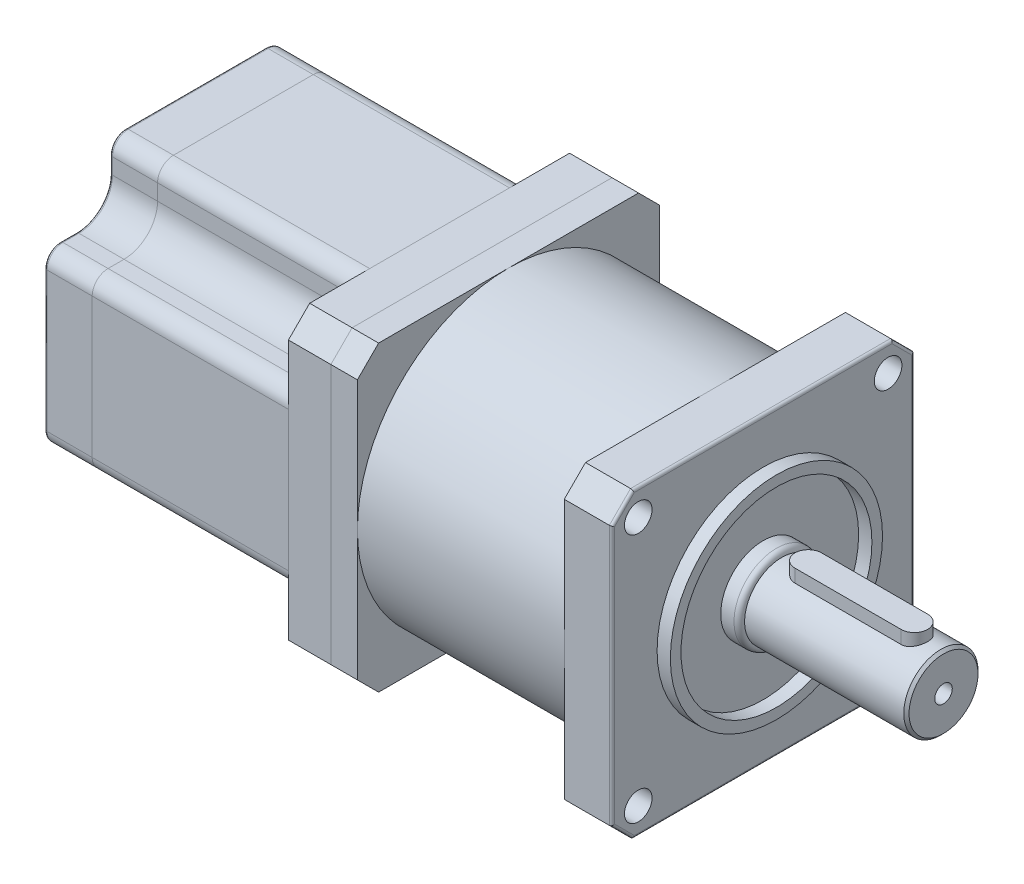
ISO-10303-21;
HEADER;
FILE_DESCRIPTION(('STEP AP214'),'2;1');
FILE_NAME('part.step','',(''),(''),'','','');
FILE_SCHEMA(('AUTOMOTIVE_DESIGN { 1 0 10303 214 1 1 1 1 }'));
ENDSEC;
DATA;
#1=APPLICATION_CONTEXT('core data for automotive mechanical design processes');
#2=APPLICATION_PROTOCOL_DEFINITION('international standard','automotive_design',2000,#1);
#3=PRODUCT_CONTEXT('',#1,'mechanical');
#4=PRODUCT('Part','Part','',(#3));
#5=PRODUCT_RELATED_PRODUCT_CATEGORY('part','',(#4));
#6=PRODUCT_DEFINITION_FORMATION('','',#4);
#7=PRODUCT_DEFINITION_CONTEXT('part definition',#1,'design');
#8=PRODUCT_DEFINITION('design','',#6,#7);
#9=PRODUCT_DEFINITION_SHAPE('','',#8);
#10=(LENGTH_UNIT() NAMED_UNIT(*) SI_UNIT(.MILLI.,.METRE.));
#11=(NAMED_UNIT(*) PLANE_ANGLE_UNIT() SI_UNIT($,.RADIAN.));
#12=(NAMED_UNIT(*) SI_UNIT($,.STERADIAN.) SOLID_ANGLE_UNIT());
#13=UNCERTAINTY_MEASURE_WITH_UNIT(LENGTH_MEASURE(1.E-05),#10,'distance_accuracy_value','');
#14=(GEOMETRIC_REPRESENTATION_CONTEXT(3) GLOBAL_UNCERTAINTY_ASSIGNED_CONTEXT((#13)) GLOBAL_UNIT_ASSIGNED_CONTEXT((#10,
#11,#12)) REPRESENTATION_CONTEXT('',''));
#15=CARTESIAN_POINT('',(0.,0.,0.));
#16=DIRECTION('',(0.,0.,1.));
#17=DIRECTION('',(1.,0.,0.));
#18=AXIS2_PLACEMENT_3D('',#15,#16,#17);
#19=CARTESIAN_POINT('',(28.5,9.,0.));
#20=DIRECTION('',(0.,-1.,0.));
#21=DIRECTION('',(0.,0.,-1.));
#22=AXIS2_PLACEMENT_3D('',#19,#20,#21);
#23=CYLINDRICAL_SURFACE('',#22,2.5);
#24=CARTESIAN_POINT('',(28.5,4.,0.));
#25=DIRECTION('',(0.,1.,0.));
#26=DIRECTION('',(0.,0.,1.));
#27=AXIS2_PLACEMENT_3D('',#24,#25,#26);
#28=CIRCLE('',#27,2.5);
#29=CARTESIAN_POINT('',(28.5,4.,2.5));
#30=VERTEX_POINT('',#29);
#31=CARTESIAN_POINT('',(28.5,4.,-2.5));
#32=VERTEX_POINT('',#31);
#33=EDGE_CURVE('E110',#30,#32,#28,.T.);
#34=ORIENTED_EDGE('',*,*,#33,.T.);
#35=DIRECTION('',(0.,-1.,0.));
#36=VECTOR('',#35,1.);
#37=CARTESIAN_POINT('',(28.5,9.,-2.5));
#38=LINE('',#37,#36);
#39=CARTESIAN_POINT('',(28.5,9.,-2.5));
#40=VERTEX_POINT('',#39);
#41=EDGE_CURVE('E12',#40,#32,#38,.T.);
#42=ORIENTED_EDGE('',*,*,#41,.F.);
#43=CARTESIAN_POINT('',(28.5,9.,0.));
#44=DIRECTION('',(0.,1.,0.));
#45=DIRECTION('',(0.,0.,1.));
#46=AXIS2_PLACEMENT_3D('',#43,#44,#45);
#47=CIRCLE('',#46,2.5);
#48=CARTESIAN_POINT('',(28.5,9.,2.5));
#49=VERTEX_POINT('',#48);
#50=EDGE_CURVE('E98',#49,#40,#47,.T.);
#51=ORIENTED_EDGE('',*,*,#50,.F.);
#52=DIRECTION('',(0.,-1.,0.));
#53=VECTOR('',#52,1.);
#54=CARTESIAN_POINT('',(28.5,9.,2.5));
#55=LINE('',#54,#53);
#56=EDGE_CURVE('E106',#49,#30,#55,.T.);
#57=ORIENTED_EDGE('',*,*,#56,.T.);
#58=EDGE_LOOP('',(#34,#42,#51,#57));
#59=FACE_BOUND('',#58,.T.);
#60=ADVANCED_FACE('F47',(#59),#23,.T.);
#61=CARTESIAN_POINT('',(28.5,9.,-2.5));
#62=DIRECTION('',(0.,0.,1.));
#63=DIRECTION('',(1.,0.,0.));
#64=AXIS2_PLACEMENT_3D('',#61,#62,#63);
#65=PLANE('',#64);
#66=DIRECTION('',(-1.,0.,0.));
#67=VECTOR('',#66,1.);
#68=CARTESIAN_POINT('',(28.5,4.,-2.5));
#69=LINE('',#68,#67);
#70=CARTESIAN_POINT('',(8.5,4.,-2.5));
#71=VERTEX_POINT('',#70);
#72=EDGE_CURVE('E102',#32,#71,#69,.T.);
#73=ORIENTED_EDGE('',*,*,#72,.T.);
#74=DIRECTION('',(0.,-1.,0.));
#75=VECTOR('',#74,1.);
#76=CARTESIAN_POINT('',(8.5,9.,-2.5));
#77=LINE('',#76,#75);
#78=CARTESIAN_POINT('',(8.5,9.,-2.5));
#79=VERTEX_POINT('',#78);
#80=EDGE_CURVE('E55',#79,#71,#77,.T.);
#81=ORIENTED_EDGE('',*,*,#80,.F.);
#82=DIRECTION('',(-1.,0.,0.));
#83=VECTOR('',#82,1.);
#84=CARTESIAN_POINT('',(28.5,9.,-2.5));
#85=LINE('',#84,#83);
#86=EDGE_CURVE('E93',#40,#79,#85,.T.);
#87=ORIENTED_EDGE('',*,*,#86,.F.);
#88=ORIENTED_EDGE('',*,*,#41,.T.);
#89=EDGE_LOOP('',(#73,#81,#87,#88));
#90=FACE_BOUND('',#89,.T.);
#91=ADVANCED_FACE('F101',(#90),#65,.F.);
#92=CARTESIAN_POINT('',(8.5,9.,0.));
#93=DIRECTION('',(0.,-1.,0.));
#94=DIRECTION('',(0.,0.,-1.));
#95=AXIS2_PLACEMENT_3D('',#92,#93,#94);
#96=CYLINDRICAL_SURFACE('',#95,2.5);
#97=CARTESIAN_POINT('',(8.5,4.,0.));
#98=DIRECTION('',(0.,1.,0.));
#99=DIRECTION('',(0.,0.,1.));
#100=AXIS2_PLACEMENT_3D('',#97,#98,#99);
#101=CIRCLE('',#100,2.5);
#102=CARTESIAN_POINT('',(8.5,4.,2.5));
#103=VERTEX_POINT('',#102);
#104=EDGE_CURVE('E80',#71,#103,#101,.T.);
#105=ORIENTED_EDGE('',*,*,#104,.T.);
#106=DIRECTION('',(0.,-1.,0.));
#107=VECTOR('',#106,1.);
#108=CARTESIAN_POINT('',(8.5,9.,2.5));
#109=LINE('',#108,#107);
#110=CARTESIAN_POINT('',(8.5,9.,2.5));
#111=VERTEX_POINT('',#110);
#112=EDGE_CURVE('E103',#111,#103,#109,.T.);
#113=ORIENTED_EDGE('',*,*,#112,.F.);
#114=CARTESIAN_POINT('',(8.5,9.,0.));
#115=DIRECTION('',(0.,1.,0.));
#116=DIRECTION('',(0.,0.,1.));
#117=AXIS2_PLACEMENT_3D('',#114,#115,#116);
#118=CIRCLE('',#117,2.5);
#119=EDGE_CURVE('E96',#79,#111,#118,.T.);
#120=ORIENTED_EDGE('',*,*,#119,.F.);
#121=ORIENTED_EDGE('',*,*,#80,.T.);
#122=EDGE_LOOP('',(#105,#113,#120,#121));
#123=FACE_BOUND('',#122,.T.);
#124=ADVANCED_FACE('F104',(#123),#96,.T.);
#125=CARTESIAN_POINT('',(8.5,9.,2.5));
#126=DIRECTION('',(0.,0.,-1.));
#127=DIRECTION('',(-1.,0.,0.));
#128=AXIS2_PLACEMENT_3D('',#125,#126,#127);
#129=PLANE('',#128);
#130=DIRECTION('',(1.,0.,0.));
#131=VECTOR('',#130,1.);
#132=CARTESIAN_POINT('',(8.5,4.,2.5));
#133=LINE('',#132,#131);
#134=EDGE_CURVE('E86',#103,#30,#133,.T.);
#135=ORIENTED_EDGE('',*,*,#134,.T.);
#136=ORIENTED_EDGE('',*,*,#56,.F.);
#137=DIRECTION('',(1.,0.,0.));
#138=VECTOR('',#137,1.);
#139=CARTESIAN_POINT('',(8.5,9.,2.5));
#140=LINE('',#139,#138);
#141=EDGE_CURVE('E63',#111,#49,#140,.T.);
#142=ORIENTED_EDGE('',*,*,#141,.F.);
#143=ORIENTED_EDGE('',*,*,#112,.T.);
#144=EDGE_LOOP('',(#135,#136,#142,#143));
#145=FACE_BOUND('',#144,.T.);
#146=ADVANCED_FACE('F117',(#145),#129,.F.);
#147=CARTESIAN_POINT('',(28.5,9.,0.));
#148=DIRECTION('',(0.,1.,0.));
#149=DIRECTION('',(0.,0.,1.));
#150=AXIS2_PLACEMENT_3D('',#147,#148,#149);
#151=PLANE('',#150);
#152=ORIENTED_EDGE('',*,*,#50,.T.);
#153=ORIENTED_EDGE('',*,*,#86,.T.);
#154=ORIENTED_EDGE('',*,*,#119,.T.);
#155=ORIENTED_EDGE('',*,*,#141,.T.);
#156=EDGE_LOOP('',(#152,#153,#154,#155));
#157=FACE_BOUND('',#156,.T.);
#158=ADVANCED_FACE('F94',(#157),#151,.T.);
#159=CARTESIAN_POINT('',(28.5,4.,0.));
#160=DIRECTION('',(0.,1.,0.));
#161=DIRECTION('',(0.,0.,1.));
#162=AXIS2_PLACEMENT_3D('',#159,#160,#161);
#163=PLANE('',#162);
#164=ORIENTED_EDGE('',*,*,#33,.F.);
#165=ORIENTED_EDGE('',*,*,#134,.F.);
#166=ORIENTED_EDGE('',*,*,#104,.F.);
#167=ORIENTED_EDGE('',*,*,#72,.F.);
#168=EDGE_LOOP('',(#164,#165,#166,#167));
#169=FACE_BOUND('',#168,.T.);
#170=ADVANCED_FACE('F120',(#169),#163,.F.);
#171=CLOSED_SHELL('',(#60,#91,#124,#146,#158,#170));
#172=MANIFOLD_SOLID_BREP('B2',#171);
#173=CARTESIAN_POINT('',(34.,0.,0.));
#174=DIRECTION('',(-1.,0.,0.));
#175=DIRECTION('',(0.,0.,1.));
#176=AXIS2_PLACEMENT_3D('',#173,#174,#175);
#177=CYLINDRICAL_SURFACE('',#176,7.);
#178=CARTESIAN_POINT('',(33.5,0.,0.));
#179=DIRECTION('',(1.,0.,0.));
#180=DIRECTION('',(0.,0.,-1.));
#181=AXIS2_PLACEMENT_3D('',#178,#179,#180);
#182=CIRCLE('',#181,7.);
#183=CARTESIAN_POINT('',(33.5,0.,-7.));
#184=VERTEX_POINT('',#183);
#185=EDGE_CURVE('E45',#184,#184,#182,.F.);
#186=ORIENTED_EDGE('',*,*,#185,.T.);
#187=EDGE_LOOP('',(#186));
#188=FACE_BOUND('',#187,.T.);
#189=DIRECTION('',(-1.,0.,0.));
#190=VECTOR('',#189,1.);
#191=CARTESIAN_POINT('',(34.,6.53834841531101,-2.5));
#192=LINE('',#191,#190);
#193=CARTESIAN_POINT('',(8.5,6.53834841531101,-2.5));
#194=VERTEX_POINT('',#193);
#195=CARTESIAN_POINT('',(28.5,6.53834841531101,-2.5));
#196=VERTEX_POINT('',#195);
#197=EDGE_CURVE('E203',#194,#196,#192,.F.);
#198=ORIENTED_EDGE('',*,*,#197,.T.);
#199=CARTESIAN_POINT('',(28.5,6.53834841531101,-2.5));
#200=CARTESIAN_POINT('',(28.5678892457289,6.53833653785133,-2.50000932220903));
#201=CARTESIAN_POINT('',(28.6357719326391,6.53940549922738,-2.49723485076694));
#202=CARTESIAN_POINT('',(28.7710039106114,6.54361657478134,-2.4861910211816));
#203=CARTESIAN_POINT('',(28.8383533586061,6.54675805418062,-2.47792334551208));
#204=CARTESIAN_POINT('',(28.9718214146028,6.55501217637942,-2.45600175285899));
#205=CARTESIAN_POINT('',(29.0379433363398,6.56011831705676,-2.44236559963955));
#206=CARTESIAN_POINT('',(29.1687018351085,6.57213177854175,-2.40985115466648));
#207=CARTESIAN_POINT('',(29.2333383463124,6.57903917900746,-2.39097263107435));
#208=CARTESIAN_POINT('',(29.4242643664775,6.6021493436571,-2.32673964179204));
#209=CARTESIAN_POINT('',(29.5477904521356,6.62075475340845,-2.27375112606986));
#210=CARTESIAN_POINT('',(29.784230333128,6.6622539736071,-2.14910757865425));
#211=CARTESIAN_POINT('',(29.8971363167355,6.68515090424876,-2.07743895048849));
#212=CARTESIAN_POINT('',(30.1142152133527,6.73379913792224,-1.91402571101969));
#213=CARTESIAN_POINT('',(30.2178464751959,6.75962864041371,-1.82158337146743));
#214=CARTESIAN_POINT('',(30.4085087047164,6.81057592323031,-1.6207338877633));
#215=CARTESIAN_POINT('',(30.4955365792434,6.83569357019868,-1.51232377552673));
#216=CARTESIAN_POINT('',(30.653089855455,6.88331133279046,-1.27853915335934));
#217=CARTESIAN_POINT('',(30.7230315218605,6.90570835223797,-1.15274833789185));
#218=CARTESIAN_POINT('',(30.8405366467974,6.94442357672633,-0.890250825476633));
#219=CARTESIAN_POINT('',(30.888107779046,6.96074386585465,-0.753547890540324));
#220=CARTESIAN_POINT('',(30.9576406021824,6.9849105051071,-0.478829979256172));
#221=CARTESIAN_POINT('',(30.9805391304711,6.99306594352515,-0.341079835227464));
#222=CARTESIAN_POINT('',(31.0030684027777,7.00108798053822,-0.0634643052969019));
#223=CARTESIAN_POINT('',(31.0027055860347,7.00095687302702,0.0764004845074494));
#224=CARTESIAN_POINT('',(30.9792887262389,6.99262258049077,0.347593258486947));
#225=CARTESIAN_POINT('',(30.9572552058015,6.98478243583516,0.479022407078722));
#226=CARTESIAN_POINT('',(30.8928265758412,6.96237832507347,0.736175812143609));
#227=CARTESIAN_POINT('',(30.8504303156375,6.94781397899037,0.861899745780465));
#228=CARTESIAN_POINT('',(30.7459530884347,6.91316506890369,1.10616102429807));
#229=CARTESIAN_POINT('',(30.6836042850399,6.89300592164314,1.22457279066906));
#230=CARTESIAN_POINT('',(30.5412206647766,6.8492335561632,1.44953531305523));
#231=CARTESIAN_POINT('',(30.4611804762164,6.82561928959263,1.5560824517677));
#232=CARTESIAN_POINT('',(30.2806767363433,6.7759054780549,1.7603244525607));
#233=CARTESIAN_POINT('',(30.1793502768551,6.74974055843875,1.85724185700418));
#234=CARTESIAN_POINT('',(29.9616726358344,6.69890342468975,2.03299914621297));
#235=CARTESIAN_POINT('',(29.8453160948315,6.67423174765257,2.11183255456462));
#236=CARTESIAN_POINT('',(29.598057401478,6.62877803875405,2.25049860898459));
#237=CARTESIAN_POINT('',(29.4669210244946,6.60807875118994,2.30994207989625));
#238=CARTESIAN_POINT('',(29.1956351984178,6.57388213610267,2.4055543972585));
#239=CARTESIAN_POINT('',(29.055500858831,6.56037307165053,2.44176119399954));
#240=CARTESIAN_POINT('',(28.8449694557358,6.54708542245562,2.47705497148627));
#241=CARTESIAN_POINT('',(28.7762636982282,6.54382010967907,2.48565347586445));
#242=CARTESIAN_POINT('',(28.6383848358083,6.53944910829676,2.49712352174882));
#243=CARTESIAN_POINT('',(28.5692123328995,6.53834103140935,2.50000139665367));
#244=CARTESIAN_POINT('',(28.5,6.53834841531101,2.5));
#245=B_SPLINE_CURVE_WITH_KNOTS('',3,(#199,#200,#201,#202,#203,#204,#205,#206,#207,#208,#209,
#210,#211,#212,#213,#214,#215,#216,#217,#218,#219,#220,#221,#222,#223,#224,#225,#226,#227,#228,
#229,#230,#231,#232,#233,#234,#235,#236,#237,#238,#239,#240,#241,#242,#243,#244),.UNSPECIFIED.,
.F.,.F.,(4,2,2,2,2,2,2,2,2,2,2,2,2,2,2,2,2,2,2,2,2,2,4),(0.,0.203591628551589,0.407120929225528,
0.609982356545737,0.812852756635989,1.21793118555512,1.6233052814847,2.0451597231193,
2.4670926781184,2.90188398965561,3.33652604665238,3.75400993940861,4.17137826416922,
4.56998920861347,4.96862268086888,5.37284909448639,5.77719841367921,6.20315837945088,
6.6292706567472,7.06347329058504,7.49696496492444,7.70468580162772,7.91217653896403),.UNSPECIFIED.);
#246=CARTESIAN_POINT('',(28.5,6.53834841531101,2.5));
#247=VERTEX_POINT('',#246);
#248=EDGE_CURVE('E261',#196,#247,#245,.T.);
#249=ORIENTED_EDGE('',*,*,#248,.T.);
#250=DIRECTION('',(-1.,0.,0.));
#251=VECTOR('',#250,1.);
#252=CARTESIAN_POINT('',(34.,6.53834841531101,2.5));
#253=LINE('',#252,#251);
#254=CARTESIAN_POINT('',(8.5,6.53834841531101,2.5));
#255=VERTEX_POINT('',#254);
#256=EDGE_CURVE('E308',#247,#255,#253,.T.);
#257=ORIENTED_EDGE('',*,*,#256,.T.);
#258=CARTESIAN_POINT('',(8.5,6.53834841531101,2.5));
#259=CARTESIAN_POINT('',(8.43211075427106,6.53833653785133,2.50000932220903));
#260=CARTESIAN_POINT('',(8.36422806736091,6.53940549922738,2.49723485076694));
#261=CARTESIAN_POINT('',(8.22899608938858,6.54361657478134,2.4861910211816));
#262=CARTESIAN_POINT('',(8.16164664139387,6.54675805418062,2.47792334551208));
#263=CARTESIAN_POINT('',(8.02817858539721,6.55501217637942,2.456001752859));
#264=CARTESIAN_POINT('',(7.96205666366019,6.56011831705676,2.44236559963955));
#265=CARTESIAN_POINT('',(7.83129816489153,6.57213177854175,2.40985115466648));
#266=CARTESIAN_POINT('',(7.76666165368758,6.57903917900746,2.39097263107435));
#267=CARTESIAN_POINT('',(7.57573563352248,6.6021493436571,2.32673964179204));
#268=CARTESIAN_POINT('',(7.45220954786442,6.62075475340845,2.27375112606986));
#269=CARTESIAN_POINT('',(7.21576966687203,6.6622539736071,2.14910757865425));
#270=CARTESIAN_POINT('',(7.10286368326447,6.68515090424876,2.07743895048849));
#271=CARTESIAN_POINT('',(6.88578478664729,6.73379913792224,1.9140257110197));
#272=CARTESIAN_POINT('',(6.78215352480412,6.75962864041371,1.82158337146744));
#273=CARTESIAN_POINT('',(6.59149129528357,6.81057592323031,1.6207338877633));
#274=CARTESIAN_POINT('',(6.50446342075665,6.83569357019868,1.51232377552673));
#275=CARTESIAN_POINT('',(6.34691014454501,6.88331133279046,1.27853915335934));
#276=CARTESIAN_POINT('',(6.27696847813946,6.90570835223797,1.15274833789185));
#277=CARTESIAN_POINT('',(6.15946335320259,6.94442357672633,0.890250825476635));
#278=CARTESIAN_POINT('',(6.11189222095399,6.96074386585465,0.753547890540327));
#279=CARTESIAN_POINT('',(6.04235939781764,6.9849105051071,0.478829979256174));
#280=CARTESIAN_POINT('',(6.01946086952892,6.99306594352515,0.341079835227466));
#281=CARTESIAN_POINT('',(5.99693159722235,7.00108798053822,0.0634643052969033));
#282=CARTESIAN_POINT('',(5.99729441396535,7.00095687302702,-0.0764004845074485));
#283=CARTESIAN_POINT('',(6.02071127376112,6.99262258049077,-0.347593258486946));
#284=CARTESIAN_POINT('',(6.04274479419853,6.98478243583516,-0.479022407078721));
#285=CARTESIAN_POINT('',(6.1071734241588,6.96237832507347,-0.736175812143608));
#286=CARTESIAN_POINT('',(6.14956968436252,6.94781397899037,-0.861899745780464));
#287=CARTESIAN_POINT('',(6.25404691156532,6.91316506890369,-1.10616102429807));
#288=CARTESIAN_POINT('',(6.31639571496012,6.89300592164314,-1.22457279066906));
#289=CARTESIAN_POINT('',(6.45877933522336,6.8492335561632,-1.44953531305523));
#290=CARTESIAN_POINT('',(6.53881952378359,6.82561928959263,-1.5560824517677));
#291=CARTESIAN_POINT('',(6.7193232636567,6.7759054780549,-1.7603244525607));
#292=CARTESIAN_POINT('',(6.8206497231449,6.74974055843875,-1.85724185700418));
#293=CARTESIAN_POINT('',(7.03832736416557,6.69890342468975,-2.03299914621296));
#294=CARTESIAN_POINT('',(7.15468390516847,6.67423174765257,-2.11183255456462));
#295=CARTESIAN_POINT('',(7.40194259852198,6.62877803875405,-2.25049860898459));
#296=CARTESIAN_POINT('',(7.53307897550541,6.60807875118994,-2.30994207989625));
#297=CARTESIAN_POINT('',(7.80436480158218,6.57388213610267,-2.4055543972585));
#298=CARTESIAN_POINT('',(7.94449914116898,6.56037307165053,-2.44176119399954));
#299=CARTESIAN_POINT('',(8.15503054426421,6.54708542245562,-2.47705497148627));
#300=CARTESIAN_POINT('',(8.22373630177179,6.54382010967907,-2.48565347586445));
#301=CARTESIAN_POINT('',(8.36161516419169,6.53944910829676,-2.49712352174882));
#302=CARTESIAN_POINT('',(8.43078766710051,6.53834103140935,-2.50000139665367));
#303=CARTESIAN_POINT('',(8.5,6.53834841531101,-2.5));
#304=B_SPLINE_CURVE_WITH_KNOTS('',3,(#258,#259,#260,#261,#262,#263,#264,#265,#266,#267,#268,
#269,#270,#271,#272,#273,#274,#275,#276,#277,#278,#279,#280,#281,#282,#283,#284,#285,#286,#287,
#288,#289,#290,#291,#292,#293,#294,#295,#296,#297,#298,#299,#300,#301,#302,#303),.UNSPECIFIED.,
.F.,.F.,(4,2,2,2,2,2,2,2,2,2,2,2,2,2,2,2,2,2,2,2,2,2,4),(0.,0.203591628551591,0.40712092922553,
0.609982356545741,0.812852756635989,1.21793118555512,1.6233052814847,2.0451597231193,
2.4670926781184,2.90188398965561,3.33652604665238,3.75400993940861,4.17137826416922,
4.56998920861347,4.96862268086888,5.37284909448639,5.77719841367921,6.20315837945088,
6.62927065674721,7.06347329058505,7.49696496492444,7.70468580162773,7.91217653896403),.UNSPECIFIED.);
#305=EDGE_CURVE('E195',#255,#194,#304,.T.);
#306=ORIENTED_EDGE('',*,*,#305,.T.);
#307=EDGE_LOOP('',(#198,#249,#257,#306));
#308=FACE_BOUND('',#307,.T.);
#309=CARTESIAN_POINT('',(3.5,0.,0.));
#310=DIRECTION('',(1.,0.,0.));
#311=DIRECTION('',(0.,0.,-1.));
#312=AXIS2_PLACEMENT_3D('',#309,#310,#311);
#313=CIRCLE('',#312,7.);
#314=CARTESIAN_POINT('',(3.5,0.,-7.));
#315=VERTEX_POINT('',#314);
#316=EDGE_CURVE('E252',#315,#315,#313,.T.);
#317=ORIENTED_EDGE('',*,*,#316,.T.);
#318=EDGE_LOOP('',(#317));
#319=FACE_BOUND('',#318,.T.);
#320=ADVANCED_FACE('F180',(#188,#308,#319),#177,.T.);
#321=CARTESIAN_POINT('',(34.,0.,0.));
#322=DIRECTION('',(1.,0.,0.));
#323=DIRECTION('',(0.,0.,-1.));
#324=AXIS2_PLACEMENT_3D('',#321,#322,#323);
#325=PLANE('',#324);
#326=CARTESIAN_POINT('',(34.,0.,0.));
#327=DIRECTION('',(1.,0.,0.));
#328=DIRECTION('',(0.,0.,-1.));
#329=AXIS2_PLACEMENT_3D('',#326,#327,#328);
#330=CIRCLE('',#329,1.64999999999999);
#331=CARTESIAN_POINT('',(34.,0.,-1.64999999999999));
#332=VERTEX_POINT('',#331);
#333=EDGE_CURVE('E233',#332,#332,#330,.T.);
#334=ORIENTED_EDGE('',*,*,#333,.F.);
#335=EDGE_LOOP('',(#334));
#336=FACE_BOUND('',#335,.T.);
#337=CARTESIAN_POINT('',(34.,0.,0.));
#338=DIRECTION('',(1.,0.,0.));
#339=DIRECTION('',(0.,0.,-1.));
#340=AXIS2_PLACEMENT_3D('',#337,#338,#339);
#341=CIRCLE('',#340,6.50000000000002);
#342=CARTESIAN_POINT('',(34.,0.,-6.50000000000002));
#343=VERTEX_POINT('',#342);
#344=EDGE_CURVE('E188',#343,#343,#341,.T.);
#345=ORIENTED_EDGE('',*,*,#344,.T.);
#346=EDGE_LOOP('',(#345));
#347=FACE_BOUND('',#346,.T.);
#348=ADVANCED_FACE('F292',(#336,#347),#325,.T.);
#349=CARTESIAN_POINT('',(3.5,0.,0.));
#350=DIRECTION('',(1.,0.,0.));
#351=DIRECTION('',(0.,0.,-1.));
#352=AXIS2_PLACEMENT_3D('',#349,#350,#351);
#353=PLANE('',#352);
#354=ORIENTED_EDGE('',*,*,#316,.F.);
#355=EDGE_LOOP('',(#354));
#356=FACE_BOUND('',#355,.T.);
#357=ADVANCED_FACE('F291',(#356),#353,.F.);
#358=CARTESIAN_POINT('',(8.5,4.,0.));
#359=DIRECTION('',(0.,1.,0.));
#360=DIRECTION('',(0.,0.,1.));
#361=AXIS2_PLACEMENT_3D('',#358,#359,#360);
#362=CYLINDRICAL_SURFACE('',#361,2.5);
#363=DIRECTION('',(0.,1.,0.));
#364=VECTOR('',#363,1.);
#365=CARTESIAN_POINT('',(8.5,4.,2.5));
#366=LINE('',#365,#364);
#367=CARTESIAN_POINT('',(8.5,4.,2.5));
#368=VERTEX_POINT('',#367);
#369=EDGE_CURVE('E249',#368,#255,#366,.T.);
#370=ORIENTED_EDGE('',*,*,#369,.F.);
#371=CARTESIAN_POINT('',(8.5,4.,0.));
#372=DIRECTION('',(0.,1.,0.));
#373=DIRECTION('',(0.,0.,1.));
#374=AXIS2_PLACEMENT_3D('',#371,#372,#373);
#375=CIRCLE('',#374,2.5);
#376=CARTESIAN_POINT('',(8.5,4.,-2.5));
#377=VERTEX_POINT('',#376);
#378=EDGE_CURVE('E232',#377,#368,#375,.T.);
#379=ORIENTED_EDGE('',*,*,#378,.F.);
#380=DIRECTION('',(0.,1.,0.));
#381=VECTOR('',#380,1.);
#382=CARTESIAN_POINT('',(8.5,4.,-2.5));
#383=LINE('',#382,#381);
#384=EDGE_CURVE('E250',#377,#194,#383,.T.);
#385=ORIENTED_EDGE('',*,*,#384,.T.);
#386=ORIENTED_EDGE('',*,*,#305,.F.);
#387=EDGE_LOOP('',(#370,#379,#385,#386));
#388=FACE_BOUND('',#387,.T.);
#389=ADVANCED_FACE('F287',(#388),#362,.F.);
#390=CARTESIAN_POINT('',(8.5,4.,-2.5));
#391=DIRECTION('',(0.,0.,-1.));
#392=DIRECTION('',(-1.,0.,0.));
#393=AXIS2_PLACEMENT_3D('',#390,#391,#392);
#394=PLANE('',#393);
#395=ORIENTED_EDGE('',*,*,#384,.F.);
#396=DIRECTION('',(-1.,0.,0.));
#397=VECTOR('',#396,1.);
#398=CARTESIAN_POINT('',(8.5,4.,-2.5));
#399=LINE('',#398,#397);
#400=CARTESIAN_POINT('',(28.5,4.,-2.5));
#401=VERTEX_POINT('',#400);
#402=EDGE_CURVE('E246',#401,#377,#399,.T.);
#403=ORIENTED_EDGE('',*,*,#402,.F.);
#404=DIRECTION('',(0.,1.,0.));
#405=VECTOR('',#404,1.);
#406=CARTESIAN_POINT('',(28.5,4.,-2.5));
#407=LINE('',#406,#405);
#408=EDGE_CURVE('E253',#401,#196,#407,.T.);
#409=ORIENTED_EDGE('',*,*,#408,.T.);
#410=ORIENTED_EDGE('',*,*,#197,.F.);
#411=EDGE_LOOP('',(#395,#403,#409,#410));
#412=FACE_BOUND('',#411,.T.);
#413=ADVANCED_FACE('F281',(#412),#394,.F.);
#414=CARTESIAN_POINT('',(28.5,4.,0.));
#415=DIRECTION('',(0.,1.,0.));
#416=DIRECTION('',(0.,0.,1.));
#417=AXIS2_PLACEMENT_3D('',#414,#415,#416);
#418=CYLINDRICAL_SURFACE('',#417,2.5);
#419=ORIENTED_EDGE('',*,*,#408,.F.);
#420=CARTESIAN_POINT('',(28.5,4.,0.));
#421=DIRECTION('',(0.,1.,0.));
#422=DIRECTION('',(0.,0.,1.));
#423=AXIS2_PLACEMENT_3D('',#420,#421,#422);
#424=CIRCLE('',#423,2.5);
#425=CARTESIAN_POINT('',(28.5,4.,2.5));
#426=VERTEX_POINT('',#425);
#427=EDGE_CURVE('E243',#426,#401,#424,.T.);
#428=ORIENTED_EDGE('',*,*,#427,.F.);
#429=DIRECTION('',(0.,1.,0.));
#430=VECTOR('',#429,1.);
#431=CARTESIAN_POINT('',(28.5,4.,2.5));
#432=LINE('',#431,#430);
#433=EDGE_CURVE('E255',#426,#247,#432,.T.);
#434=ORIENTED_EDGE('',*,*,#433,.T.);
#435=ORIENTED_EDGE('',*,*,#248,.F.);
#436=EDGE_LOOP('',(#419,#428,#434,#435));
#437=FACE_BOUND('',#436,.T.);
#438=ADVANCED_FACE('F275',(#437),#418,.F.);
#439=CARTESIAN_POINT('',(28.5,4.,2.5));
#440=DIRECTION('',(0.,0.,1.));
#441=DIRECTION('',(1.,0.,0.));
#442=AXIS2_PLACEMENT_3D('',#439,#440,#441);
#443=PLANE('',#442);
#444=ORIENTED_EDGE('',*,*,#433,.F.);
#445=DIRECTION('',(1.,0.,0.));
#446=VECTOR('',#445,1.);
#447=CARTESIAN_POINT('',(28.5,4.,2.5));
#448=LINE('',#447,#446);
#449=EDGE_CURVE('E236',#368,#426,#448,.T.);
#450=ORIENTED_EDGE('',*,*,#449,.F.);
#451=ORIENTED_EDGE('',*,*,#369,.T.);
#452=ORIENTED_EDGE('',*,*,#256,.F.);
#453=EDGE_LOOP('',(#444,#450,#451,#452));
#454=FACE_BOUND('',#453,.T.);
#455=ADVANCED_FACE('F280',(#454),#443,.F.);
#456=CARTESIAN_POINT('',(8.5,4.,0.));
#457=DIRECTION('',(0.,1.,0.));
#458=DIRECTION('',(0.,0.,1.));
#459=AXIS2_PLACEMENT_3D('',#456,#457,#458);
#460=PLANE('',#459);
#461=ORIENTED_EDGE('',*,*,#378,.T.);
#462=ORIENTED_EDGE('',*,*,#449,.T.);
#463=ORIENTED_EDGE('',*,*,#427,.T.);
#464=ORIENTED_EDGE('',*,*,#402,.T.);
#465=EDGE_LOOP('',(#461,#462,#463,#464));
#466=FACE_BOUND('',#465,.T.);
#467=ADVANCED_FACE('F285',(#466),#460,.T.);
#468=CARTESIAN_POINT('',(34.,0.,0.));
#469=DIRECTION('',(-1.,0.,0.));
#470=DIRECTION('',(0.,0.,1.));
#471=AXIS2_PLACEMENT_3D('',#468,#469,#470);
#472=CONICAL_SURFACE('',#471,6.50000000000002,0.785398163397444);
#473=ORIENTED_EDGE('',*,*,#185,.F.);
#474=EDGE_LOOP('',(#473));
#475=FACE_BOUND('',#474,.T.);
#476=ORIENTED_EDGE('',*,*,#344,.F.);
#477=EDGE_LOOP('',(#476));
#478=FACE_BOUND('',#477,.T.);
#479=ADVANCED_FACE('F182',(#475,#478),#472,.T.);
#480=CARTESIAN_POINT('',(24.5,0.,0.));
#481=DIRECTION('',(1.,0.,0.));
#482=DIRECTION('',(0.,0.,-1.));
#483=AXIS2_PLACEMENT_3D('',#480,#481,#482);
#484=CONICAL_SURFACE('',#483,1.65,1.02974425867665);
#485=CARTESIAN_POINT('',(23.5085799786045,0.,0.));
#486=VERTEX_POINT('',#485);
#487=VERTEX_LOOP('',#486);
#488=FACE_BOUND('',#487,.T.);
#489=CARTESIAN_POINT('',(24.5,0.,0.));
#490=DIRECTION('',(1.,0.,0.));
#491=DIRECTION('',(0.,0.,-1.));
#492=AXIS2_PLACEMENT_3D('',#489,#490,#491);
#493=CIRCLE('',#492,1.65);
#494=CARTESIAN_POINT('',(24.5,0.,-1.65));
#495=VERTEX_POINT('',#494);
#496=EDGE_CURVE('E230',#495,#495,#493,.T.);
#497=ORIENTED_EDGE('',*,*,#496,.T.);
#498=EDGE_LOOP('',(#497));
#499=FACE_BOUND('',#498,.T.);
#500=ADVANCED_FACE('F223',(#488,#499),#484,.F.);
#501=CARTESIAN_POINT('',(34.,0.,0.));
#502=DIRECTION('',(1.,0.,0.));
#503=DIRECTION('',(0.,0.,-1.));
#504=AXIS2_PLACEMENT_3D('',#501,#502,#503);
#505=CYLINDRICAL_SURFACE('',#504,1.64999999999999);
#506=ORIENTED_EDGE('',*,*,#496,.F.);
#507=EDGE_LOOP('',(#506));
#508=FACE_BOUND('',#507,.T.);
#509=ORIENTED_EDGE('',*,*,#333,.T.);
#510=EDGE_LOOP('',(#509));
#511=FACE_BOUND('',#510,.T.);
#512=ADVANCED_FACE('F226',(#508,#511),#505,.F.);
#513=CLOSED_SHELL('',(#320,#348,#357,#389,#413,#438,#455,#467,#479,#500,#512));
#514=MANIFOLD_SOLID_BREP('B6',#513);
#515=CARTESIAN_POINT('',(-107.,-24.5,-28.5));
#516=DIRECTION('',(0.,0.,1.));
#517=DIRECTION('',(1.,0.,0.));
#518=AXIS2_PLACEMENT_3D('',#515,#516,#517);
#519=PLANE('',#518);
#520=DIRECTION('',(-1.,0.,0.));
#521=VECTOR('',#520,1.);
#522=CARTESIAN_POINT('',(-61.,-13.1754446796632,-28.5));
#523=LINE('',#522,#521);
#524=CARTESIAN_POINT('',(-98.,-13.1754446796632,-28.5));
#525=VERTEX_POINT('',#524);
#526=CARTESIAN_POINT('',(-106.5,-13.1754446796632,-28.5));
#527=VERTEX_POINT('',#526);
#528=EDGE_CURVE('E905',#525,#527,#523,.T.);
#529=ORIENTED_EDGE('',*,*,#528,.T.);
#530=DIRECTION('',(0.,-1.,0.));
#531=VECTOR('',#530,1.);
#532=CARTESIAN_POINT('',(-106.5,13.1754446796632,-28.5));
#533=LINE('',#532,#531);
#534=CARTESIAN_POINT('',(-106.5,13.1754446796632,-28.5));
#535=VERTEX_POINT('',#534);
#536=EDGE_CURVE('E804',#527,#535,#533,.F.);
#537=ORIENTED_EDGE('',*,*,#536,.T.);
#538=DIRECTION('',(-1.,0.,0.));
#539=VECTOR('',#538,1.);
#540=CARTESIAN_POINT('',(-61.,13.1754446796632,-28.5));
#541=LINE('',#540,#539);
#542=CARTESIAN_POINT('',(-98.,13.1754446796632,-28.5));
#543=VERTEX_POINT('',#542);
#544=EDGE_CURVE('E977',#543,#535,#541,.T.);
#545=ORIENTED_EDGE('',*,*,#544,.F.);
#546=DIRECTION('',(0.,-1.,0.));
#547=VECTOR('',#546,1.);
#548=CARTESIAN_POINT('',(-98.,-24.5,-28.5));
#549=LINE('',#548,#547);
#550=EDGE_CURVE('E947',#543,#525,#549,.T.);
#551=ORIENTED_EDGE('',*,*,#550,.T.);
#552=EDGE_LOOP('',(#529,#537,#545,#551));
#553=FACE_BOUND('',#552,.T.);
#554=ADVANCED_FACE('F406',(#553),#519,.F.);
#555=CARTESIAN_POINT('',(-107.,-28.5,-24.5));
#556=DIRECTION('',(0.,1.,0.));
#557=DIRECTION('',(0.,0.,1.));
#558=AXIS2_PLACEMENT_3D('',#555,#556,#557);
#559=PLANE('',#558);
#560=DIRECTION('',(-1.,0.,0.));
#561=VECTOR('',#560,1.);
#562=CARTESIAN_POINT('',(-61.,-28.5,13.1754446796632));
#563=LINE('',#562,#561);
#564=CARTESIAN_POINT('',(-98.,-28.5,13.1754446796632));
#565=VERTEX_POINT('',#564);
#566=CARTESIAN_POINT('',(-106.5,-28.5,13.1754446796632));
#567=VERTEX_POINT('',#566);
#568=EDGE_CURVE('E899',#565,#567,#563,.T.);
#569=ORIENTED_EDGE('',*,*,#568,.T.);
#570=DIRECTION('',(0.,0.,1.));
#571=VECTOR('',#570,1.);
#572=CARTESIAN_POINT('',(-106.5,-28.5,-13.1754446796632));
#573=LINE('',#572,#571);
#574=CARTESIAN_POINT('',(-106.5,-28.5,-13.1754446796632));
#575=VERTEX_POINT('',#574);
#576=EDGE_CURVE('E792',#567,#575,#573,.F.);
#577=ORIENTED_EDGE('',*,*,#576,.T.);
#578=DIRECTION('',(-1.,0.,0.));
#579=VECTOR('',#578,1.);
#580=CARTESIAN_POINT('',(-61.,-28.5,-13.1754446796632));
#581=LINE('',#580,#579);
#582=CARTESIAN_POINT('',(-98.,-28.5,-13.1754446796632));
#583=VERTEX_POINT('',#582);
#584=EDGE_CURVE('E897',#583,#575,#581,.T.);
#585=ORIENTED_EDGE('',*,*,#584,.F.);
#586=DIRECTION('',(0.,0.,1.));
#587=VECTOR('',#586,1.);
#588=CARTESIAN_POINT('',(-98.,-28.5,-24.5));
#589=LINE('',#588,#587);
#590=EDGE_CURVE('E950',#583,#565,#589,.T.);
#591=ORIENTED_EDGE('',*,*,#590,.T.);
#592=EDGE_LOOP('',(#569,#577,#585,#591));
#593=FACE_BOUND('',#592,.T.);
#594=ADVANCED_FACE('F895',(#593),#559,.F.);
#595=CARTESIAN_POINT('',(-107.,-24.5,28.5));
#596=DIRECTION('',(0.,0.,-1.));
#597=DIRECTION('',(0.,1.,0.));
#598=AXIS2_PLACEMENT_3D('',#595,#596,#597);
#599=PLANE('',#598);
#600=DIRECTION('',(-1.,0.,0.));
#601=VECTOR('',#600,1.);
#602=CARTESIAN_POINT('',(-61.,13.1754446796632,28.5));
#603=LINE('',#602,#601);
#604=CARTESIAN_POINT('',(-98.,13.1754446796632,28.5));
#605=VERTEX_POINT('',#604);
#606=CARTESIAN_POINT('',(-106.5,13.1754446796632,28.5));
#607=VERTEX_POINT('',#606);
#608=EDGE_CURVE('E943',#605,#607,#603,.T.);
#609=ORIENTED_EDGE('',*,*,#608,.T.);
#610=DIRECTION('',(0.,1.,0.));
#611=VECTOR('',#610,1.);
#612=CARTESIAN_POINT('',(-106.5,-13.1754446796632,28.5));
#613=LINE('',#612,#611);
#614=CARTESIAN_POINT('',(-106.5,-13.1754446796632,28.5));
#615=VERTEX_POINT('',#614);
#616=EDGE_CURVE('E780',#607,#615,#613,.F.);
#617=ORIENTED_EDGE('',*,*,#616,.T.);
#618=DIRECTION('',(-1.,0.,0.));
#619=VECTOR('',#618,1.);
#620=CARTESIAN_POINT('',(-61.,-13.1754446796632,28.5));
#621=LINE('',#620,#619);
#622=CARTESIAN_POINT('',(-98.,-13.1754446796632,28.5));
#623=VERTEX_POINT('',#622);
#624=EDGE_CURVE('E925',#623,#615,#621,.T.);
#625=ORIENTED_EDGE('',*,*,#624,.F.);
#626=DIRECTION('',(0.,1.,0.));
#627=VECTOR('',#626,1.);
#628=CARTESIAN_POINT('',(-98.,-24.5,28.5));
#629=LINE('',#628,#627);
#630=EDGE_CURVE('E953',#623,#605,#629,.T.);
#631=ORIENTED_EDGE('',*,*,#630,.T.);
#632=EDGE_LOOP('',(#609,#617,#625,#631));
#633=FACE_BOUND('',#632,.T.);
#634=ADVANCED_FACE('F1091',(#633),#599,.F.);
#635=CARTESIAN_POINT('',(-107.,28.5,-24.5));
#636=DIRECTION('',(0.,-1.,0.));
#637=DIRECTION('',(0.,0.,-1.));
#638=AXIS2_PLACEMENT_3D('',#635,#636,#637);
#639=PLANE('',#638);
#640=DIRECTION('',(-1.,0.,0.));
#641=VECTOR('',#640,1.);
#642=CARTESIAN_POINT('',(-61.,28.5,-13.1754446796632));
#643=LINE('',#642,#641);
#644=CARTESIAN_POINT('',(-98.,28.5,-13.1754446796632));
#645=VERTEX_POINT('',#644);
#646=CARTESIAN_POINT('',(-106.5,28.5,-13.1754446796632));
#647=VERTEX_POINT('',#646);
#648=EDGE_CURVE('E962',#645,#647,#643,.T.);
#649=ORIENTED_EDGE('',*,*,#648,.T.);
#650=DIRECTION('',(0.,0.,-1.));
#651=VECTOR('',#650,1.);
#652=CARTESIAN_POINT('',(-106.5,28.5,13.1754446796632));
#653=LINE('',#652,#651);
#654=CARTESIAN_POINT('',(-106.5,28.5,13.1754446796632));
#655=VERTEX_POINT('',#654);
#656=EDGE_CURVE('E768',#647,#655,#653,.F.);
#657=ORIENTED_EDGE('',*,*,#656,.T.);
#658=DIRECTION('',(-1.,0.,0.));
#659=VECTOR('',#658,1.);
#660=CARTESIAN_POINT('',(-61.,28.5,13.1754446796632));
#661=LINE('',#660,#659);
#662=CARTESIAN_POINT('',(-98.,28.5,13.1754446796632));
#663=VERTEX_POINT('',#662);
#664=EDGE_CURVE('E940',#663,#655,#661,.T.);
#665=ORIENTED_EDGE('',*,*,#664,.F.);
#666=DIRECTION('',(0.,0.,-1.));
#667=VECTOR('',#666,1.);
#668=CARTESIAN_POINT('',(-98.,28.5,-24.5));
#669=LINE('',#668,#667);
#670=EDGE_CURVE('E654',#663,#645,#669,.T.);
#671=ORIENTED_EDGE('',*,*,#670,.T.);
#672=EDGE_LOOP('',(#649,#657,#665,#671));
#673=FACE_BOUND('',#672,.T.);
#674=ADVANCED_FACE('F961',(#673),#639,.F.);
#675=CARTESIAN_POINT('',(-107.,0.,0.));
#676=DIRECTION('',(-1.,0.,0.));
#677=DIRECTION('',(0.,0.,1.));
#678=AXIS2_PLACEMENT_3D('',#675,#676,#677);
#679=PLANE('',#678);
#680=CARTESIAN_POINT('',(-107.,25.5,13.1754446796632));
#681=DIRECTION('',(-1.,0.,0.));
#682=DIRECTION('',(0.,0.,1.));
#683=AXIS2_PLACEMENT_3D('',#680,#681,#682);
#684=CIRCLE('',#683,2.5);
#685=CARTESIAN_POINT('',(-107.,25.5,15.6754446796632));
#686=VERTEX_POINT('',#685);
#687=CARTESIAN_POINT('',(-107.,28.,13.1754446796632));
#688=VERTEX_POINT('',#687);
#689=EDGE_CURVE('E763',#686,#688,#684,.T.);
#690=ORIENTED_EDGE('',*,*,#689,.T.);
#691=DIRECTION('',(0.,0.,-1.));
#692=VECTOR('',#691,1.);
#693=CARTESIAN_POINT('',(-107.,28.,-13.1754446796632));
#694=LINE('',#693,#692);
#695=CARTESIAN_POINT('',(-107.,28.,-13.1754446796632));
#696=VERTEX_POINT('',#695);
#697=EDGE_CURVE('E765',#688,#696,#694,.T.);
#698=ORIENTED_EDGE('',*,*,#697,.T.);
#699=CARTESIAN_POINT('',(-107.,25.5,-13.1754446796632));
#700=DIRECTION('',(-1.,0.,0.));
#701=DIRECTION('',(0.,0.,1.));
#702=AXIS2_PLACEMENT_3D('',#699,#700,#701);
#703=CIRCLE('',#702,2.5);
#704=CARTESIAN_POINT('',(-107.,25.5,-15.6754446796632));
#705=VERTEX_POINT('',#704);
#706=EDGE_CURVE('E719',#696,#705,#703,.T.);
#707=ORIENTED_EDGE('',*,*,#706,.T.);
#708=DIRECTION('',(0.,1.,0.));
#709=VECTOR('',#708,1.);
#710=CARTESIAN_POINT('',(-107.,22.5,-15.6754446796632));
#711=LINE('',#710,#709);
#712=CARTESIAN_POINT('',(-107.,22.5,-15.6754446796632));
#713=VERTEX_POINT('',#712);
#714=EDGE_CURVE('E721',#705,#713,#711,.F.);
#715=ORIENTED_EDGE('',*,*,#714,.T.);
#716=CARTESIAN_POINT('',(-107.,22.5,-22.5));
#717=DIRECTION('',(-1.,0.,0.));
#718=DIRECTION('',(0.,0.,1.));
#719=AXIS2_PLACEMENT_3D('',#716,#717,#718);
#720=CIRCLE('',#719,6.82455532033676);
#721=CARTESIAN_POINT('',(-107.,15.6754446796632,-22.5));
#722=VERTEX_POINT('',#721);
#723=EDGE_CURVE('E723',#713,#722,#720,.F.);
#724=ORIENTED_EDGE('',*,*,#723,.T.);
#725=DIRECTION('',(0.,0.,1.));
#726=VECTOR('',#725,1.);
#727=CARTESIAN_POINT('',(-107.,15.6754446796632,-25.5));
#728=LINE('',#727,#726);
#729=CARTESIAN_POINT('',(-107.,15.6754446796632,-25.5));
#730=VERTEX_POINT('',#729);
#731=EDGE_CURVE('E725',#722,#730,#728,.F.);
#732=ORIENTED_EDGE('',*,*,#731,.T.);
#733=CARTESIAN_POINT('',(-107.,13.1754446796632,-25.5));
#734=DIRECTION('',(-1.,0.,0.));
#735=DIRECTION('',(0.,0.,1.));
#736=AXIS2_PLACEMENT_3D('',#733,#734,#735);
#737=CIRCLE('',#736,2.5);
#738=CARTESIAN_POINT('',(-107.,13.1754446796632,-28.));
#739=VERTEX_POINT('',#738);
#740=EDGE_CURVE('E727',#730,#739,#737,.T.);
#741=ORIENTED_EDGE('',*,*,#740,.T.);
#742=DIRECTION('',(0.,-1.,0.));
#743=VECTOR('',#742,1.);
#744=CARTESIAN_POINT('',(-107.,-13.1754446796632,-28.));
#745=LINE('',#744,#743);
#746=CARTESIAN_POINT('',(-107.,-13.1754446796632,-28.));
#747=VERTEX_POINT('',#746);
#748=EDGE_CURVE('E729',#739,#747,#745,.T.);
#749=ORIENTED_EDGE('',*,*,#748,.T.);
#750=CARTESIAN_POINT('',(-107.,-13.1754446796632,-25.5));
#751=DIRECTION('',(-1.,0.,0.));
#752=DIRECTION('',(0.,0.,1.));
#753=AXIS2_PLACEMENT_3D('',#750,#751,#752);
#754=CIRCLE('',#753,2.5);
#755=CARTESIAN_POINT('',(-107.,-15.6754446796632,-25.5));
#756=VERTEX_POINT('',#755);
#757=EDGE_CURVE('E731',#747,#756,#754,.T.);
#758=ORIENTED_EDGE('',*,*,#757,.T.);
#759=DIRECTION('',(0.,0.,-1.));
#760=VECTOR('',#759,1.);
#761=CARTESIAN_POINT('',(-107.,-15.6754446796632,-22.5));
#762=LINE('',#761,#760);
#763=CARTESIAN_POINT('',(-107.,-15.6754446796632,-22.5));
#764=VERTEX_POINT('',#763);
#765=EDGE_CURVE('E733',#756,#764,#762,.F.);
#766=ORIENTED_EDGE('',*,*,#765,.T.);
#767=CARTESIAN_POINT('',(-107.,-22.5,-22.5));
#768=DIRECTION('',(-1.,0.,0.));
#769=DIRECTION('',(0.,0.,1.));
#770=AXIS2_PLACEMENT_3D('',#767,#768,#769);
#771=CIRCLE('',#770,6.82455532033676);
#772=CARTESIAN_POINT('',(-107.,-22.5,-15.6754446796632));
#773=VERTEX_POINT('',#772);
#774=EDGE_CURVE('E735',#764,#773,#771,.F.);
#775=ORIENTED_EDGE('',*,*,#774,.T.);
#776=DIRECTION('',(0.,1.,0.));
#777=VECTOR('',#776,1.);
#778=CARTESIAN_POINT('',(-107.,-25.5,-15.6754446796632));
#779=LINE('',#778,#777);
#780=CARTESIAN_POINT('',(-107.,-25.5,-15.6754446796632));
#781=VERTEX_POINT('',#780);
#782=EDGE_CURVE('E737',#773,#781,#779,.F.);
#783=ORIENTED_EDGE('',*,*,#782,.T.);
#784=CARTESIAN_POINT('',(-107.,-25.5,-13.1754446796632));
#785=DIRECTION('',(-1.,0.,0.));
#786=DIRECTION('',(0.,0.,1.));
#787=AXIS2_PLACEMENT_3D('',#784,#785,#786);
#788=CIRCLE('',#787,2.5);
#789=CARTESIAN_POINT('',(-107.,-28.,-13.1754446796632));
#790=VERTEX_POINT('',#789);
#791=EDGE_CURVE('E739',#781,#790,#788,.T.);
#792=ORIENTED_EDGE('',*,*,#791,.T.);
#793=DIRECTION('',(0.,0.,1.));
#794=VECTOR('',#793,1.);
#795=CARTESIAN_POINT('',(-107.,-28.,13.1754446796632));
#796=LINE('',#795,#794);
#797=CARTESIAN_POINT('',(-107.,-28.,13.1754446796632));
#798=VERTEX_POINT('',#797);
#799=EDGE_CURVE('E741',#790,#798,#796,.T.);
#800=ORIENTED_EDGE('',*,*,#799,.T.);
#801=CARTESIAN_POINT('',(-107.,-25.5,13.1754446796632));
#802=DIRECTION('',(-1.,0.,0.));
#803=DIRECTION('',(0.,0.,1.));
#804=AXIS2_PLACEMENT_3D('',#801,#802,#803);
#805=CIRCLE('',#804,2.5);
#806=CARTESIAN_POINT('',(-107.,-25.5,15.6754446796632));
#807=VERTEX_POINT('',#806);
#808=EDGE_CURVE('E743',#798,#807,#805,.T.);
#809=ORIENTED_EDGE('',*,*,#808,.T.);
#810=DIRECTION('',(0.,-1.,0.));
#811=VECTOR('',#810,1.);
#812=CARTESIAN_POINT('',(-107.,-22.5,15.6754446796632));
#813=LINE('',#812,#811);
#814=CARTESIAN_POINT('',(-107.,-22.5,15.6754446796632));
#815=VERTEX_POINT('',#814);
#816=EDGE_CURVE('E745',#807,#815,#813,.F.);
#817=ORIENTED_EDGE('',*,*,#816,.T.);
#818=CARTESIAN_POINT('',(-107.,-22.5,22.5));
#819=DIRECTION('',(-1.,0.,0.));
#820=DIRECTION('',(0.,0.,1.));
#821=AXIS2_PLACEMENT_3D('',#818,#819,#820);
#822=CIRCLE('',#821,6.82455532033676);
#823=CARTESIAN_POINT('',(-107.,-15.6754446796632,22.5));
#824=VERTEX_POINT('',#823);
#825=EDGE_CURVE('E747',#815,#824,#822,.F.);
#826=ORIENTED_EDGE('',*,*,#825,.T.);
#827=DIRECTION('',(0.,0.,-1.));
#828=VECTOR('',#827,1.);
#829=CARTESIAN_POINT('',(-107.,-15.6754446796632,25.5));
#830=LINE('',#829,#828);
#831=CARTESIAN_POINT('',(-107.,-15.6754446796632,25.5));
#832=VERTEX_POINT('',#831);
#833=EDGE_CURVE('E749',#824,#832,#830,.F.);
#834=ORIENTED_EDGE('',*,*,#833,.T.);
#835=CARTESIAN_POINT('',(-107.,-13.1754446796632,25.5));
#836=DIRECTION('',(-1.,0.,0.));
#837=DIRECTION('',(0.,0.,1.));
#838=AXIS2_PLACEMENT_3D('',#835,#836,#837);
#839=CIRCLE('',#838,2.5);
#840=CARTESIAN_POINT('',(-107.,-13.1754446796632,28.));
#841=VERTEX_POINT('',#840);
#842=EDGE_CURVE('E751',#832,#841,#839,.T.);
#843=ORIENTED_EDGE('',*,*,#842,.T.);
#844=DIRECTION('',(0.,1.,0.));
#845=VECTOR('',#844,1.);
#846=CARTESIAN_POINT('',(-107.,13.1754446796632,28.));
#847=LINE('',#846,#845);
#848=CARTESIAN_POINT('',(-107.,13.1754446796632,28.));
#849=VERTEX_POINT('',#848);
#850=EDGE_CURVE('E753',#841,#849,#847,.T.);
#851=ORIENTED_EDGE('',*,*,#850,.T.);
#852=CARTESIAN_POINT('',(-107.,13.1754446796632,25.5));
#853=DIRECTION('',(-1.,0.,0.));
#854=DIRECTION('',(0.,0.,1.));
#855=AXIS2_PLACEMENT_3D('',#852,#853,#854);
#856=CIRCLE('',#855,2.5);
#857=CARTESIAN_POINT('',(-107.,15.6754446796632,25.5));
#858=VERTEX_POINT('',#857);
#859=EDGE_CURVE('E755',#849,#858,#856,.T.);
#860=ORIENTED_EDGE('',*,*,#859,.T.);
#861=DIRECTION('',(0.,0.,1.));
#862=VECTOR('',#861,1.);
#863=CARTESIAN_POINT('',(-107.,15.6754446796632,22.5));
#864=LINE('',#863,#862);
#865=CARTESIAN_POINT('',(-107.,15.6754446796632,22.5));
#866=VERTEX_POINT('',#865);
#867=EDGE_CURVE('E757',#858,#866,#864,.F.);
#868=ORIENTED_EDGE('',*,*,#867,.T.);
#869=CARTESIAN_POINT('',(-107.,22.5,22.5));
#870=DIRECTION('',(-1.,0.,0.));
#871=DIRECTION('',(0.,0.,1.));
#872=AXIS2_PLACEMENT_3D('',#869,#870,#871);
#873=CIRCLE('',#872,6.82455532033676);
#874=CARTESIAN_POINT('',(-107.,22.5,15.6754446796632));
#875=VERTEX_POINT('',#874);
#876=EDGE_CURVE('E759',#866,#875,#873,.F.);
#877=ORIENTED_EDGE('',*,*,#876,.T.);
#878=DIRECTION('',(0.,-1.,0.));
#879=VECTOR('',#878,1.);
#880=CARTESIAN_POINT('',(-107.,25.5,15.6754446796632));
#881=LINE('',#880,#879);
#882=EDGE_CURVE('E761',#875,#686,#881,.F.);
#883=ORIENTED_EDGE('',*,*,#882,.T.);
#884=EDGE_LOOP('',(#690,#698,#707,#715,#724,#732,#741,#749,#758,#766,#775,#783,#792,#800,#809,
#817,#826,#834,#843,#851,#860,#868,#877,#883));
#885=FACE_BOUND('',#884,.T.);
#886=ADVANCED_FACE('F1012',(#885),#679,.T.);
#887=CARTESIAN_POINT('',(-98.,0.,0.));
#888=DIRECTION('',(-1.,0.,0.));
#889=DIRECTION('',(0.,0.,1.));
#890=AXIS2_PLACEMENT_3D('',#887,#888,#889);
#891=PLANE('',#890);
#892=DIRECTION('',(0.,1.,0.));
#893=VECTOR('',#892,1.);
#894=CARTESIAN_POINT('',(-98.,0.,-16.1754446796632));
#895=LINE('',#894,#893);
#896=CARTESIAN_POINT('',(-98.,22.5,-16.1754446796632));
#897=VERTEX_POINT('',#896);
#898=CARTESIAN_POINT('',(-98.,25.5,-16.1754446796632));
#899=VERTEX_POINT('',#898);
#900=EDGE_CURVE('E714',#897,#899,#895,.T.);
#901=ORIENTED_EDGE('',*,*,#900,.T.);
#902=CARTESIAN_POINT('',(-98.,25.5,-13.1754446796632));
#903=DIRECTION('',(-1.,0.,0.));
#904=DIRECTION('',(0.,0.,1.));
#905=AXIS2_PLACEMENT_3D('',#902,#903,#904);
#906=CIRCLE('',#905,3.);
#907=EDGE_CURVE('E716',#899,#645,#906,.F.);
#908=ORIENTED_EDGE('',*,*,#907,.T.);
#909=ORIENTED_EDGE('',*,*,#670,.F.);
#910=CARTESIAN_POINT('',(-98.,25.5,13.1754446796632));
#911=DIRECTION('',(-1.,0.,0.));
#912=DIRECTION('',(0.,0.,1.));
#913=AXIS2_PLACEMENT_3D('',#910,#911,#912);
#914=CIRCLE('',#913,3.);
#915=CARTESIAN_POINT('',(-98.,25.5,16.1754446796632));
#916=VERTEX_POINT('',#915);
#917=EDGE_CURVE('E670',#663,#916,#914,.F.);
#918=ORIENTED_EDGE('',*,*,#917,.T.);
#919=DIRECTION('',(0.,-1.,0.));
#920=VECTOR('',#919,1.);
#921=CARTESIAN_POINT('',(-98.,0.,16.1754446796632));
#922=LINE('',#921,#920);
#923=CARTESIAN_POINT('',(-98.,22.5,16.1754446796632));
#924=VERTEX_POINT('',#923);
#925=EDGE_CURVE('E668',#916,#924,#922,.T.);
#926=ORIENTED_EDGE('',*,*,#925,.T.);
#927=CARTESIAN_POINT('',(-98.,22.5,22.5));
#928=DIRECTION('',(-1.,0.,0.));
#929=DIRECTION('',(0.,0.,1.));
#930=AXIS2_PLACEMENT_3D('',#927,#928,#929);
#931=CIRCLE('',#930,6.32455532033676);
#932=CARTESIAN_POINT('',(-98.,16.1754446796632,22.5));
#933=VERTEX_POINT('',#932);
#934=EDGE_CURVE('E659',#924,#933,#931,.T.);
#935=ORIENTED_EDGE('',*,*,#934,.T.);
#936=DIRECTION('',(0.,0.,1.));
#937=VECTOR('',#936,1.);
#938=CARTESIAN_POINT('',(-98.,16.1754446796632,0.));
#939=LINE('',#938,#937);
#940=CARTESIAN_POINT('',(-98.,16.1754446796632,25.5));
#941=VERTEX_POINT('',#940);
#942=EDGE_CURVE('E642',#933,#941,#939,.T.);
#943=ORIENTED_EDGE('',*,*,#942,.T.);
#944=CARTESIAN_POINT('',(-98.,13.1754446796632,25.5));
#945=DIRECTION('',(-1.,0.,0.));
#946=DIRECTION('',(0.,0.,1.));
#947=AXIS2_PLACEMENT_3D('',#944,#945,#946);
#948=CIRCLE('',#947,3.);
#949=EDGE_CURVE('E653',#941,#605,#948,.F.);
#950=ORIENTED_EDGE('',*,*,#949,.T.);
#951=ORIENTED_EDGE('',*,*,#630,.F.);
#952=CARTESIAN_POINT('',(-98.,-13.1754446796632,25.5));
#953=DIRECTION('',(-1.,0.,0.));
#954=DIRECTION('',(0.,0.,1.));
#955=AXIS2_PLACEMENT_3D('',#952,#953,#954);
#956=CIRCLE('',#955,3.);
#957=CARTESIAN_POINT('',(-98.,-16.1754446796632,25.5));
#958=VERTEX_POINT('',#957);
#959=EDGE_CURVE('E687',#623,#958,#956,.F.);
#960=ORIENTED_EDGE('',*,*,#959,.T.);
#961=DIRECTION('',(0.,0.,-1.));
#962=VECTOR('',#961,1.);
#963=CARTESIAN_POINT('',(-98.,-16.1754446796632,0.));
#964=LINE('',#963,#962);
#965=CARTESIAN_POINT('',(-98.,-16.1754446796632,22.5));
#966=VERTEX_POINT('',#965);
#967=EDGE_CURVE('E684',#958,#966,#964,.T.);
#968=ORIENTED_EDGE('',*,*,#967,.T.);
#969=CARTESIAN_POINT('',(-98.,-22.5,22.5));
#970=DIRECTION('',(-1.,0.,0.));
#971=DIRECTION('',(0.,0.,1.));
#972=AXIS2_PLACEMENT_3D('',#969,#970,#971);
#973=CIRCLE('',#972,6.32455532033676);
#974=CARTESIAN_POINT('',(-98.,-22.5,16.1754446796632));
#975=VERTEX_POINT('',#974);
#976=EDGE_CURVE('E681',#966,#975,#973,.T.);
#977=ORIENTED_EDGE('',*,*,#976,.T.);
#978=DIRECTION('',(0.,-1.,0.));
#979=VECTOR('',#978,1.);
#980=CARTESIAN_POINT('',(-98.,0.,16.1754446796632));
#981=LINE('',#980,#979);
#982=CARTESIAN_POINT('',(-98.,-25.5,16.1754446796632));
#983=VERTEX_POINT('',#982);
#984=EDGE_CURVE('E675',#975,#983,#981,.T.);
#985=ORIENTED_EDGE('',*,*,#984,.T.);
#986=CARTESIAN_POINT('',(-98.,-25.5,13.1754446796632));
#987=DIRECTION('',(-1.,0.,0.));
#988=DIRECTION('',(0.,0.,1.));
#989=AXIS2_PLACEMENT_3D('',#986,#987,#988);
#990=CIRCLE('',#989,3.);
#991=EDGE_CURVE('E678',#983,#565,#990,.F.);
#992=ORIENTED_EDGE('',*,*,#991,.T.);
#993=ORIENTED_EDGE('',*,*,#590,.F.);
#994=CARTESIAN_POINT('',(-98.,-25.5,-13.1754446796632));
#995=DIRECTION('',(-1.,0.,0.));
#996=DIRECTION('',(0.,0.,1.));
#997=AXIS2_PLACEMENT_3D('',#994,#995,#996);
#998=CIRCLE('',#997,3.);
#999=CARTESIAN_POINT('',(-98.,-25.5,-16.1754446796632));
#1000=VERTEX_POINT('',#999);
#1001=EDGE_CURVE('E702',#583,#1000,#998,.F.);
#1002=ORIENTED_EDGE('',*,*,#1001,.T.);
#1003=DIRECTION('',(0.,1.,0.));
#1004=VECTOR('',#1003,1.);
#1005=CARTESIAN_POINT('',(-98.,0.,-16.1754446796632));
#1006=LINE('',#1005,#1004);
#1007=CARTESIAN_POINT('',(-98.,-22.5,-16.1754446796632));
#1008=VERTEX_POINT('',#1007);
#1009=EDGE_CURVE('E699',#1000,#1008,#1006,.T.);
#1010=ORIENTED_EDGE('',*,*,#1009,.T.);
#1011=CARTESIAN_POINT('',(-98.,-22.5,-22.5));
#1012=DIRECTION('',(-1.,0.,0.));
#1013=DIRECTION('',(0.,0.,1.));
#1014=AXIS2_PLACEMENT_3D('',#1011,#1012,#1013);
#1015=CIRCLE('',#1014,6.32455532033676);
#1016=CARTESIAN_POINT('',(-98.,-16.1754446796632,-22.5));
#1017=VERTEX_POINT('',#1016);
#1018=EDGE_CURVE('E696',#1008,#1017,#1015,.T.);
#1019=ORIENTED_EDGE('',*,*,#1018,.T.);
#1020=DIRECTION('',(0.,0.,-1.));
#1021=VECTOR('',#1020,1.);
#1022=CARTESIAN_POINT('',(-98.,-16.1754446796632,0.));
#1023=LINE('',#1022,#1021);
#1024=CARTESIAN_POINT('',(-98.,-16.1754446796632,-25.5));
#1025=VERTEX_POINT('',#1024);
#1026=EDGE_CURVE('E690',#1017,#1025,#1023,.T.);
#1027=ORIENTED_EDGE('',*,*,#1026,.T.);
#1028=CARTESIAN_POINT('',(-98.,-13.1754446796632,-25.5));
#1029=DIRECTION('',(-1.,0.,0.));
#1030=DIRECTION('',(0.,0.,1.));
#1031=AXIS2_PLACEMENT_3D('',#1028,#1029,#1030);
#1032=CIRCLE('',#1031,3.);
#1033=EDGE_CURVE('E693',#1025,#525,#1032,.F.);
#1034=ORIENTED_EDGE('',*,*,#1033,.T.);
#1035=ORIENTED_EDGE('',*,*,#550,.F.);
#1036=CARTESIAN_POINT('',(-98.,13.1754446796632,-25.5));
#1037=DIRECTION('',(-1.,0.,0.));
#1038=DIRECTION('',(0.,0.,1.));
#1039=AXIS2_PLACEMENT_3D('',#1036,#1037,#1038);
#1040=CIRCLE('',#1039,3.);
#1041=CARTESIAN_POINT('',(-98.,16.1754446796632,-25.5));
#1042=VERTEX_POINT('',#1041);
#1043=EDGE_CURVE('E705',#543,#1042,#1040,.F.);
#1044=ORIENTED_EDGE('',*,*,#1043,.T.);
#1045=DIRECTION('',(0.,0.,1.));
#1046=VECTOR('',#1045,1.);
#1047=CARTESIAN_POINT('',(-98.,16.1754446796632,0.));
#1048=LINE('',#1047,#1046);
#1049=CARTESIAN_POINT('',(-98.,16.1754446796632,-22.5));
#1050=VERTEX_POINT('',#1049);
#1051=EDGE_CURVE('E708',#1042,#1050,#1048,.T.);
#1052=ORIENTED_EDGE('',*,*,#1051,.T.);
#1053=CARTESIAN_POINT('',(-98.,22.5,-22.5));
#1054=DIRECTION('',(-1.,0.,0.));
#1055=DIRECTION('',(0.,0.,1.));
#1056=AXIS2_PLACEMENT_3D('',#1053,#1054,#1055);
#1057=CIRCLE('',#1056,6.32455532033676);
#1058=EDGE_CURVE('E711',#1050,#897,#1057,.T.);
#1059=ORIENTED_EDGE('',*,*,#1058,.T.);
#1060=EDGE_LOOP('',(#901,#908,#909,#918,#926,#935,#943,#950,#951,#960,#968,#977,#985,#992,#993,
#1002,#1010,#1019,#1027,#1034,#1035,#1044,#1052,#1059));
#1061=FACE_BOUND('',#1060,.T.);
#1062=ADVANCED_FACE('F666',(#1061),#891,.F.);
#1063=CARTESIAN_POINT('',(-61.,22.5,22.5));
#1064=DIRECTION('',(-1.,0.,0.));
#1065=DIRECTION('',(0.,0.,1.));
#1066=AXIS2_PLACEMENT_3D('',#1063,#1064,#1065);
#1067=CYLINDRICAL_SURFACE('',#1066,6.32455532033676);
#1068=DIRECTION('',(-1.,0.,0.));
#1069=VECTOR('',#1068,1.);
#1070=CARTESIAN_POINT('',(-61.,22.5,16.1754446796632));
#1071=LINE('',#1070,#1069);
#1072=CARTESIAN_POINT('',(-106.5,22.5,16.1754446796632));
#1073=VERTEX_POINT('',#1072);
#1074=EDGE_CURVE('E935',#924,#1073,#1071,.T.);
#1075=ORIENTED_EDGE('',*,*,#1074,.T.);
#1076=CARTESIAN_POINT('',(-106.5,22.5,22.5));
#1077=DIRECTION('',(-1.,0.,0.));
#1078=DIRECTION('',(0.,0.,1.));
#1079=AXIS2_PLACEMENT_3D('',#1076,#1077,#1078);
#1080=CIRCLE('',#1079,6.32455532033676);
#1081=CARTESIAN_POINT('',(-106.5,16.1754446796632,22.5));
#1082=VERTEX_POINT('',#1081);
#1083=EDGE_CURVE('E662',#1073,#1082,#1080,.T.);
#1084=ORIENTED_EDGE('',*,*,#1083,.T.);
#1085=DIRECTION('',(-1.,0.,0.));
#1086=VECTOR('',#1085,1.);
#1087=CARTESIAN_POINT('',(-61.,16.1754446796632,22.5));
#1088=LINE('',#1087,#1086);
#1089=EDGE_CURVE('E645',#933,#1082,#1088,.T.);
#1090=ORIENTED_EDGE('',*,*,#1089,.F.);
#1091=ORIENTED_EDGE('',*,*,#934,.F.);
#1092=EDGE_LOOP('',(#1075,#1084,#1090,#1091));
#1093=FACE_BOUND('',#1092,.T.);
#1094=ADVANCED_FACE('F658',(#1093),#1067,.F.);
#1095=CARTESIAN_POINT('',(-61.,22.5,16.1754446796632));
#1096=DIRECTION('',(0.,0.,-1.));
#1097=DIRECTION('',(-1.,0.,0.));
#1098=AXIS2_PLACEMENT_3D('',#1095,#1096,#1097);
#1099=PLANE('',#1098);
#1100=DIRECTION('',(-1.,0.,0.));
#1101=VECTOR('',#1100,1.);
#1102=CARTESIAN_POINT('',(-61.,25.5,16.1754446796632));
#1103=LINE('',#1102,#1101);
#1104=CARTESIAN_POINT('',(-106.5,25.5,16.1754446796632));
#1105=VERTEX_POINT('',#1104);
#1106=EDGE_CURVE('E937',#916,#1105,#1103,.T.);
#1107=ORIENTED_EDGE('',*,*,#1106,.T.);
#1108=DIRECTION('',(0.,-1.,0.));
#1109=VECTOR('',#1108,1.);
#1110=CARTESIAN_POINT('',(-106.5,22.5,16.1754446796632));
#1111=LINE('',#1110,#1109);
#1112=EDGE_CURVE('E773',#1105,#1073,#1111,.T.);
#1113=ORIENTED_EDGE('',*,*,#1112,.T.);
#1114=ORIENTED_EDGE('',*,*,#1074,.F.);
#1115=ORIENTED_EDGE('',*,*,#925,.F.);
#1116=EDGE_LOOP('',(#1107,#1113,#1114,#1115));
#1117=FACE_BOUND('',#1116,.T.);
#1118=ADVANCED_FACE('F1060',(#1117),#1099,.F.);
#1119=CARTESIAN_POINT('',(-61.,25.5,13.1754446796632));
#1120=DIRECTION('',(-1.,0.,0.));
#1121=DIRECTION('',(0.,0.,1.));
#1122=AXIS2_PLACEMENT_3D('',#1119,#1120,#1121);
#1123=CYLINDRICAL_SURFACE('',#1122,3.);
#1124=ORIENTED_EDGE('',*,*,#664,.T.);
#1125=CARTESIAN_POINT('',(-106.5,25.5,13.1754446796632));
#1126=DIRECTION('',(-1.,0.,0.));
#1127=DIRECTION('',(0.,0.,1.));
#1128=AXIS2_PLACEMENT_3D('',#1125,#1126,#1127);
#1129=CIRCLE('',#1128,3.);
#1130=EDGE_CURVE('E771',#655,#1105,#1129,.F.);
#1131=ORIENTED_EDGE('',*,*,#1130,.T.);
#1132=ORIENTED_EDGE('',*,*,#1106,.F.);
#1133=ORIENTED_EDGE('',*,*,#917,.F.);
#1134=EDGE_LOOP('',(#1124,#1131,#1132,#1133));
#1135=FACE_BOUND('',#1134,.T.);
#1136=ADVANCED_FACE('F1056',(#1135),#1123,.T.);
#1137=CARTESIAN_POINT('',(-61.,13.1754446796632,25.5));
#1138=DIRECTION('',(-1.,0.,0.));
#1139=DIRECTION('',(0.,0.,1.));
#1140=AXIS2_PLACEMENT_3D('',#1137,#1138,#1139);
#1141=CYLINDRICAL_SURFACE('',#1140,3.);
#1142=DIRECTION('',(-1.,0.,0.));
#1143=VECTOR('',#1142,1.);
#1144=CARTESIAN_POINT('',(-61.,16.1754446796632,25.5));
#1145=LINE('',#1144,#1143);
#1146=CARTESIAN_POINT('',(-106.5,16.1754446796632,25.5));
#1147=VERTEX_POINT('',#1146);
#1148=EDGE_CURVE('E648',#941,#1147,#1145,.T.);
#1149=ORIENTED_EDGE('',*,*,#1148,.T.);
#1150=CARTESIAN_POINT('',(-106.5,13.1754446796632,25.5));
#1151=DIRECTION('',(-1.,0.,0.));
#1152=DIRECTION('',(0.,0.,1.));
#1153=AXIS2_PLACEMENT_3D('',#1150,#1151,#1152);
#1154=CIRCLE('',#1153,3.);
#1155=EDGE_CURVE('E778',#1147,#607,#1154,.F.);
#1156=ORIENTED_EDGE('',*,*,#1155,.T.);
#1157=ORIENTED_EDGE('',*,*,#608,.F.);
#1158=ORIENTED_EDGE('',*,*,#949,.F.);
#1159=EDGE_LOOP('',(#1149,#1156,#1157,#1158));
#1160=FACE_BOUND('',#1159,.T.);
#1161=ADVANCED_FACE('F1079',(#1160),#1141,.T.);
#1162=CARTESIAN_POINT('',(-61.,16.1754446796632,25.5));
#1163=DIRECTION('',(0.,-1.,0.));
#1164=DIRECTION('',(0.,0.,-1.));
#1165=AXIS2_PLACEMENT_3D('',#1162,#1163,#1164);
#1166=PLANE('',#1165);
#1167=ORIENTED_EDGE('',*,*,#1089,.T.);
#1168=DIRECTION('',(0.,0.,1.));
#1169=VECTOR('',#1168,1.);
#1170=CARTESIAN_POINT('',(-106.5,16.1754446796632,25.5));
#1171=LINE('',#1170,#1169);
#1172=EDGE_CURVE('E776',#1082,#1147,#1171,.T.);
#1173=ORIENTED_EDGE('',*,*,#1172,.T.);
#1174=ORIENTED_EDGE('',*,*,#1148,.F.);
#1175=ORIENTED_EDGE('',*,*,#942,.F.);
#1176=EDGE_LOOP('',(#1167,#1173,#1174,#1175));
#1177=FACE_BOUND('',#1176,.T.);
#1178=ADVANCED_FACE('F644',(#1177),#1166,.F.);
#1179=CARTESIAN_POINT('',(-61.,-22.5,22.5));
#1180=DIRECTION('',(-1.,0.,0.));
#1181=DIRECTION('',(0.,0.,1.));
#1182=AXIS2_PLACEMENT_3D('',#1179,#1180,#1181);
#1183=CYLINDRICAL_SURFACE('',#1182,6.32455532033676);
#1184=DIRECTION('',(-1.,0.,0.));
#1185=VECTOR('',#1184,1.);
#1186=CARTESIAN_POINT('',(-61.,-16.1754446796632,22.5));
#1187=LINE('',#1186,#1185);
#1188=CARTESIAN_POINT('',(-106.5,-16.1754446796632,22.5));
#1189=VERTEX_POINT('',#1188);
#1190=EDGE_CURVE('E919',#966,#1189,#1187,.T.);
#1191=ORIENTED_EDGE('',*,*,#1190,.T.);
#1192=CARTESIAN_POINT('',(-106.5,-22.5,22.5));
#1193=DIRECTION('',(-1.,0.,0.));
#1194=DIRECTION('',(0.,0.,1.));
#1195=AXIS2_PLACEMENT_3D('',#1192,#1193,#1194);
#1196=CIRCLE('',#1195,6.32455532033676);
#1197=CARTESIAN_POINT('',(-106.5,-22.5,16.1754446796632));
#1198=VERTEX_POINT('',#1197);
#1199=EDGE_CURVE('E786',#1189,#1198,#1196,.T.);
#1200=ORIENTED_EDGE('',*,*,#1199,.T.);
#1201=DIRECTION('',(-1.,0.,0.));
#1202=VECTOR('',#1201,1.);
#1203=CARTESIAN_POINT('',(-61.,-22.5,16.1754446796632));
#1204=LINE('',#1203,#1202);
#1205=EDGE_CURVE('E932',#975,#1198,#1204,.T.);
#1206=ORIENTED_EDGE('',*,*,#1205,.F.);
#1207=ORIENTED_EDGE('',*,*,#976,.F.);
#1208=EDGE_LOOP('',(#1191,#1200,#1206,#1207));
#1209=FACE_BOUND('',#1208,.T.);
#1210=ADVANCED_FACE('F1111',(#1209),#1183,.F.);
#1211=CARTESIAN_POINT('',(-61.,-16.1754446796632,22.5));
#1212=DIRECTION('',(0.,1.,0.));
#1213=DIRECTION('',(0.,0.,1.));
#1214=AXIS2_PLACEMENT_3D('',#1211,#1212,#1213);
#1215=PLANE('',#1214);
#1216=DIRECTION('',(-1.,0.,0.));
#1217=VECTOR('',#1216,1.);
#1218=CARTESIAN_POINT('',(-61.,-16.1754446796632,25.5));
#1219=LINE('',#1218,#1217);
#1220=CARTESIAN_POINT('',(-106.5,-16.1754446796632,25.5));
#1221=VERTEX_POINT('',#1220);
#1222=EDGE_CURVE('E922',#958,#1221,#1219,.T.);
#1223=ORIENTED_EDGE('',*,*,#1222,.T.);
#1224=DIRECTION('',(0.,0.,-1.));
#1225=VECTOR('',#1224,1.);
#1226=CARTESIAN_POINT('',(-106.5,-16.1754446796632,22.5));
#1227=LINE('',#1226,#1225);
#1228=EDGE_CURVE('E784',#1221,#1189,#1227,.T.);
#1229=ORIENTED_EDGE('',*,*,#1228,.T.);
#1230=ORIENTED_EDGE('',*,*,#1190,.F.);
#1231=ORIENTED_EDGE('',*,*,#967,.F.);
#1232=EDGE_LOOP('',(#1223,#1229,#1230,#1231));
#1233=FACE_BOUND('',#1232,.T.);
#1234=ADVANCED_FACE('F1108',(#1233),#1215,.F.);
#1235=CARTESIAN_POINT('',(-61.,-13.1754446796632,25.5));
#1236=DIRECTION('',(-1.,0.,0.));
#1237=DIRECTION('',(0.,0.,1.));
#1238=AXIS2_PLACEMENT_3D('',#1235,#1236,#1237);
#1239=CYLINDRICAL_SURFACE('',#1238,3.);
#1240=ORIENTED_EDGE('',*,*,#624,.T.);
#1241=CARTESIAN_POINT('',(-106.5,-13.1754446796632,25.5));
#1242=DIRECTION('',(-1.,0.,0.));
#1243=DIRECTION('',(0.,0.,1.));
#1244=AXIS2_PLACEMENT_3D('',#1241,#1242,#1243);
#1245=CIRCLE('',#1244,3.);
#1246=EDGE_CURVE('E782',#615,#1221,#1245,.F.);
#1247=ORIENTED_EDGE('',*,*,#1246,.T.);
#1248=ORIENTED_EDGE('',*,*,#1222,.F.);
#1249=ORIENTED_EDGE('',*,*,#959,.F.);
#1250=EDGE_LOOP('',(#1240,#1247,#1248,#1249));
#1251=FACE_BOUND('',#1250,.T.);
#1252=ADVANCED_FACE('F1095',(#1251),#1239,.T.);
#1253=CARTESIAN_POINT('',(-61.,-25.5,13.1754446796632));
#1254=DIRECTION('',(-1.,0.,0.));
#1255=DIRECTION('',(0.,0.,1.));
#1256=AXIS2_PLACEMENT_3D('',#1253,#1254,#1255);
#1257=CYLINDRICAL_SURFACE('',#1256,3.);
#1258=DIRECTION('',(-1.,0.,0.));
#1259=VECTOR('',#1258,1.);
#1260=CARTESIAN_POINT('',(-61.,-25.5,16.1754446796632));
#1261=LINE('',#1260,#1259);
#1262=CARTESIAN_POINT('',(-106.5,-25.5,16.1754446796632));
#1263=VERTEX_POINT('',#1262);
#1264=EDGE_CURVE('E929',#983,#1263,#1261,.T.);
#1265=ORIENTED_EDGE('',*,*,#1264,.T.);
#1266=CARTESIAN_POINT('',(-106.5,-25.5,13.1754446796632));
#1267=DIRECTION('',(-1.,0.,0.));
#1268=DIRECTION('',(0.,0.,1.));
#1269=AXIS2_PLACEMENT_3D('',#1266,#1267,#1268);
#1270=CIRCLE('',#1269,3.);
#1271=EDGE_CURVE('E790',#1263,#567,#1270,.F.);
#1272=ORIENTED_EDGE('',*,*,#1271,.T.);
#1273=ORIENTED_EDGE('',*,*,#568,.F.);
#1274=ORIENTED_EDGE('',*,*,#991,.F.);
#1275=EDGE_LOOP('',(#1265,#1272,#1273,#1274));
#1276=FACE_BOUND('',#1275,.T.);
#1277=ADVANCED_FACE('F1125',(#1276),#1257,.T.);
#1278=CARTESIAN_POINT('',(-61.,-25.5,16.1754446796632));
#1279=DIRECTION('',(0.,0.,-1.));
#1280=DIRECTION('',(-1.,0.,0.));
#1281=AXIS2_PLACEMENT_3D('',#1278,#1279,#1280);
#1282=PLANE('',#1281);
#1283=ORIENTED_EDGE('',*,*,#1205,.T.);
#1284=DIRECTION('',(0.,-1.,0.));
#1285=VECTOR('',#1284,1.);
#1286=CARTESIAN_POINT('',(-106.5,-25.5,16.1754446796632));
#1287=LINE('',#1286,#1285);
#1288=EDGE_CURVE('E788',#1198,#1263,#1287,.T.);
#1289=ORIENTED_EDGE('',*,*,#1288,.T.);
#1290=ORIENTED_EDGE('',*,*,#1264,.F.);
#1291=ORIENTED_EDGE('',*,*,#984,.F.);
#1292=EDGE_LOOP('',(#1283,#1289,#1290,#1291));
#1293=FACE_BOUND('',#1292,.T.);
#1294=ADVANCED_FACE('F1122',(#1293),#1282,.F.);
#1295=CARTESIAN_POINT('',(-61.,-22.5,-22.5));
#1296=DIRECTION('',(-1.,0.,0.));
#1297=DIRECTION('',(0.,0.,1.));
#1298=AXIS2_PLACEMENT_3D('',#1295,#1296,#1297);
#1299=CYLINDRICAL_SURFACE('',#1298,6.32455532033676);
#1300=DIRECTION('',(-1.,0.,0.));
#1301=VECTOR('',#1300,1.);
#1302=CARTESIAN_POINT('',(-61.,-22.5,-16.1754446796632));
#1303=LINE('',#1302,#1301);
#1304=CARTESIAN_POINT('',(-106.5,-22.5,-16.1754446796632));
#1305=VERTEX_POINT('',#1304);
#1306=EDGE_CURVE('E907',#1008,#1305,#1303,.T.);
#1307=ORIENTED_EDGE('',*,*,#1306,.T.);
#1308=CARTESIAN_POINT('',(-106.5,-22.5,-22.5));
#1309=DIRECTION('',(-1.,0.,0.));
#1310=DIRECTION('',(0.,0.,1.));
#1311=AXIS2_PLACEMENT_3D('',#1308,#1309,#1310);
#1312=CIRCLE('',#1311,6.32455532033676);
#1313=CARTESIAN_POINT('',(-106.5,-16.1754446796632,-22.5));
#1314=VERTEX_POINT('',#1313);
#1315=EDGE_CURVE('E798',#1305,#1314,#1312,.T.);
#1316=ORIENTED_EDGE('',*,*,#1315,.T.);
#1317=DIRECTION('',(-1.,0.,0.));
#1318=VECTOR('',#1317,1.);
#1319=CARTESIAN_POINT('',(-61.,-16.1754446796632,-22.5));
#1320=LINE('',#1319,#1318);
#1321=EDGE_CURVE('E916',#1017,#1314,#1320,.T.);
#1322=ORIENTED_EDGE('',*,*,#1321,.F.);
#1323=ORIENTED_EDGE('',*,*,#1018,.F.);
#1324=EDGE_LOOP('',(#1307,#1316,#1322,#1323));
#1325=FACE_BOUND('',#1324,.T.);
#1326=ADVANCED_FACE('F984',(#1325),#1299,.F.);
#1327=CARTESIAN_POINT('',(-61.,-22.5,-16.1754446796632));
#1328=DIRECTION('',(0.,0.,1.));
#1329=DIRECTION('',(1.,0.,0.));
#1330=AXIS2_PLACEMENT_3D('',#1327,#1328,#1329);
#1331=PLANE('',#1330);
#1332=DIRECTION('',(-1.,0.,0.));
#1333=VECTOR('',#1332,1.);
#1334=CARTESIAN_POINT('',(-61.,-25.5,-16.1754446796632));
#1335=LINE('',#1334,#1333);
#1336=CARTESIAN_POINT('',(-106.5,-25.5,-16.1754446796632));
#1337=VERTEX_POINT('',#1336);
#1338=EDGE_CURVE('E904',#1000,#1337,#1335,.T.);
#1339=ORIENTED_EDGE('',*,*,#1338,.T.);
#1340=DIRECTION('',(0.,1.,0.));
#1341=VECTOR('',#1340,1.);
#1342=CARTESIAN_POINT('',(-106.5,-22.5,-16.1754446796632));
#1343=LINE('',#1342,#1341);
#1344=EDGE_CURVE('E796',#1337,#1305,#1343,.T.);
#1345=ORIENTED_EDGE('',*,*,#1344,.T.);
#1346=ORIENTED_EDGE('',*,*,#1306,.F.);
#1347=ORIENTED_EDGE('',*,*,#1009,.F.);
#1348=EDGE_LOOP('',(#1339,#1345,#1346,#1347));
#1349=FACE_BOUND('',#1348,.T.);
#1350=ADVANCED_FACE('F1008',(#1349),#1331,.F.);
#1351=CARTESIAN_POINT('',(-61.,-25.5,-13.1754446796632));
#1352=DIRECTION('',(-1.,0.,0.));
#1353=DIRECTION('',(0.,0.,1.));
#1354=AXIS2_PLACEMENT_3D('',#1351,#1352,#1353);
#1355=CYLINDRICAL_SURFACE('',#1354,3.);
#1356=ORIENTED_EDGE('',*,*,#584,.T.);
#1357=CARTESIAN_POINT('',(-106.5,-25.5,-13.1754446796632));
#1358=DIRECTION('',(-1.,0.,0.));
#1359=DIRECTION('',(0.,0.,1.));
#1360=AXIS2_PLACEMENT_3D('',#1357,#1358,#1359);
#1361=CIRCLE('',#1360,3.);
#1362=EDGE_CURVE('E794',#575,#1337,#1361,.F.);
#1363=ORIENTED_EDGE('',*,*,#1362,.T.);
#1364=ORIENTED_EDGE('',*,*,#1338,.F.);
#1365=ORIENTED_EDGE('',*,*,#1001,.F.);
#1366=EDGE_LOOP('',(#1356,#1363,#1364,#1365));
#1367=FACE_BOUND('',#1366,.T.);
#1368=ADVANCED_FACE('F901',(#1367),#1355,.T.);
#1369=CARTESIAN_POINT('',(-61.,-13.1754446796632,-25.5));
#1370=DIRECTION('',(-1.,0.,0.));
#1371=DIRECTION('',(0.,0.,1.));
#1372=AXIS2_PLACEMENT_3D('',#1369,#1370,#1371);
#1373=CYLINDRICAL_SURFACE('',#1372,3.);
#1374=DIRECTION('',(-1.,0.,0.));
#1375=VECTOR('',#1374,1.);
#1376=CARTESIAN_POINT('',(-61.,-16.1754446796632,-25.5));
#1377=LINE('',#1376,#1375);
#1378=CARTESIAN_POINT('',(-106.5,-16.1754446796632,-25.5));
#1379=VERTEX_POINT('',#1378);
#1380=EDGE_CURVE('E910',#1025,#1379,#1377,.T.);
#1381=ORIENTED_EDGE('',*,*,#1380,.T.);
#1382=CARTESIAN_POINT('',(-106.5,-13.1754446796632,-25.5));
#1383=DIRECTION('',(-1.,0.,0.));
#1384=DIRECTION('',(0.,0.,1.));
#1385=AXIS2_PLACEMENT_3D('',#1382,#1383,#1384);
#1386=CIRCLE('',#1385,3.);
#1387=EDGE_CURVE('E802',#1379,#527,#1386,.F.);
#1388=ORIENTED_EDGE('',*,*,#1387,.T.);
#1389=ORIENTED_EDGE('',*,*,#528,.F.);
#1390=ORIENTED_EDGE('',*,*,#1033,.F.);
#1391=EDGE_LOOP('',(#1381,#1388,#1389,#1390));
#1392=FACE_BOUND('',#1391,.T.);
#1393=ADVANCED_FACE('F1006',(#1392),#1373,.T.);
#1394=CARTESIAN_POINT('',(-61.,-16.1754446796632,-25.5));
#1395=DIRECTION('',(0.,1.,0.));
#1396=DIRECTION('',(0.,0.,1.));
#1397=AXIS2_PLACEMENT_3D('',#1394,#1395,#1396);
#1398=PLANE('',#1397);
#1399=ORIENTED_EDGE('',*,*,#1321,.T.);
#1400=DIRECTION('',(0.,0.,-1.));
#1401=VECTOR('',#1400,1.);
#1402=CARTESIAN_POINT('',(-106.5,-16.1754446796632,-25.5));
#1403=LINE('',#1402,#1401);
#1404=EDGE_CURVE('E800',#1314,#1379,#1403,.T.);
#1405=ORIENTED_EDGE('',*,*,#1404,.T.);
#1406=ORIENTED_EDGE('',*,*,#1380,.F.);
#1407=ORIENTED_EDGE('',*,*,#1026,.F.);
#1408=EDGE_LOOP('',(#1399,#1405,#1406,#1407));
#1409=FACE_BOUND('',#1408,.T.);
#1410=ADVANCED_FACE('F1003',(#1409),#1398,.F.);
#1411=CARTESIAN_POINT('',(-61.,25.5,-13.1754446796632));
#1412=DIRECTION('',(-1.,0.,0.));
#1413=DIRECTION('',(0.,0.,1.));
#1414=AXIS2_PLACEMENT_3D('',#1411,#1412,#1413);
#1415=CYLINDRICAL_SURFACE('',#1414,3.);
#1416=DIRECTION('',(-1.,0.,0.));
#1417=VECTOR('',#1416,1.);
#1418=CARTESIAN_POINT('',(-61.,25.5,-16.1754446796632));
#1419=LINE('',#1418,#1417);
#1420=CARTESIAN_POINT('',(-106.5,25.5,-16.1754446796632));
#1421=VERTEX_POINT('',#1420);
#1422=EDGE_CURVE('E951',#899,#1421,#1419,.T.);
#1423=ORIENTED_EDGE('',*,*,#1422,.T.);
#1424=CARTESIAN_POINT('',(-106.5,25.5,-13.1754446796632));
#1425=DIRECTION('',(-1.,0.,0.));
#1426=DIRECTION('',(0.,0.,1.));
#1427=AXIS2_PLACEMENT_3D('',#1424,#1425,#1426);
#1428=CIRCLE('',#1427,3.);
#1429=EDGE_CURVE('E178',#1421,#647,#1428,.F.);
#1430=ORIENTED_EDGE('',*,*,#1429,.T.);
#1431=ORIENTED_EDGE('',*,*,#648,.F.);
#1432=ORIENTED_EDGE('',*,*,#907,.F.);
#1433=EDGE_LOOP('',(#1423,#1430,#1431,#1432));
#1434=FACE_BOUND('',#1433,.T.);
#1435=ADVANCED_FACE('F965',(#1434),#1415,.T.);
#1436=CARTESIAN_POINT('',(-61.,25.5,-16.1754446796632));
#1437=DIRECTION('',(0.,0.,1.));
#1438=DIRECTION('',(1.,0.,0.));
#1439=AXIS2_PLACEMENT_3D('',#1436,#1437,#1438);
#1440=PLANE('',#1439);
#1441=DIRECTION('',(-1.,0.,0.));
#1442=VECTOR('',#1441,1.);
#1443=CARTESIAN_POINT('',(-61.,22.5,-16.1754446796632));
#1444=LINE('',#1443,#1442);
#1445=CARTESIAN_POINT('',(-106.5,22.5,-16.1754446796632));
#1446=VERTEX_POINT('',#1445);
#1447=EDGE_CURVE('E968',#897,#1446,#1444,.T.);
#1448=ORIENTED_EDGE('',*,*,#1447,.T.);
#1449=DIRECTION('',(0.,1.,0.));
#1450=VECTOR('',#1449,1.);
#1451=CARTESIAN_POINT('',(-106.5,25.5,-16.1754446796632));
#1452=LINE('',#1451,#1450);
#1453=EDGE_CURVE('E415',#1446,#1421,#1452,.T.);
#1454=ORIENTED_EDGE('',*,*,#1453,.T.);
#1455=ORIENTED_EDGE('',*,*,#1422,.F.);
#1456=ORIENTED_EDGE('',*,*,#900,.F.);
#1457=EDGE_LOOP('',(#1448,#1454,#1455,#1456));
#1458=FACE_BOUND('',#1457,.T.);
#1459=ADVANCED_FACE('F967',(#1458),#1440,.F.);
#1460=CARTESIAN_POINT('',(-61.,22.5,-22.5));
#1461=DIRECTION('',(-1.,0.,0.));
#1462=DIRECTION('',(0.,0.,1.));
#1463=AXIS2_PLACEMENT_3D('',#1460,#1461,#1462);
#1464=CYLINDRICAL_SURFACE('',#1463,6.32455532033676);
#1465=DIRECTION('',(-1.,0.,0.));
#1466=VECTOR('',#1465,1.);
#1467=CARTESIAN_POINT('',(-61.,16.1754446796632,-22.5));
#1468=LINE('',#1467,#1466);
#1469=CARTESIAN_POINT('',(-106.5,16.1754446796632,-22.5));
#1470=VERTEX_POINT('',#1469);
#1471=EDGE_CURVE('E970',#1050,#1470,#1468,.T.);
#1472=ORIENTED_EDGE('',*,*,#1471,.T.);
#1473=CARTESIAN_POINT('',(-106.5,22.5,-22.5));
#1474=DIRECTION('',(-1.,0.,0.));
#1475=DIRECTION('',(0.,0.,1.));
#1476=AXIS2_PLACEMENT_3D('',#1473,#1474,#1475);
#1477=CIRCLE('',#1476,6.32455532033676);
#1478=EDGE_CURVE('E430',#1470,#1446,#1477,.T.);
#1479=ORIENTED_EDGE('',*,*,#1478,.T.);
#1480=ORIENTED_EDGE('',*,*,#1447,.F.);
#1481=ORIENTED_EDGE('',*,*,#1058,.F.);
#1482=EDGE_LOOP('',(#1472,#1479,#1480,#1481));
#1483=FACE_BOUND('',#1482,.T.);
#1484=ADVANCED_FACE('F1034',(#1483),#1464,.F.);
#1485=CARTESIAN_POINT('',(-61.,16.1754446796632,-22.5));
#1486=DIRECTION('',(0.,-1.,0.));
#1487=DIRECTION('',(0.,0.,-1.));
#1488=AXIS2_PLACEMENT_3D('',#1485,#1486,#1487);
#1489=PLANE('',#1488);
#1490=DIRECTION('',(-1.,0.,0.));
#1491=VECTOR('',#1490,1.);
#1492=CARTESIAN_POINT('',(-61.,16.1754446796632,-25.5));
#1493=LINE('',#1492,#1491);
#1494=CARTESIAN_POINT('',(-106.5,16.1754446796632,-25.5));
#1495=VERTEX_POINT('',#1494);
#1496=EDGE_CURVE('E974',#1042,#1495,#1493,.T.);
#1497=ORIENTED_EDGE('',*,*,#1496,.T.);
#1498=DIRECTION('',(0.,0.,1.));
#1499=VECTOR('',#1498,1.);
#1500=CARTESIAN_POINT('',(-106.5,16.1754446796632,-22.5));
#1501=LINE('',#1500,#1499);
#1502=EDGE_CURVE('E808',#1495,#1470,#1501,.T.);
#1503=ORIENTED_EDGE('',*,*,#1502,.T.);
#1504=ORIENTED_EDGE('',*,*,#1471,.F.);
#1505=ORIENTED_EDGE('',*,*,#1051,.F.);
#1506=EDGE_LOOP('',(#1497,#1503,#1504,#1505));
#1507=FACE_BOUND('',#1506,.T.);
#1508=ADVANCED_FACE('F1030',(#1507),#1489,.F.);
#1509=CARTESIAN_POINT('',(-61.,13.1754446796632,-25.5));
#1510=DIRECTION('',(-1.,0.,0.));
#1511=DIRECTION('',(0.,0.,1.));
#1512=AXIS2_PLACEMENT_3D('',#1509,#1510,#1511);
#1513=CYLINDRICAL_SURFACE('',#1512,3.);
#1514=ORIENTED_EDGE('',*,*,#544,.T.);
#1515=CARTESIAN_POINT('',(-106.5,13.1754446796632,-25.5));
#1516=DIRECTION('',(-1.,0.,0.));
#1517=DIRECTION('',(0.,0.,1.));
#1518=AXIS2_PLACEMENT_3D('',#1515,#1516,#1517);
#1519=CIRCLE('',#1518,3.);
#1520=EDGE_CURVE('E806',#535,#1495,#1519,.F.);
#1521=ORIENTED_EDGE('',*,*,#1520,.T.);
#1522=ORIENTED_EDGE('',*,*,#1496,.F.);
#1523=ORIENTED_EDGE('',*,*,#1043,.F.);
#1524=EDGE_LOOP('',(#1514,#1521,#1522,#1523));
#1525=FACE_BOUND('',#1524,.T.);
#1526=ADVANCED_FACE('F1026',(#1525),#1513,.T.);
#1527=CARTESIAN_POINT('',(-106.5,-28.,0.));
#1528=DIRECTION('',(0.,0.,-1.));
#1529=DIRECTION('',(-1.,0.,0.));
#1530=AXIS2_PLACEMENT_3D('',#1527,#1528,#1529);
#1531=CYLINDRICAL_SURFACE('',#1530,0.5);
#1532=CARTESIAN_POINT('',(-106.5,-28.,-13.1754446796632));
#1533=DIRECTION('',(0.,0.,-1.));
#1534=DIRECTION('',(-1.,0.,0.));
#1535=AXIS2_PLACEMENT_3D('',#1532,#1533,#1534);
#1536=CIRCLE('',#1535,0.5);
#1537=EDGE_CURVE('E875',#575,#790,#1536,.T.);
#1538=ORIENTED_EDGE('',*,*,#1537,.F.);
#1539=ORIENTED_EDGE('',*,*,#576,.F.);
#1540=CARTESIAN_POINT('',(-106.5,-28.,13.1754446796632));
#1541=DIRECTION('',(0.,0.,1.));
#1542=DIRECTION('',(0.,-1.,0.));
#1543=AXIS2_PLACEMENT_3D('',#1540,#1541,#1542);
#1544=CIRCLE('',#1543,0.5);
#1545=EDGE_CURVE('E410',#798,#567,#1544,.T.);
#1546=ORIENTED_EDGE('',*,*,#1545,.F.);
#1547=ORIENTED_EDGE('',*,*,#799,.F.);
#1548=EDGE_LOOP('',(#1538,#1539,#1546,#1547));
#1549=FACE_BOUND('',#1548,.T.);
#1550=ADVANCED_FACE('F408',(#1549),#1531,.T.);
#1551=CARTESIAN_POINT('',(-106.5,-25.5,13.1754446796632));
#1552=DIRECTION('',(-1.,0.,0.));
#1553=DIRECTION('',(0.,0.,1.));
#1554=AXIS2_PLACEMENT_3D('',#1551,#1552,#1553);
#1555=TOROIDAL_SURFACE('',#1554,2.5,0.5);
#1556=ORIENTED_EDGE('',*,*,#1545,.T.);
#1557=ORIENTED_EDGE('',*,*,#1271,.F.);
#1558=CARTESIAN_POINT('',(-106.5,-25.5,15.6754446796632));
#1559=DIRECTION('',(0.,1.,0.));
#1560=DIRECTION('',(0.,0.,1.));
#1561=AXIS2_PLACEMENT_3D('',#1558,#1559,#1560);
#1562=CIRCLE('',#1561,0.5);
#1563=EDGE_CURVE('E873',#807,#1263,#1562,.T.);
#1564=ORIENTED_EDGE('',*,*,#1563,.F.);
#1565=ORIENTED_EDGE('',*,*,#808,.F.);
#1566=EDGE_LOOP('',(#1556,#1557,#1564,#1565));
#1567=FACE_BOUND('',#1566,.T.);
#1568=ADVANCED_FACE('F886',(#1567),#1555,.T.);
#1569=CARTESIAN_POINT('',(-106.5,-25.5,-13.1754446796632));
#1570=DIRECTION('',(-1.,0.,0.));
#1571=DIRECTION('',(0.,0.,1.));
#1572=AXIS2_PLACEMENT_3D('',#1569,#1570,#1571);
#1573=TOROIDAL_SURFACE('',#1572,2.5,0.5);
#1574=ORIENTED_EDGE('',*,*,#1537,.T.);
#1575=ORIENTED_EDGE('',*,*,#791,.F.);
#1576=CARTESIAN_POINT('',(-106.5,-25.5,-15.6754446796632));
#1577=DIRECTION('',(0.,1.,0.));
#1578=DIRECTION('',(0.,0.,1.));
#1579=AXIS2_PLACEMENT_3D('',#1576,#1577,#1578);
#1580=CIRCLE('',#1579,0.5);
#1581=EDGE_CURVE('E870',#1337,#781,#1580,.T.);
#1582=ORIENTED_EDGE('',*,*,#1581,.F.);
#1583=ORIENTED_EDGE('',*,*,#1362,.F.);
#1584=EDGE_LOOP('',(#1574,#1575,#1582,#1583));
#1585=FACE_BOUND('',#1584,.T.);
#1586=ADVANCED_FACE('F1010',(#1585),#1573,.T.);
#1587=CARTESIAN_POINT('',(-106.5,-25.5,15.6754446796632));
#1588=DIRECTION('',(0.,1.,0.));
#1589=DIRECTION('',(0.,0.,1.));
#1590=AXIS2_PLACEMENT_3D('',#1587,#1588,#1589);
#1591=CYLINDRICAL_SURFACE('',#1590,0.5);
#1592=ORIENTED_EDGE('',*,*,#1563,.T.);
#1593=ORIENTED_EDGE('',*,*,#1288,.F.);
#1594=CARTESIAN_POINT('',(-106.5,-22.5,15.6754446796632));
#1595=DIRECTION('',(0.,1.,0.));
#1596=DIRECTION('',(0.,0.,1.));
#1597=AXIS2_PLACEMENT_3D('',#1594,#1595,#1596);
#1598=CIRCLE('',#1597,0.5);
#1599=EDGE_CURVE('E867',#815,#1198,#1598,.T.);
#1600=ORIENTED_EDGE('',*,*,#1599,.F.);
#1601=ORIENTED_EDGE('',*,*,#816,.F.);
#1602=EDGE_LOOP('',(#1592,#1593,#1600,#1601));
#1603=FACE_BOUND('',#1602,.T.);
#1604=ADVANCED_FACE('F1120',(#1603),#1591,.T.);
#1605=CARTESIAN_POINT('',(-106.5,-22.5,-15.6754446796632));
#1606=DIRECTION('',(0.,-1.,0.));
#1607=DIRECTION('',(0.,0.,-1.));
#1608=AXIS2_PLACEMENT_3D('',#1605,#1606,#1607);
#1609=CYLINDRICAL_SURFACE('',#1608,0.5);
#1610=ORIENTED_EDGE('',*,*,#1581,.T.);
#1611=ORIENTED_EDGE('',*,*,#782,.F.);
#1612=CARTESIAN_POINT('',(-106.5,-22.5,-15.6754446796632));
#1613=DIRECTION('',(0.,1.,0.));
#1614=DIRECTION('',(0.,0.,1.));
#1615=AXIS2_PLACEMENT_3D('',#1612,#1613,#1614);
#1616=CIRCLE('',#1615,0.5);
#1617=EDGE_CURVE('E864',#1305,#773,#1616,.T.);
#1618=ORIENTED_EDGE('',*,*,#1617,.F.);
#1619=ORIENTED_EDGE('',*,*,#1344,.F.);
#1620=EDGE_LOOP('',(#1610,#1611,#1618,#1619));
#1621=FACE_BOUND('',#1620,.T.);
#1622=ADVANCED_FACE('F991',(#1621),#1609,.T.);
#1623=CARTESIAN_POINT('',(-106.5,-22.5,22.5));
#1624=DIRECTION('',(-1.,0.,0.));
#1625=DIRECTION('',(0.,0.,1.));
#1626=AXIS2_PLACEMENT_3D('',#1623,#1624,#1625);
#1627=TOROIDAL_SURFACE('',#1626,6.82455532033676,0.5);
#1628=ORIENTED_EDGE('',*,*,#1599,.T.);
#1629=ORIENTED_EDGE('',*,*,#1199,.F.);
#1630=CARTESIAN_POINT('',(-106.5,-15.6754446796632,22.5));
#1631=DIRECTION('',(0.,0.,1.));
#1632=DIRECTION('',(1.,0.,0.));
#1633=AXIS2_PLACEMENT_3D('',#1630,#1631,#1632);
#1634=CIRCLE('',#1633,0.5);
#1635=EDGE_CURVE('E861',#824,#1189,#1634,.T.);
#1636=ORIENTED_EDGE('',*,*,#1635,.F.);
#1637=ORIENTED_EDGE('',*,*,#825,.F.);
#1638=EDGE_LOOP('',(#1628,#1629,#1636,#1637));
#1639=FACE_BOUND('',#1638,.T.);
#1640=ADVANCED_FACE('F1114',(#1639),#1627,.T.);
#1641=CARTESIAN_POINT('',(-106.5,-22.5,-22.5));
#1642=DIRECTION('',(-1.,0.,0.));
#1643=DIRECTION('',(0.,0.,1.));
#1644=AXIS2_PLACEMENT_3D('',#1641,#1642,#1643);
#1645=TOROIDAL_SURFACE('',#1644,6.82455532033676,0.5);
#1646=ORIENTED_EDGE('',*,*,#1617,.T.);
#1647=ORIENTED_EDGE('',*,*,#774,.F.);
#1648=CARTESIAN_POINT('',(-106.5,-15.6754446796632,-22.5));
#1649=DIRECTION('',(0.,0.,-1.));
#1650=DIRECTION('',(-1.,0.,0.));
#1651=AXIS2_PLACEMENT_3D('',#1648,#1649,#1650);
#1652=CIRCLE('',#1651,0.5);
#1653=EDGE_CURVE('E858',#1314,#764,#1652,.T.);
#1654=ORIENTED_EDGE('',*,*,#1653,.F.);
#1655=ORIENTED_EDGE('',*,*,#1315,.F.);
#1656=EDGE_LOOP('',(#1646,#1647,#1654,#1655));
#1657=FACE_BOUND('',#1656,.T.);
#1658=ADVANCED_FACE('F995',(#1657),#1645,.T.);
#1659=CARTESIAN_POINT('',(-106.5,-15.6754446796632,22.5));
#1660=DIRECTION('',(0.,0.,1.));
#1661=DIRECTION('',(1.,0.,0.));
#1662=AXIS2_PLACEMENT_3D('',#1659,#1660,#1661);
#1663=CYLINDRICAL_SURFACE('',#1662,0.5);
#1664=ORIENTED_EDGE('',*,*,#1635,.T.);
#1665=ORIENTED_EDGE('',*,*,#1228,.F.);
#1666=CARTESIAN_POINT('',(-106.5,-15.6754446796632,25.5));
#1667=DIRECTION('',(0.,0.,1.));
#1668=DIRECTION('',(0.,-1.,0.));
#1669=AXIS2_PLACEMENT_3D('',#1666,#1667,#1668);
#1670=CIRCLE('',#1669,0.5);
#1671=EDGE_CURVE('E855',#832,#1221,#1670,.T.);
#1672=ORIENTED_EDGE('',*,*,#1671,.F.);
#1673=ORIENTED_EDGE('',*,*,#833,.F.);
#1674=EDGE_LOOP('',(#1664,#1665,#1672,#1673));
#1675=FACE_BOUND('',#1674,.T.);
#1676=ADVANCED_FACE('F1104',(#1675),#1663,.T.);
#1677=CARTESIAN_POINT('',(-106.5,-15.6754446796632,-25.5));
#1678=DIRECTION('',(0.,0.,1.));
#1679=DIRECTION('',(1.,0.,0.));
#1680=AXIS2_PLACEMENT_3D('',#1677,#1678,#1679);
#1681=CYLINDRICAL_SURFACE('',#1680,0.5);
#1682=ORIENTED_EDGE('',*,*,#1653,.T.);
#1683=ORIENTED_EDGE('',*,*,#765,.F.);
#1684=CARTESIAN_POINT('',(-106.5,-15.6754446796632,-25.5));
#1685=DIRECTION('',(0.,0.,-1.));
#1686=DIRECTION('',(-1.,0.,0.));
#1687=AXIS2_PLACEMENT_3D('',#1684,#1685,#1686);
#1688=CIRCLE('',#1687,0.5);
#1689=EDGE_CURVE('E852',#1379,#756,#1688,.T.);
#1690=ORIENTED_EDGE('',*,*,#1689,.F.);
#1691=ORIENTED_EDGE('',*,*,#1404,.F.);
#1692=EDGE_LOOP('',(#1682,#1683,#1690,#1691));
#1693=FACE_BOUND('',#1692,.T.);
#1694=ADVANCED_FACE('F1000',(#1693),#1681,.T.);
#1695=CARTESIAN_POINT('',(-106.5,-13.1754446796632,25.5));
#1696=DIRECTION('',(-1.,0.,0.));
#1697=DIRECTION('',(0.,0.,1.));
#1698=AXIS2_PLACEMENT_3D('',#1695,#1696,#1697);
#1699=TOROIDAL_SURFACE('',#1698,2.5,0.5);
#1700=ORIENTED_EDGE('',*,*,#1671,.T.);
#1701=ORIENTED_EDGE('',*,*,#1246,.F.);
#1702=CARTESIAN_POINT('',(-106.5,-13.1754446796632,28.));
#1703=DIRECTION('',(0.,1.,0.));
#1704=DIRECTION('',(0.,0.,1.));
#1705=AXIS2_PLACEMENT_3D('',#1702,#1703,#1704);
#1706=CIRCLE('',#1705,0.5);
#1707=EDGE_CURVE('E849',#841,#615,#1706,.T.);
#1708=ORIENTED_EDGE('',*,*,#1707,.F.);
#1709=ORIENTED_EDGE('',*,*,#842,.F.);
#1710=EDGE_LOOP('',(#1700,#1701,#1708,#1709));
#1711=FACE_BOUND('',#1710,.T.);
#1712=ADVANCED_FACE('F1098',(#1711),#1699,.T.);
#1713=CARTESIAN_POINT('',(-106.5,-13.1754446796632,-25.5));
#1714=DIRECTION('',(-1.,0.,0.));
#1715=DIRECTION('',(0.,0.,1.));
#1716=AXIS2_PLACEMENT_3D('',#1713,#1714,#1715);
#1717=TOROIDAL_SURFACE('',#1716,2.5,0.5);
#1718=ORIENTED_EDGE('',*,*,#1689,.T.);
#1719=ORIENTED_EDGE('',*,*,#757,.F.);
#1720=CARTESIAN_POINT('',(-106.5,-13.1754446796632,-28.));
#1721=DIRECTION('',(0.,1.,0.));
#1722=DIRECTION('',(0.,0.,1.));
#1723=AXIS2_PLACEMENT_3D('',#1720,#1721,#1722);
#1724=CIRCLE('',#1723,0.5);
#1725=EDGE_CURVE('E846',#527,#747,#1724,.T.);
#1726=ORIENTED_EDGE('',*,*,#1725,.F.);
#1727=ORIENTED_EDGE('',*,*,#1387,.F.);
#1728=EDGE_LOOP('',(#1718,#1719,#1726,#1727));
#1729=FACE_BOUND('',#1728,.T.);
#1730=ADVANCED_FACE('F1015',(#1729),#1717,.T.);
#1731=CARTESIAN_POINT('',(-106.5,0.,28.));
#1732=DIRECTION('',(0.,-1.,0.));
#1733=DIRECTION('',(0.,0.,-1.));
#1734=AXIS2_PLACEMENT_3D('',#1731,#1732,#1733);
#1735=CYLINDRICAL_SURFACE('',#1734,0.5);
#1736=ORIENTED_EDGE('',*,*,#1707,.T.);
#1737=ORIENTED_EDGE('',*,*,#616,.F.);
#1738=CARTESIAN_POINT('',(-106.5,13.1754446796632,28.));
#1739=DIRECTION('',(0.,1.,0.));
#1740=DIRECTION('',(0.,0.,1.));
#1741=AXIS2_PLACEMENT_3D('',#1738,#1739,#1740);
#1742=CIRCLE('',#1741,0.5);
#1743=EDGE_CURVE('E843',#849,#607,#1742,.T.);
#1744=ORIENTED_EDGE('',*,*,#1743,.F.);
#1745=ORIENTED_EDGE('',*,*,#850,.F.);
#1746=EDGE_LOOP('',(#1736,#1737,#1744,#1745));
#1747=FACE_BOUND('',#1746,.T.);
#1748=ADVANCED_FACE('F1087',(#1747),#1735,.T.);
#1749=CARTESIAN_POINT('',(-106.5,0.,-28.));
#1750=DIRECTION('',(0.,1.,0.));
#1751=DIRECTION('',(0.,0.,1.));
#1752=AXIS2_PLACEMENT_3D('',#1749,#1750,#1751);
#1753=CYLINDRICAL_SURFACE('',#1752,0.5);
#1754=ORIENTED_EDGE('',*,*,#1725,.T.);
#1755=ORIENTED_EDGE('',*,*,#748,.F.);
#1756=CARTESIAN_POINT('',(-106.5,13.1754446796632,-28.));
#1757=DIRECTION('',(0.,1.,0.));
#1758=DIRECTION('',(0.,0.,1.));
#1759=AXIS2_PLACEMENT_3D('',#1756,#1757,#1758);
#1760=CIRCLE('',#1759,0.5);
#1761=EDGE_CURVE('E840',#535,#739,#1760,.T.);
#1762=ORIENTED_EDGE('',*,*,#1761,.F.);
#1763=ORIENTED_EDGE('',*,*,#536,.F.);
#1764=EDGE_LOOP('',(#1754,#1755,#1762,#1763));
#1765=FACE_BOUND('',#1764,.T.);
#1766=ADVANCED_FACE('F1021',(#1765),#1753,.T.);
#1767=CARTESIAN_POINT('',(-106.5,13.1754446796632,25.5));
#1768=DIRECTION('',(-1.,0.,0.));
#1769=DIRECTION('',(0.,0.,1.));
#1770=AXIS2_PLACEMENT_3D('',#1767,#1768,#1769);
#1771=TOROIDAL_SURFACE('',#1770,2.5,0.5);
#1772=ORIENTED_EDGE('',*,*,#1743,.T.);
#1773=ORIENTED_EDGE('',*,*,#1155,.F.);
#1774=CARTESIAN_POINT('',(-106.5,15.6754446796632,25.5));
#1775=DIRECTION('',(0.,0.,-1.));
#1776=DIRECTION('',(-1.,0.,0.));
#1777=AXIS2_PLACEMENT_3D('',#1774,#1775,#1776);
#1778=CIRCLE('',#1777,0.5);
#1779=EDGE_CURVE('E837',#858,#1147,#1778,.T.);
#1780=ORIENTED_EDGE('',*,*,#1779,.F.);
#1781=ORIENTED_EDGE('',*,*,#859,.F.);
#1782=EDGE_LOOP('',(#1772,#1773,#1780,#1781));
#1783=FACE_BOUND('',#1782,.T.);
#1784=ADVANCED_FACE('F1081',(#1783),#1771,.T.);
#1785=CARTESIAN_POINT('',(-106.5,13.1754446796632,-25.5));
#1786=DIRECTION('',(-1.,0.,0.));
#1787=DIRECTION('',(0.,0.,1.));
#1788=AXIS2_PLACEMENT_3D('',#1785,#1786,#1787);
#1789=TOROIDAL_SURFACE('',#1788,2.5,0.5);
#1790=ORIENTED_EDGE('',*,*,#1761,.T.);
#1791=ORIENTED_EDGE('',*,*,#740,.F.);
#1792=CARTESIAN_POINT('',(-106.5,15.6754446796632,-25.5));
#1793=DIRECTION('',(0.,0.,1.));
#1794=DIRECTION('',(0.,-1.,0.));
#1795=AXIS2_PLACEMENT_3D('',#1792,#1793,#1794);
#1796=CIRCLE('',#1795,0.5);
#1797=EDGE_CURVE('E834',#1495,#730,#1796,.T.);
#1798=ORIENTED_EDGE('',*,*,#1797,.F.);
#1799=ORIENTED_EDGE('',*,*,#1520,.F.);
#1800=EDGE_LOOP('',(#1790,#1791,#1798,#1799));
#1801=FACE_BOUND('',#1800,.T.);
#1802=ADVANCED_FACE('F1160',(#1801),#1789,.T.);
#1803=CARTESIAN_POINT('',(-106.5,15.6754446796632,25.5));
#1804=DIRECTION('',(0.,0.,-1.));
#1805=DIRECTION('',(-1.,0.,0.));
#1806=AXIS2_PLACEMENT_3D('',#1803,#1804,#1805);
#1807=CYLINDRICAL_SURFACE('',#1806,0.5);
#1808=ORIENTED_EDGE('',*,*,#1779,.T.);
#1809=ORIENTED_EDGE('',*,*,#1172,.F.);
#1810=CARTESIAN_POINT('',(-106.5,15.6754446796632,22.5));
#1811=DIRECTION('',(0.,0.,-1.));
#1812=DIRECTION('',(-1.,0.,0.));
#1813=AXIS2_PLACEMENT_3D('',#1810,#1811,#1812);
#1814=CIRCLE('',#1813,0.5);
#1815=EDGE_CURVE('E831',#866,#1082,#1814,.T.);
#1816=ORIENTED_EDGE('',*,*,#1815,.F.);
#1817=ORIENTED_EDGE('',*,*,#867,.F.);
#1818=EDGE_LOOP('',(#1808,#1809,#1816,#1817));
#1819=FACE_BOUND('',#1818,.T.);
#1820=ADVANCED_FACE('F1075',(#1819),#1807,.T.);
#1821=CARTESIAN_POINT('',(-106.5,15.6754446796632,-22.5));
#1822=DIRECTION('',(0.,0.,-1.));
#1823=DIRECTION('',(-1.,0.,0.));
#1824=AXIS2_PLACEMENT_3D('',#1821,#1822,#1823);
#1825=CYLINDRICAL_SURFACE('',#1824,0.5);
#1826=ORIENTED_EDGE('',*,*,#1797,.T.);
#1827=ORIENTED_EDGE('',*,*,#731,.F.);
#1828=CARTESIAN_POINT('',(-106.5,15.6754446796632,-22.5));
#1829=DIRECTION('',(0.,0.,1.));
#1830=DIRECTION('',(1.,0.,0.));
#1831=AXIS2_PLACEMENT_3D('',#1828,#1829,#1830);
#1832=CIRCLE('',#1831,0.5);
#1833=EDGE_CURVE('E828',#1470,#722,#1832,.T.);
#1834=ORIENTED_EDGE('',*,*,#1833,.F.);
#1835=ORIENTED_EDGE('',*,*,#1502,.F.);
#1836=EDGE_LOOP('',(#1826,#1827,#1834,#1835));
#1837=FACE_BOUND('',#1836,.T.);
#1838=ADVANCED_FACE('F1037',(#1837),#1825,.T.);
#1839=CARTESIAN_POINT('',(-106.5,22.5,22.5));
#1840=DIRECTION('',(-1.,0.,0.));
#1841=DIRECTION('',(0.,0.,1.));
#1842=AXIS2_PLACEMENT_3D('',#1839,#1840,#1841);
#1843=TOROIDAL_SURFACE('',#1842,6.82455532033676,0.5);
#1844=ORIENTED_EDGE('',*,*,#1815,.T.);
#1845=ORIENTED_EDGE('',*,*,#1083,.F.);
#1846=CARTESIAN_POINT('',(-106.5,22.5,15.6754446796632));
#1847=DIRECTION('',(0.,1.,0.));
#1848=DIRECTION('',(0.,0.,1.));
#1849=AXIS2_PLACEMENT_3D('',#1846,#1847,#1848);
#1850=CIRCLE('',#1849,0.5);
#1851=EDGE_CURVE('E825',#875,#1073,#1850,.T.);
#1852=ORIENTED_EDGE('',*,*,#1851,.F.);
#1853=ORIENTED_EDGE('',*,*,#876,.F.);
#1854=EDGE_LOOP('',(#1844,#1845,#1852,#1853));
#1855=FACE_BOUND('',#1854,.T.);
#1856=ADVANCED_FACE('F1073',(#1855),#1843,.T.);
#1857=CARTESIAN_POINT('',(-106.5,22.5,-22.5));
#1858=DIRECTION('',(-1.,0.,0.));
#1859=DIRECTION('',(0.,0.,1.));
#1860=AXIS2_PLACEMENT_3D('',#1857,#1858,#1859);
#1861=TOROIDAL_SURFACE('',#1860,6.82455532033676,0.5);
#1862=ORIENTED_EDGE('',*,*,#1833,.T.);
#1863=ORIENTED_EDGE('',*,*,#723,.F.);
#1864=CARTESIAN_POINT('',(-106.5,22.5,-15.6754446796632));
#1865=DIRECTION('',(0.,1.,0.));
#1866=DIRECTION('',(0.,0.,1.));
#1867=AXIS2_PLACEMENT_3D('',#1864,#1865,#1866);
#1868=CIRCLE('',#1867,0.5);
#1869=EDGE_CURVE('E822',#1446,#713,#1868,.T.);
#1870=ORIENTED_EDGE('',*,*,#1869,.F.);
#1871=ORIENTED_EDGE('',*,*,#1478,.F.);
#1872=EDGE_LOOP('',(#1862,#1863,#1870,#1871));
#1873=FACE_BOUND('',#1872,.T.);
#1874=ADVANCED_FACE('F1041',(#1873),#1861,.T.);
#1875=CARTESIAN_POINT('',(-106.5,22.5,15.6754446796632));
#1876=DIRECTION('',(0.,1.,0.));
#1877=DIRECTION('',(0.,0.,1.));
#1878=AXIS2_PLACEMENT_3D('',#1875,#1876,#1877);
#1879=CYLINDRICAL_SURFACE('',#1878,0.5);
#1880=ORIENTED_EDGE('',*,*,#1851,.T.);
#1881=ORIENTED_EDGE('',*,*,#1112,.F.);
#1882=CARTESIAN_POINT('',(-106.5,25.5,15.6754446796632));
#1883=DIRECTION('',(0.,1.,0.));
#1884=DIRECTION('',(0.,0.,1.));
#1885=AXIS2_PLACEMENT_3D('',#1882,#1883,#1884);
#1886=CIRCLE('',#1885,0.5);
#1887=EDGE_CURVE('E819',#686,#1105,#1886,.T.);
#1888=ORIENTED_EDGE('',*,*,#1887,.F.);
#1889=ORIENTED_EDGE('',*,*,#882,.F.);
#1890=EDGE_LOOP('',(#1880,#1881,#1888,#1889));
#1891=FACE_BOUND('',#1890,.T.);
#1892=ADVANCED_FACE('F1063',(#1891),#1879,.T.);
#1893=CARTESIAN_POINT('',(-106.5,25.5,-15.6754446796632));
#1894=DIRECTION('',(0.,-1.,0.));
#1895=DIRECTION('',(0.,0.,-1.));
#1896=AXIS2_PLACEMENT_3D('',#1893,#1894,#1895);
#1897=CYLINDRICAL_SURFACE('',#1896,0.5);
#1898=ORIENTED_EDGE('',*,*,#1869,.T.);
#1899=ORIENTED_EDGE('',*,*,#714,.F.);
#1900=CARTESIAN_POINT('',(-106.5,25.5,-15.6754446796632));
#1901=DIRECTION('',(0.,1.,0.));
#1902=DIRECTION('',(0.,0.,1.));
#1903=AXIS2_PLACEMENT_3D('',#1900,#1901,#1902);
#1904=CIRCLE('',#1903,0.5);
#1905=EDGE_CURVE('E816',#1421,#705,#1904,.T.);
#1906=ORIENTED_EDGE('',*,*,#1905,.F.);
#1907=ORIENTED_EDGE('',*,*,#1453,.F.);
#1908=EDGE_LOOP('',(#1898,#1899,#1906,#1907));
#1909=FACE_BOUND('',#1908,.T.);
#1910=ADVANCED_FACE('F1044',(#1909),#1897,.T.);
#1911=CARTESIAN_POINT('',(-106.5,25.5,13.1754446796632));
#1912=DIRECTION('',(-1.,0.,0.));
#1913=DIRECTION('',(0.,0.,1.));
#1914=AXIS2_PLACEMENT_3D('',#1911,#1912,#1913);
#1915=TOROIDAL_SURFACE('',#1914,2.5,0.5);
#1916=ORIENTED_EDGE('',*,*,#1887,.T.);
#1917=ORIENTED_EDGE('',*,*,#1130,.F.);
#1918=CARTESIAN_POINT('',(-106.5,28.,13.1754446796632));
#1919=DIRECTION('',(0.,0.,-1.));
#1920=DIRECTION('',(-1.,0.,0.));
#1921=AXIS2_PLACEMENT_3D('',#1918,#1919,#1920);
#1922=CIRCLE('',#1921,0.5);
#1923=EDGE_CURVE('E814',#688,#655,#1922,.T.);
#1924=ORIENTED_EDGE('',*,*,#1923,.F.);
#1925=ORIENTED_EDGE('',*,*,#689,.F.);
#1926=EDGE_LOOP('',(#1916,#1917,#1924,#1925));
#1927=FACE_BOUND('',#1926,.T.);
#1928=ADVANCED_FACE('F1068',(#1927),#1915,.T.);
#1929=CARTESIAN_POINT('',(-106.5,25.5,-13.1754446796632));
#1930=DIRECTION('',(-1.,0.,0.));
#1931=DIRECTION('',(0.,0.,1.));
#1932=AXIS2_PLACEMENT_3D('',#1929,#1930,#1931);
#1933=TOROIDAL_SURFACE('',#1932,2.5,0.5);
#1934=ORIENTED_EDGE('',*,*,#1905,.T.);
#1935=ORIENTED_EDGE('',*,*,#706,.F.);
#1936=CARTESIAN_POINT('',(-106.5,28.,-13.1754446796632));
#1937=DIRECTION('',(0.,0.,1.));
#1938=DIRECTION('',(1.,0.,0.));
#1939=AXIS2_PLACEMENT_3D('',#1936,#1937,#1938);
#1940=CIRCLE('',#1939,0.5);
#1941=EDGE_CURVE('E812',#647,#696,#1940,.T.);
#1942=ORIENTED_EDGE('',*,*,#1941,.F.);
#1943=ORIENTED_EDGE('',*,*,#1429,.F.);
#1944=EDGE_LOOP('',(#1934,#1935,#1942,#1943));
#1945=FACE_BOUND('',#1944,.T.);
#1946=ADVANCED_FACE('F1049',(#1945),#1933,.T.);
#1947=CARTESIAN_POINT('',(-106.5,28.,0.));
#1948=DIRECTION('',(0.,0.,1.));
#1949=DIRECTION('',(0.,-1.,0.));
#1950=AXIS2_PLACEMENT_3D('',#1947,#1948,#1949);
#1951=CYLINDRICAL_SURFACE('',#1950,0.5);
#1952=ORIENTED_EDGE('',*,*,#1923,.T.);
#1953=ORIENTED_EDGE('',*,*,#656,.F.);
#1954=ORIENTED_EDGE('',*,*,#1941,.T.);
#1955=ORIENTED_EDGE('',*,*,#697,.F.);
#1956=EDGE_LOOP('',(#1952,#1953,#1954,#1955));
#1957=FACE_BOUND('',#1956,.T.);
#1958=ADVANCED_FACE('F1052',(#1957),#1951,.T.);
#1959=CLOSED_SHELL('',(#554,#594,#634,#674,#886,#1062,#1094,#1118,#1136,#1161,#1178,#1210,#1234,
#1252,#1277,#1294,#1326,#1350,#1368,#1393,#1410,#1435,#1459,#1484,#1508,#1526,#1550,#1568,#1586,
#1604,#1622,#1640,#1658,#1676,#1694,#1712,#1730,#1748,#1766,#1784,#1802,#1820,#1838,#1856,#1874,
#1892,#1910,#1928,#1946,#1958));
#1960=MANIFOLD_SOLID_BREP('B39',#1959);
#1961=CARTESIAN_POINT('',(-98.,-24.5,-28.5));
#1962=DIRECTION('',(0.,0.,1.));
#1963=DIRECTION('',(1.,0.,0.));
#1964=AXIS2_PLACEMENT_3D('',#1961,#1962,#1963);
#1965=PLANE('',#1964);
#1966=DIRECTION('',(0.,-1.,0.));
#1967=VECTOR('',#1966,1.);
#1968=CARTESIAN_POINT('',(-98.,-24.5,-28.5));
#1969=LINE('',#1968,#1967);
#1970=CARTESIAN_POINT('',(-98.,13.1754446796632,-28.5));
#1971=VERTEX_POINT('',#1970);
#1972=CARTESIAN_POINT('',(-98.,-13.1754446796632,-28.5));
#1973=VERTEX_POINT('',#1972);
#1974=EDGE_CURVE('E1729',#1971,#1973,#1969,.T.);
#1975=ORIENTED_EDGE('',*,*,#1974,.F.);
#1976=DIRECTION('',(-1.,0.,0.));
#1977=VECTOR('',#1976,1.);
#1978=CARTESIAN_POINT('',(-61.,13.1754446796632,-28.5));
#1979=LINE('',#1978,#1977);
#1980=CARTESIAN_POINT('',(-61.,13.1754446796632,-28.5));
#1981=VERTEX_POINT('',#1980);
#1982=EDGE_CURVE('E1714',#1981,#1971,#1979,.T.);
#1983=ORIENTED_EDGE('',*,*,#1982,.F.);
#1984=DIRECTION('',(0.,-1.,0.));
#1985=VECTOR('',#1984,1.);
#1986=CARTESIAN_POINT('',(-61.,-24.5,-28.5));
#1987=LINE('',#1986,#1985);
#1988=CARTESIAN_POINT('',(-61.,-13.1754446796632,-28.5));
#1989=VERTEX_POINT('',#1988);
#1990=EDGE_CURVE('E1741',#1981,#1989,#1987,.T.);
#1991=ORIENTED_EDGE('',*,*,#1990,.T.);
#1992=DIRECTION('',(-1.,0.,0.));
#1993=VECTOR('',#1992,1.);
#1994=CARTESIAN_POINT('',(-61.,-13.1754446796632,-28.5));
#1995=LINE('',#1994,#1993);
#1996=EDGE_CURVE('E1858',#1989,#1973,#1995,.T.);
#1997=ORIENTED_EDGE('',*,*,#1996,.T.);
#1998=EDGE_LOOP('',(#1975,#1983,#1991,#1997));
#1999=FACE_BOUND('',#1998,.T.);
#2000=ADVANCED_FACE('F1539',(#1999),#1965,.F.);
#2001=CARTESIAN_POINT('',(-98.,-28.5,-24.5));
#2002=DIRECTION('',(0.,1.,0.));
#2003=DIRECTION('',(0.,0.,1.));
#2004=AXIS2_PLACEMENT_3D('',#2001,#2002,#2003);
#2005=PLANE('',#2004);
#2006=DIRECTION('',(0.,0.,1.));
#2007=VECTOR('',#2006,1.);
#2008=CARTESIAN_POINT('',(-98.,-28.5,-24.5));
#2009=LINE('',#2008,#2007);
#2010=CARTESIAN_POINT('',(-98.,-28.5,-13.1754446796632));
#2011=VERTEX_POINT('',#2010);
#2012=CARTESIAN_POINT('',(-98.,-28.5,13.1754446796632));
#2013=VERTEX_POINT('',#2012);
#2014=EDGE_CURVE('E1732',#2011,#2013,#2009,.T.);
#2015=ORIENTED_EDGE('',*,*,#2014,.F.);
#2016=DIRECTION('',(-1.,0.,0.));
#2017=VECTOR('',#2016,1.);
#2018=CARTESIAN_POINT('',(-61.,-28.5,-13.1754446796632));
#2019=LINE('',#2018,#2017);
#2020=CARTESIAN_POINT('',(-61.,-28.5,-13.1754446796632));
#2021=VERTEX_POINT('',#2020);
#2022=EDGE_CURVE('E1861',#2021,#2011,#2019,.T.);
#2023=ORIENTED_EDGE('',*,*,#2022,.F.);
#2024=DIRECTION('',(0.,0.,1.));
#2025=VECTOR('',#2024,1.);
#2026=CARTESIAN_POINT('',(-61.,-28.5,-24.5));
#2027=LINE('',#2026,#2025);
#2028=CARTESIAN_POINT('',(-61.,-28.5,13.1754446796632));
#2029=VERTEX_POINT('',#2028);
#2030=EDGE_CURVE('E1735',#2021,#2029,#2027,.T.);
#2031=ORIENTED_EDGE('',*,*,#2030,.T.);
#2032=DIRECTION('',(-1.,0.,0.));
#2033=VECTOR('',#2032,1.);
#2034=CARTESIAN_POINT('',(-61.,-28.5,13.1754446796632));
#2035=LINE('',#2034,#2033);
#2036=EDGE_CURVE('E1827',#2029,#2013,#2035,.T.);
#2037=ORIENTED_EDGE('',*,*,#2036,.T.);
#2038=EDGE_LOOP('',(#2015,#2023,#2031,#2037));
#2039=FACE_BOUND('',#2038,.T.);
#2040=ADVANCED_FACE('F1924',(#2039),#2005,.F.);
#2041=CARTESIAN_POINT('',(-98.,-24.5,28.5));
#2042=DIRECTION('',(0.,0.,-1.));
#2043=DIRECTION('',(0.,1.,0.));
#2044=AXIS2_PLACEMENT_3D('',#2041,#2042,#2043);
#2045=PLANE('',#2044);
#2046=DIRECTION('',(0.,1.,0.));
#2047=VECTOR('',#2046,1.);
#2048=CARTESIAN_POINT('',(-98.,-24.5,28.5));
#2049=LINE('',#2048,#2047);
#2050=CARTESIAN_POINT('',(-98.,-13.1754446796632,28.5));
#2051=VERTEX_POINT('',#2050);
#2052=CARTESIAN_POINT('',(-98.,13.1754446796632,28.5));
#2053=VERTEX_POINT('',#2052);
#2054=EDGE_CURVE('E1547',#2051,#2053,#2049,.T.);
#2055=ORIENTED_EDGE('',*,*,#2054,.F.);
#2056=DIRECTION('',(-1.,0.,0.));
#2057=VECTOR('',#2056,1.);
#2058=CARTESIAN_POINT('',(-61.,-13.1754446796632,28.5));
#2059=LINE('',#2058,#2057);
#2060=CARTESIAN_POINT('',(-61.,-13.1754446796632,28.5));
#2061=VERTEX_POINT('',#2060);
#2062=EDGE_CURVE('E1830',#2061,#2051,#2059,.T.);
#2063=ORIENTED_EDGE('',*,*,#2062,.F.);
#2064=DIRECTION('',(0.,1.,0.));
#2065=VECTOR('',#2064,1.);
#2066=CARTESIAN_POINT('',(-61.,-24.5,28.5));
#2067=LINE('',#2066,#2065);
#2068=CARTESIAN_POINT('',(-61.,13.1754446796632,28.5));
#2069=VERTEX_POINT('',#2068);
#2070=EDGE_CURVE('E1730',#2061,#2069,#2067,.T.);
#2071=ORIENTED_EDGE('',*,*,#2070,.T.);
#2072=DIRECTION('',(-1.,0.,0.));
#2073=VECTOR('',#2072,1.);
#2074=CARTESIAN_POINT('',(-61.,13.1754446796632,28.5));
#2075=LINE('',#2074,#2073);
#2076=EDGE_CURVE('E1797',#2069,#2053,#2075,.T.);
#2077=ORIENTED_EDGE('',*,*,#2076,.T.);
#2078=EDGE_LOOP('',(#2055,#2063,#2071,#2077));
#2079=FACE_BOUND('',#2078,.T.);
#2080=ADVANCED_FACE('F1928',(#2079),#2045,.F.);
#2081=CARTESIAN_POINT('',(-98.,28.5,-24.5));
#2082=DIRECTION('',(0.,-1.,0.));
#2083=DIRECTION('',(0.,0.,-1.));
#2084=AXIS2_PLACEMENT_3D('',#2081,#2082,#2083);
#2085=PLANE('',#2084);
#2086=DIRECTION('',(-1.,0.,0.));
#2087=VECTOR('',#2086,1.);
#2088=CARTESIAN_POINT('',(-61.,28.5,-13.1754446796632));
#2089=LINE('',#2088,#2087);
#2090=CARTESIAN_POINT('',(-61.,28.5,-13.1754446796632));
#2091=VERTEX_POINT('',#2090);
#2092=CARTESIAN_POINT('',(-98.,28.5,-13.1754446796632));
#2093=VERTEX_POINT('',#2092);
#2094=EDGE_CURVE('E1703',#2091,#2093,#2089,.T.);
#2095=ORIENTED_EDGE('',*,*,#2094,.T.);
#2096=DIRECTION('',(0.,0.,-1.));
#2097=VECTOR('',#2096,1.);
#2098=CARTESIAN_POINT('',(-98.,28.5,-24.5));
#2099=LINE('',#2098,#2097);
#2100=CARTESIAN_POINT('',(-98.,28.5,13.1754446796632));
#2101=VERTEX_POINT('',#2100);
#2102=EDGE_CURVE('E404',#2101,#2093,#2099,.T.);
#2103=ORIENTED_EDGE('',*,*,#2102,.F.);
#2104=DIRECTION('',(-1.,0.,0.));
#2105=VECTOR('',#2104,1.);
#2106=CARTESIAN_POINT('',(-61.,28.5,13.1754446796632));
#2107=LINE('',#2106,#2105);
#2108=CARTESIAN_POINT('',(-61.,28.5,13.1754446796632));
#2109=VERTEX_POINT('',#2108);
#2110=EDGE_CURVE('E1728',#2109,#2101,#2107,.T.);
#2111=ORIENTED_EDGE('',*,*,#2110,.F.);
#2112=DIRECTION('',(0.,0.,-1.));
#2113=VECTOR('',#2112,1.);
#2114=CARTESIAN_POINT('',(-61.,28.5,-24.5));
#2115=LINE('',#2114,#2113);
#2116=EDGE_CURVE('E1542',#2109,#2091,#2115,.T.);
#2117=ORIENTED_EDGE('',*,*,#2116,.T.);
#2118=EDGE_LOOP('',(#2095,#2103,#2111,#2117));
#2119=FACE_BOUND('',#2118,.T.);
#2120=ADVANCED_FACE('F1727',(#2119),#2085,.F.);
#2121=CARTESIAN_POINT('',(-98.,0.,0.));
#2122=DIRECTION('',(-1.,0.,0.));
#2123=DIRECTION('',(0.,0.,1.));
#2124=AXIS2_PLACEMENT_3D('',#2121,#2122,#2123);
#2125=PLANE('',#2124);
#2126=CARTESIAN_POINT('',(-98.,25.5,-13.1754446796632));
#2127=DIRECTION('',(-1.,0.,0.));
#2128=DIRECTION('',(0.,0.,1.));
#2129=AXIS2_PLACEMENT_3D('',#2126,#2127,#2128);
#2130=CIRCLE('',#2129,3.);
#2131=CARTESIAN_POINT('',(-98.,25.5,-16.1754446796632));
#2132=VERTEX_POINT('',#2131);
#2133=EDGE_CURVE('E1710',#2132,#2093,#2130,.F.);
#2134=ORIENTED_EDGE('',*,*,#2133,.F.);
#2135=DIRECTION('',(0.,1.,0.));
#2136=VECTOR('',#2135,1.);
#2137=CARTESIAN_POINT('',(-98.,0.,-16.1754446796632));
#2138=LINE('',#2137,#2136);
#2139=CARTESIAN_POINT('',(-98.,22.5,-16.1754446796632));
#2140=VERTEX_POINT('',#2139);
#2141=EDGE_CURVE('E1751',#2140,#2132,#2138,.T.);
#2142=ORIENTED_EDGE('',*,*,#2141,.F.);
#2143=CARTESIAN_POINT('',(-98.,22.5,-22.5));
#2144=DIRECTION('',(-1.,0.,0.));
#2145=DIRECTION('',(0.,0.,1.));
#2146=AXIS2_PLACEMENT_3D('',#2143,#2144,#2145);
#2147=CIRCLE('',#2146,6.32455532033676);
#2148=CARTESIAN_POINT('',(-98.,16.1754446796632,-22.5));
#2149=VERTEX_POINT('',#2148);
#2150=EDGE_CURVE('E1753',#2149,#2140,#2147,.T.);
#2151=ORIENTED_EDGE('',*,*,#2150,.F.);
#2152=DIRECTION('',(0.,0.,1.));
#2153=VECTOR('',#2152,1.);
#2154=CARTESIAN_POINT('',(-98.,16.1754446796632,0.));
#2155=LINE('',#2154,#2153);
#2156=CARTESIAN_POINT('',(-98.,16.1754446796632,-25.5));
#2157=VERTEX_POINT('',#2156);
#2158=EDGE_CURVE('E1755',#2157,#2149,#2155,.T.);
#2159=ORIENTED_EDGE('',*,*,#2158,.F.);
#2160=CARTESIAN_POINT('',(-98.,13.1754446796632,-25.5));
#2161=DIRECTION('',(-1.,0.,0.));
#2162=DIRECTION('',(0.,0.,1.));
#2163=AXIS2_PLACEMENT_3D('',#2160,#2161,#2162);
#2164=CIRCLE('',#2163,3.);
#2165=EDGE_CURVE('E1757',#1971,#2157,#2164,.F.);
#2166=ORIENTED_EDGE('',*,*,#2165,.F.);
#2167=ORIENTED_EDGE('',*,*,#1974,.T.);
#2168=CARTESIAN_POINT('',(-98.,-13.1754446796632,-25.5));
#2169=DIRECTION('',(-1.,0.,0.));
#2170=DIRECTION('',(0.,0.,1.));
#2171=AXIS2_PLACEMENT_3D('',#2168,#2169,#2170);
#2172=CIRCLE('',#2171,3.);
#2173=CARTESIAN_POINT('',(-98.,-16.1754446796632,-25.5));
#2174=VERTEX_POINT('',#2173);
#2175=EDGE_CURVE('E1765',#2174,#1973,#2172,.F.);
#2176=ORIENTED_EDGE('',*,*,#2175,.F.);
#2177=DIRECTION('',(0.,0.,-1.));
#2178=VECTOR('',#2177,1.);
#2179=CARTESIAN_POINT('',(-98.,-16.1754446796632,0.));
#2180=LINE('',#2179,#2178);
#2181=CARTESIAN_POINT('',(-98.,-16.1754446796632,-22.5));
#2182=VERTEX_POINT('',#2181);
#2183=EDGE_CURVE('E1767',#2182,#2174,#2180,.T.);
#2184=ORIENTED_EDGE('',*,*,#2183,.F.);
#2185=CARTESIAN_POINT('',(-98.,-22.5,-22.5));
#2186=DIRECTION('',(-1.,0.,0.));
#2187=DIRECTION('',(0.,0.,1.));
#2188=AXIS2_PLACEMENT_3D('',#2185,#2186,#2187);
#2189=CIRCLE('',#2188,6.32455532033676);
#2190=CARTESIAN_POINT('',(-98.,-22.5,-16.1754446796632));
#2191=VERTEX_POINT('',#2190);
#2192=EDGE_CURVE('E1759',#2191,#2182,#2189,.T.);
#2193=ORIENTED_EDGE('',*,*,#2192,.F.);
#2194=DIRECTION('',(0.,1.,0.));
#2195=VECTOR('',#2194,1.);
#2196=CARTESIAN_POINT('',(-98.,0.,-16.1754446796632));
#2197=LINE('',#2196,#2195);
#2198=CARTESIAN_POINT('',(-98.,-25.5,-16.1754446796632));
#2199=VERTEX_POINT('',#2198);
#2200=EDGE_CURVE('E1761',#2199,#2191,#2197,.T.);
#2201=ORIENTED_EDGE('',*,*,#2200,.F.);
#2202=CARTESIAN_POINT('',(-98.,-25.5,-13.1754446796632));
#2203=DIRECTION('',(-1.,0.,0.));
#2204=DIRECTION('',(0.,0.,1.));
#2205=AXIS2_PLACEMENT_3D('',#2202,#2203,#2204);
#2206=CIRCLE('',#2205,3.);
#2207=EDGE_CURVE('E1763',#2011,#2199,#2206,.F.);
#2208=ORIENTED_EDGE('',*,*,#2207,.F.);
#2209=ORIENTED_EDGE('',*,*,#2014,.T.);
#2210=CARTESIAN_POINT('',(-98.,-25.5,13.1754446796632));
#2211=DIRECTION('',(-1.,0.,0.));
#2212=DIRECTION('',(0.,0.,1.));
#2213=AXIS2_PLACEMENT_3D('',#2210,#2211,#2212);
#2214=CIRCLE('',#2213,3.);
#2215=CARTESIAN_POINT('',(-98.,-25.5,16.1754446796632));
#2216=VERTEX_POINT('',#2215);
#2217=EDGE_CURVE('E1775',#2216,#2013,#2214,.F.);
#2218=ORIENTED_EDGE('',*,*,#2217,.F.);
#2219=DIRECTION('',(0.,-1.,0.));
#2220=VECTOR('',#2219,1.);
#2221=CARTESIAN_POINT('',(-98.,0.,16.1754446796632));
#2222=LINE('',#2221,#2220);
#2223=CARTESIAN_POINT('',(-98.,-22.5,16.1754446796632));
#2224=VERTEX_POINT('',#2223);
#2225=EDGE_CURVE('E1777',#2224,#2216,#2222,.T.);
#2226=ORIENTED_EDGE('',*,*,#2225,.F.);
#2227=CARTESIAN_POINT('',(-98.,-22.5,22.5));
#2228=DIRECTION('',(-1.,0.,0.));
#2229=DIRECTION('',(0.,0.,1.));
#2230=AXIS2_PLACEMENT_3D('',#2227,#2228,#2229);
#2231=CIRCLE('',#2230,6.32455532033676);
#2232=CARTESIAN_POINT('',(-98.,-16.1754446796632,22.5));
#2233=VERTEX_POINT('',#2232);
#2234=EDGE_CURVE('E1769',#2233,#2224,#2231,.T.);
#2235=ORIENTED_EDGE('',*,*,#2234,.F.);
#2236=DIRECTION('',(0.,0.,-1.));
#2237=VECTOR('',#2236,1.);
#2238=CARTESIAN_POINT('',(-98.,-16.1754446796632,0.));
#2239=LINE('',#2238,#2237);
#2240=CARTESIAN_POINT('',(-98.,-16.1754446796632,25.5));
#2241=VERTEX_POINT('',#2240);
#2242=EDGE_CURVE('E1771',#2241,#2233,#2239,.T.);
#2243=ORIENTED_EDGE('',*,*,#2242,.F.);
#2244=CARTESIAN_POINT('',(-98.,-13.1754446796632,25.5));
#2245=DIRECTION('',(-1.,0.,0.));
#2246=DIRECTION('',(0.,0.,1.));
#2247=AXIS2_PLACEMENT_3D('',#2244,#2245,#2246);
#2248=CIRCLE('',#2247,3.);
#2249=EDGE_CURVE('E1773',#2051,#2241,#2248,.F.);
#2250=ORIENTED_EDGE('',*,*,#2249,.F.);
#2251=ORIENTED_EDGE('',*,*,#2054,.T.);
#2252=CARTESIAN_POINT('',(-98.,13.1754446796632,25.5));
#2253=DIRECTION('',(-1.,0.,0.));
#2254=DIRECTION('',(0.,0.,1.));
#2255=AXIS2_PLACEMENT_3D('',#2252,#2253,#2254);
#2256=CIRCLE('',#2255,3.);
#2257=CARTESIAN_POINT('',(-98.,16.1754446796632,25.5));
#2258=VERTEX_POINT('',#2257);
#2259=EDGE_CURVE('E1785',#2258,#2053,#2256,.F.);
#2260=ORIENTED_EDGE('',*,*,#2259,.F.);
#2261=DIRECTION('',(0.,0.,1.));
#2262=VECTOR('',#2261,1.);
#2263=CARTESIAN_POINT('',(-98.,16.1754446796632,0.));
#2264=LINE('',#2263,#2262);
#2265=CARTESIAN_POINT('',(-98.,16.1754446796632,22.5));
#2266=VERTEX_POINT('',#2265);
#2267=EDGE_CURVE('E1787',#2266,#2258,#2264,.T.);
#2268=ORIENTED_EDGE('',*,*,#2267,.F.);
#2269=CARTESIAN_POINT('',(-98.,22.5,22.5));
#2270=DIRECTION('',(-1.,0.,0.));
#2271=DIRECTION('',(0.,0.,1.));
#2272=AXIS2_PLACEMENT_3D('',#2269,#2270,#2271);
#2273=CIRCLE('',#2272,6.32455532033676);
#2274=CARTESIAN_POINT('',(-98.,22.5,16.1754446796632));
#2275=VERTEX_POINT('',#2274);
#2276=EDGE_CURVE('E1779',#2275,#2266,#2273,.T.);
#2277=ORIENTED_EDGE('',*,*,#2276,.F.);
#2278=DIRECTION('',(0.,-1.,0.));
#2279=VECTOR('',#2278,1.);
#2280=CARTESIAN_POINT('',(-98.,0.,16.1754446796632));
#2281=LINE('',#2280,#2279);
#2282=CARTESIAN_POINT('',(-98.,25.5,16.1754446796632));
#2283=VERTEX_POINT('',#2282);
#2284=EDGE_CURVE('E1781',#2283,#2275,#2281,.T.);
#2285=ORIENTED_EDGE('',*,*,#2284,.F.);
#2286=CARTESIAN_POINT('',(-98.,25.5,13.1754446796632));
#2287=DIRECTION('',(-1.,0.,0.));
#2288=DIRECTION('',(0.,0.,1.));
#2289=AXIS2_PLACEMENT_3D('',#2286,#2287,#2288);
#2290=CIRCLE('',#2289,3.);
#2291=EDGE_CURVE('E1783',#2101,#2283,#2290,.F.);
#2292=ORIENTED_EDGE('',*,*,#2291,.F.);
#2293=ORIENTED_EDGE('',*,*,#2102,.T.);
#2294=EDGE_LOOP('',(#2134,#2142,#2151,#2159,#2166,#2167,#2176,#2184,#2193,#2201,#2208,#2209,
#2218,#2226,#2235,#2243,#2250,#2251,#2260,#2268,#2277,#2285,#2292,#2293));
#2295=FACE_BOUND('',#2294,.T.);
#2296=ADVANCED_FACE('F1903',(#2295),#2125,.T.);
#2297=CARTESIAN_POINT('',(-61.,0.,0.));
#2298=DIRECTION('',(-1.,0.,0.));
#2299=DIRECTION('',(0.,0.,1.));
#2300=AXIS2_PLACEMENT_3D('',#2297,#2298,#2299);
#2301=PLANE('',#2300);
#2302=DIRECTION('',(0.,1.,0.));
#2303=VECTOR('',#2302,1.);
#2304=CARTESIAN_POINT('',(-61.,25.5,-16.1754446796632));
#2305=LINE('',#2304,#2303);
#2306=CARTESIAN_POINT('',(-61.,22.5,-16.1754446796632));
#2307=VERTEX_POINT('',#2306);
#2308=CARTESIAN_POINT('',(-61.,25.5,-16.1754446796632));
#2309=VERTEX_POINT('',#2308);
#2310=EDGE_CURVE('E1715',#2307,#2309,#2305,.T.);
#2311=ORIENTED_EDGE('',*,*,#2310,.T.);
#2312=CARTESIAN_POINT('',(-61.,25.5,-13.1754446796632));
#2313=DIRECTION('',(1.,0.,0.));
#2314=DIRECTION('',(0.,0.,1.));
#2315=AXIS2_PLACEMENT_3D('',#2312,#2313,#2314);
#2316=CIRCLE('',#2315,3.);
#2317=EDGE_CURVE('E1707',#2309,#2091,#2316,.T.);
#2318=ORIENTED_EDGE('',*,*,#2317,.T.);
#2319=ORIENTED_EDGE('',*,*,#2116,.F.);
#2320=CARTESIAN_POINT('',(-61.,25.5,13.1754446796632));
#2321=DIRECTION('',(1.,0.,0.));
#2322=DIRECTION('',(0.,0.,1.));
#2323=AXIS2_PLACEMENT_3D('',#2320,#2321,#2322);
#2324=CIRCLE('',#2323,3.);
#2325=CARTESIAN_POINT('',(-61.,25.5,16.1754446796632));
#2326=VERTEX_POINT('',#2325);
#2327=EDGE_CURVE('E1809',#2109,#2326,#2324,.T.);
#2328=ORIENTED_EDGE('',*,*,#2327,.T.);
#2329=DIRECTION('',(0.,-1.,0.));
#2330=VECTOR('',#2329,1.);
#2331=CARTESIAN_POINT('',(-61.,22.5,16.1754446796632));
#2332=LINE('',#2331,#2330);
#2333=CARTESIAN_POINT('',(-61.,22.5,16.1754446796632));
#2334=VERTEX_POINT('',#2333);
#2335=EDGE_CURVE('E1794',#2326,#2334,#2332,.T.);
#2336=ORIENTED_EDGE('',*,*,#2335,.T.);
#2337=CARTESIAN_POINT('',(-61.,22.5,22.5));
#2338=DIRECTION('',(-1.,0.,0.));
#2339=DIRECTION('',(0.,0.,1.));
#2340=AXIS2_PLACEMENT_3D('',#2337,#2338,#2339);
#2341=CIRCLE('',#2340,6.32455532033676);
#2342=CARTESIAN_POINT('',(-61.,16.1754446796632,22.5));
#2343=VERTEX_POINT('',#2342);
#2344=EDGE_CURVE('E1817',#2334,#2343,#2341,.T.);
#2345=ORIENTED_EDGE('',*,*,#2344,.T.);
#2346=DIRECTION('',(0.,0.,1.));
#2347=VECTOR('',#2346,1.);
#2348=CARTESIAN_POINT('',(-61.,16.1754446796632,25.5));
#2349=LINE('',#2348,#2347);
#2350=CARTESIAN_POINT('',(-61.,16.1754446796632,25.5));
#2351=VERTEX_POINT('',#2350);
#2352=EDGE_CURVE('E1814',#2343,#2351,#2349,.T.);
#2353=ORIENTED_EDGE('',*,*,#2352,.T.);
#2354=CARTESIAN_POINT('',(-61.,13.1754446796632,25.5));
#2355=DIRECTION('',(1.,0.,0.));
#2356=DIRECTION('',(0.,0.,1.));
#2357=AXIS2_PLACEMENT_3D('',#2354,#2355,#2356);
#2358=CIRCLE('',#2357,3.);
#2359=EDGE_CURVE('E1811',#2351,#2069,#2358,.T.);
#2360=ORIENTED_EDGE('',*,*,#2359,.T.);
#2361=ORIENTED_EDGE('',*,*,#2070,.F.);
#2362=CARTESIAN_POINT('',(-61.,-13.1754446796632,25.5));
#2363=DIRECTION('',(1.,0.,0.));
#2364=DIRECTION('',(0.,0.,1.));
#2365=AXIS2_PLACEMENT_3D('',#2362,#2363,#2364);
#2366=CIRCLE('',#2365,3.);
#2367=CARTESIAN_POINT('',(-61.,-16.1754446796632,25.5));
#2368=VERTEX_POINT('',#2367);
#2369=EDGE_CURVE('E1841',#2061,#2368,#2366,.T.);
#2370=ORIENTED_EDGE('',*,*,#2369,.T.);
#2371=DIRECTION('',(0.,0.,-1.));
#2372=VECTOR('',#2371,1.);
#2373=CARTESIAN_POINT('',(-61.,-16.1754446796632,22.5));
#2374=LINE('',#2373,#2372);
#2375=CARTESIAN_POINT('',(-61.,-16.1754446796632,22.5));
#2376=VERTEX_POINT('',#2375);
#2377=EDGE_CURVE('E1824',#2368,#2376,#2374,.T.);
#2378=ORIENTED_EDGE('',*,*,#2377,.T.);
#2379=CARTESIAN_POINT('',(-61.,-22.5,22.5));
#2380=DIRECTION('',(-1.,0.,0.));
#2381=DIRECTION('',(0.,0.,1.));
#2382=AXIS2_PLACEMENT_3D('',#2379,#2380,#2381);
#2383=CIRCLE('',#2382,6.32455532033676);
#2384=CARTESIAN_POINT('',(-61.,-22.5,16.1754446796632));
#2385=VERTEX_POINT('',#2384);
#2386=EDGE_CURVE('E1806',#2376,#2385,#2383,.T.);
#2387=ORIENTED_EDGE('',*,*,#2386,.T.);
#2388=DIRECTION('',(0.,-1.,0.));
#2389=VECTOR('',#2388,1.);
#2390=CARTESIAN_POINT('',(-61.,-25.5,16.1754446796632));
#2391=LINE('',#2390,#2389);
#2392=CARTESIAN_POINT('',(-61.,-25.5,16.1754446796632));
#2393=VERTEX_POINT('',#2392);
#2394=EDGE_CURVE('E1847',#2385,#2393,#2391,.T.);
#2395=ORIENTED_EDGE('',*,*,#2394,.T.);
#2396=CARTESIAN_POINT('',(-61.,-25.5,13.1754446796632));
#2397=DIRECTION('',(1.,0.,0.));
#2398=DIRECTION('',(0.,0.,1.));
#2399=AXIS2_PLACEMENT_3D('',#2396,#2397,#2398);
#2400=CIRCLE('',#2399,3.);
#2401=EDGE_CURVE('E1844',#2393,#2029,#2400,.T.);
#2402=ORIENTED_EDGE('',*,*,#2401,.T.);
#2403=ORIENTED_EDGE('',*,*,#2030,.F.);
#2404=CARTESIAN_POINT('',(-61.,-25.5,-13.1754446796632));
#2405=DIRECTION('',(1.,0.,0.));
#2406=DIRECTION('',(0.,0.,1.));
#2407=AXIS2_PLACEMENT_3D('',#2404,#2405,#2406);
#2408=CIRCLE('',#2407,3.);
#2409=CARTESIAN_POINT('',(-61.,-25.5,-16.1754446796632));
#2410=VERTEX_POINT('',#2409);
#2411=EDGE_CURVE('E1870',#2021,#2410,#2408,.T.);
#2412=ORIENTED_EDGE('',*,*,#2411,.T.);
#2413=DIRECTION('',(0.,1.,0.));
#2414=VECTOR('',#2413,1.);
#2415=CARTESIAN_POINT('',(-61.,-22.5,-16.1754446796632));
#2416=LINE('',#2415,#2414);
#2417=CARTESIAN_POINT('',(-61.,-22.5,-16.1754446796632));
#2418=VERTEX_POINT('',#2417);
#2419=EDGE_CURVE('E1856',#2410,#2418,#2416,.T.);
#2420=ORIENTED_EDGE('',*,*,#2419,.T.);
#2421=CARTESIAN_POINT('',(-61.,-22.5,-22.5));
#2422=DIRECTION('',(-1.,0.,0.));
#2423=DIRECTION('',(0.,0.,1.));
#2424=AXIS2_PLACEMENT_3D('',#2421,#2422,#2423);
#2425=CIRCLE('',#2424,6.32455532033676);
#2426=CARTESIAN_POINT('',(-61.,-16.1754446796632,-22.5));
#2427=VERTEX_POINT('',#2426);
#2428=EDGE_CURVE('E1838',#2418,#2427,#2425,.T.);
#2429=ORIENTED_EDGE('',*,*,#2428,.T.);
#2430=DIRECTION('',(0.,0.,-1.));
#2431=VECTOR('',#2430,1.);
#2432=CARTESIAN_POINT('',(-61.,-16.1754446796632,-25.5));
#2433=LINE('',#2432,#2431);
#2434=CARTESIAN_POINT('',(-61.,-16.1754446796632,-25.5));
#2435=VERTEX_POINT('',#2434);
#2436=EDGE_CURVE('E1874',#2427,#2435,#2433,.T.);
#2437=ORIENTED_EDGE('',*,*,#2436,.T.);
#2438=CARTESIAN_POINT('',(-61.,-13.1754446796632,-25.5));
#2439=DIRECTION('',(1.,0.,0.));
#2440=DIRECTION('',(0.,0.,1.));
#2441=AXIS2_PLACEMENT_3D('',#2438,#2439,#2440);
#2442=CIRCLE('',#2441,3.);
#2443=EDGE_CURVE('E1563',#2435,#1989,#2442,.T.);
#2444=ORIENTED_EDGE('',*,*,#2443,.T.);
#2445=ORIENTED_EDGE('',*,*,#1990,.F.);
#2446=CARTESIAN_POINT('',(-61.,13.1754446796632,-25.5));
#2447=DIRECTION('',(1.,0.,0.));
#2448=DIRECTION('',(0.,0.,1.));
#2449=AXIS2_PLACEMENT_3D('',#2446,#2447,#2448);
#2450=CIRCLE('',#2449,3.);
#2451=CARTESIAN_POINT('',(-61.,16.1754446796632,-25.5));
#2452=VERTEX_POINT('',#2451);
#2453=EDGE_CURVE('E1723',#1981,#2452,#2450,.T.);
#2454=ORIENTED_EDGE('',*,*,#2453,.T.);
#2455=DIRECTION('',(0.,0.,1.));
#2456=VECTOR('',#2455,1.);
#2457=CARTESIAN_POINT('',(-61.,16.1754446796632,-22.5));
#2458=LINE('',#2457,#2456);
#2459=CARTESIAN_POINT('',(-61.,16.1754446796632,-22.5));
#2460=VERTEX_POINT('',#2459);
#2461=EDGE_CURVE('E1555',#2452,#2460,#2458,.T.);
#2462=ORIENTED_EDGE('',*,*,#2461,.T.);
#2463=CARTESIAN_POINT('',(-61.,22.5,-22.5));
#2464=DIRECTION('',(-1.,0.,0.));
#2465=DIRECTION('',(0.,0.,1.));
#2466=AXIS2_PLACEMENT_3D('',#2463,#2464,#2465);
#2467=CIRCLE('',#2466,6.32455532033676);
#2468=EDGE_CURVE('E1890',#2460,#2307,#2467,.T.);
#2469=ORIENTED_EDGE('',*,*,#2468,.T.);
#2470=EDGE_LOOP('',(#2311,#2318,#2319,#2328,#2336,#2345,#2353,#2360,#2361,#2370,#2378,#2387,
#2395,#2402,#2403,#2412,#2420,#2429,#2437,#2444,#2445,#2454,#2462,#2469));
#2471=FACE_BOUND('',#2470,.T.);
#2472=ADVANCED_FACE('F1719',(#2471),#2301,.F.);
#2473=CARTESIAN_POINT('',(-61.,22.5,22.5));
#2474=DIRECTION('',(-1.,0.,0.));
#2475=DIRECTION('',(0.,0.,1.));
#2476=AXIS2_PLACEMENT_3D('',#2473,#2474,#2475);
#2477=CYLINDRICAL_SURFACE('',#2476,6.32455532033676);
#2478=ORIENTED_EDGE('',*,*,#2276,.T.);
#2479=DIRECTION('',(-1.,0.,0.));
#2480=VECTOR('',#2479,1.);
#2481=CARTESIAN_POINT('',(-61.,16.1754446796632,22.5));
#2482=LINE('',#2481,#2480);
#2483=EDGE_CURVE('E1790',#2343,#2266,#2482,.T.);
#2484=ORIENTED_EDGE('',*,*,#2483,.F.);
#2485=ORIENTED_EDGE('',*,*,#2344,.F.);
#2486=DIRECTION('',(-1.,0.,0.));
#2487=VECTOR('',#2486,1.);
#2488=CARTESIAN_POINT('',(-61.,22.5,16.1754446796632));
#2489=LINE('',#2488,#2487);
#2490=EDGE_CURVE('E1803',#2334,#2275,#2489,.T.);
#2491=ORIENTED_EDGE('',*,*,#2490,.T.);
#2492=EDGE_LOOP('',(#2478,#2484,#2485,#2491));
#2493=FACE_BOUND('',#2492,.T.);
#2494=ADVANCED_FACE('F1940',(#2493),#2477,.F.);
#2495=CARTESIAN_POINT('',(-61.,22.5,16.1754446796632));
#2496=DIRECTION('',(0.,0.,-1.));
#2497=DIRECTION('',(-1.,0.,0.));
#2498=AXIS2_PLACEMENT_3D('',#2495,#2496,#2497);
#2499=PLANE('',#2498);
#2500=ORIENTED_EDGE('',*,*,#2284,.T.);
#2501=ORIENTED_EDGE('',*,*,#2490,.F.);
#2502=ORIENTED_EDGE('',*,*,#2335,.F.);
#2503=DIRECTION('',(-1.,0.,0.));
#2504=VECTOR('',#2503,1.);
#2505=CARTESIAN_POINT('',(-61.,25.5,16.1754446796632));
#2506=LINE('',#2505,#2504);
#2507=EDGE_CURVE('E1800',#2326,#2283,#2506,.T.);
#2508=ORIENTED_EDGE('',*,*,#2507,.T.);
#2509=EDGE_LOOP('',(#2500,#2501,#2502,#2508));
#2510=FACE_BOUND('',#2509,.T.);
#2511=ADVANCED_FACE('F1945',(#2510),#2499,.F.);
#2512=CARTESIAN_POINT('',(-61.,25.5,13.1754446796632));
#2513=DIRECTION('',(-1.,0.,0.));
#2514=DIRECTION('',(0.,0.,1.));
#2515=AXIS2_PLACEMENT_3D('',#2512,#2513,#2514);
#2516=CYLINDRICAL_SURFACE('',#2515,3.);
#2517=ORIENTED_EDGE('',*,*,#2291,.T.);
#2518=ORIENTED_EDGE('',*,*,#2507,.F.);
#2519=ORIENTED_EDGE('',*,*,#2327,.F.);
#2520=ORIENTED_EDGE('',*,*,#2110,.T.);
#2521=EDGE_LOOP('',(#2517,#2518,#2519,#2520));
#2522=FACE_BOUND('',#2521,.T.);
#2523=ADVANCED_FACE('F1955',(#2522),#2516,.T.);
#2524=CARTESIAN_POINT('',(-61.,13.1754446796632,25.5));
#2525=DIRECTION('',(-1.,0.,0.));
#2526=DIRECTION('',(0.,0.,1.));
#2527=AXIS2_PLACEMENT_3D('',#2524,#2525,#2526);
#2528=CYLINDRICAL_SURFACE('',#2527,3.);
#2529=ORIENTED_EDGE('',*,*,#2259,.T.);
#2530=ORIENTED_EDGE('',*,*,#2076,.F.);
#2531=ORIENTED_EDGE('',*,*,#2359,.F.);
#2532=DIRECTION('',(-1.,0.,0.));
#2533=VECTOR('',#2532,1.);
#2534=CARTESIAN_POINT('',(-61.,16.1754446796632,25.5));
#2535=LINE('',#2534,#2533);
#2536=EDGE_CURVE('E1793',#2351,#2258,#2535,.T.);
#2537=ORIENTED_EDGE('',*,*,#2536,.T.);
#2538=EDGE_LOOP('',(#2529,#2530,#2531,#2537));
#2539=FACE_BOUND('',#2538,.T.);
#2540=ADVANCED_FACE('F1951',(#2539),#2528,.T.);
#2541=CARTESIAN_POINT('',(-61.,16.1754446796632,25.5));
#2542=DIRECTION('',(0.,-1.,0.));
#2543=DIRECTION('',(0.,0.,-1.));
#2544=AXIS2_PLACEMENT_3D('',#2541,#2542,#2543);
#2545=PLANE('',#2544);
#2546=ORIENTED_EDGE('',*,*,#2267,.T.);
#2547=ORIENTED_EDGE('',*,*,#2536,.F.);
#2548=ORIENTED_EDGE('',*,*,#2352,.F.);
#2549=ORIENTED_EDGE('',*,*,#2483,.T.);
#2550=EDGE_LOOP('',(#2546,#2547,#2548,#2549));
#2551=FACE_BOUND('',#2550,.T.);
#2552=ADVANCED_FACE('F1947',(#2551),#2545,.F.);
#2553=CARTESIAN_POINT('',(-61.,-22.5,22.5));
#2554=DIRECTION('',(-1.,0.,0.));
#2555=DIRECTION('',(0.,0.,1.));
#2556=AXIS2_PLACEMENT_3D('',#2553,#2554,#2555);
#2557=CYLINDRICAL_SURFACE('',#2556,6.32455532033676);
#2558=ORIENTED_EDGE('',*,*,#2234,.T.);
#2559=DIRECTION('',(-1.,0.,0.));
#2560=VECTOR('',#2559,1.);
#2561=CARTESIAN_POINT('',(-61.,-22.5,16.1754446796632));
#2562=LINE('',#2561,#2560);
#2563=EDGE_CURVE('E1820',#2385,#2224,#2562,.T.);
#2564=ORIENTED_EDGE('',*,*,#2563,.F.);
#2565=ORIENTED_EDGE('',*,*,#2386,.F.);
#2566=DIRECTION('',(-1.,0.,0.));
#2567=VECTOR('',#2566,1.);
#2568=CARTESIAN_POINT('',(-61.,-16.1754446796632,22.5));
#2569=LINE('',#2568,#2567);
#2570=EDGE_CURVE('E1835',#2376,#2233,#2569,.T.);
#2571=ORIENTED_EDGE('',*,*,#2570,.T.);
#2572=EDGE_LOOP('',(#2558,#2564,#2565,#2571));
#2573=FACE_BOUND('',#2572,.T.);
#2574=ADVANCED_FACE('F1950',(#2573),#2557,.F.);
#2575=CARTESIAN_POINT('',(-61.,-16.1754446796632,22.5));
#2576=DIRECTION('',(0.,1.,0.));
#2577=DIRECTION('',(0.,0.,1.));
#2578=AXIS2_PLACEMENT_3D('',#2575,#2576,#2577);
#2579=PLANE('',#2578);
#2580=ORIENTED_EDGE('',*,*,#2242,.T.);
#2581=ORIENTED_EDGE('',*,*,#2570,.F.);
#2582=ORIENTED_EDGE('',*,*,#2377,.F.);
#2583=DIRECTION('',(-1.,0.,0.));
#2584=VECTOR('',#2583,1.);
#2585=CARTESIAN_POINT('',(-61.,-16.1754446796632,25.5));
#2586=LINE('',#2585,#2584);
#2587=EDGE_CURVE('E1832',#2368,#2241,#2586,.T.);
#2588=ORIENTED_EDGE('',*,*,#2587,.T.);
#2589=EDGE_LOOP('',(#2580,#2581,#2582,#2588));
#2590=FACE_BOUND('',#2589,.T.);
#2591=ADVANCED_FACE('F1965',(#2590),#2579,.F.);
#2592=CARTESIAN_POINT('',(-61.,-13.1754446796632,25.5));
#2593=DIRECTION('',(-1.,0.,0.));
#2594=DIRECTION('',(0.,0.,1.));
#2595=AXIS2_PLACEMENT_3D('',#2592,#2593,#2594);
#2596=CYLINDRICAL_SURFACE('',#2595,3.);
#2597=ORIENTED_EDGE('',*,*,#2249,.T.);
#2598=ORIENTED_EDGE('',*,*,#2587,.F.);
#2599=ORIENTED_EDGE('',*,*,#2369,.F.);
#2600=ORIENTED_EDGE('',*,*,#2062,.T.);
#2601=EDGE_LOOP('',(#2597,#2598,#2599,#2600));
#2602=FACE_BOUND('',#2601,.T.);
#2603=ADVANCED_FACE('F1975',(#2602),#2596,.T.);
#2604=CARTESIAN_POINT('',(-61.,-25.5,13.1754446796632));
#2605=DIRECTION('',(-1.,0.,0.));
#2606=DIRECTION('',(0.,0.,1.));
#2607=AXIS2_PLACEMENT_3D('',#2604,#2605,#2606);
#2608=CYLINDRICAL_SURFACE('',#2607,3.);
#2609=ORIENTED_EDGE('',*,*,#2217,.T.);
#2610=ORIENTED_EDGE('',*,*,#2036,.F.);
#2611=ORIENTED_EDGE('',*,*,#2401,.F.);
#2612=DIRECTION('',(-1.,0.,0.));
#2613=VECTOR('',#2612,1.);
#2614=CARTESIAN_POINT('',(-61.,-25.5,16.1754446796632));
#2615=LINE('',#2614,#2613);
#2616=EDGE_CURVE('E1823',#2393,#2216,#2615,.T.);
#2617=ORIENTED_EDGE('',*,*,#2616,.T.);
#2618=EDGE_LOOP('',(#2609,#2610,#2611,#2617));
#2619=FACE_BOUND('',#2618,.T.);
#2620=ADVANCED_FACE('F1971',(#2619),#2608,.T.);
#2621=CARTESIAN_POINT('',(-61.,-25.5,16.1754446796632));
#2622=DIRECTION('',(0.,0.,-1.));
#2623=DIRECTION('',(-1.,0.,0.));
#2624=AXIS2_PLACEMENT_3D('',#2621,#2622,#2623);
#2625=PLANE('',#2624);
#2626=ORIENTED_EDGE('',*,*,#2225,.T.);
#2627=ORIENTED_EDGE('',*,*,#2616,.F.);
#2628=ORIENTED_EDGE('',*,*,#2394,.F.);
#2629=ORIENTED_EDGE('',*,*,#2563,.T.);
#2630=EDGE_LOOP('',(#2626,#2627,#2628,#2629));
#2631=FACE_BOUND('',#2630,.T.);
#2632=ADVANCED_FACE('F1967',(#2631),#2625,.F.);
#2633=CARTESIAN_POINT('',(-61.,-22.5,-22.5));
#2634=DIRECTION('',(-1.,0.,0.));
#2635=DIRECTION('',(0.,0.,1.));
#2636=AXIS2_PLACEMENT_3D('',#2633,#2634,#2635);
#2637=CYLINDRICAL_SURFACE('',#2636,6.32455532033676);
#2638=ORIENTED_EDGE('',*,*,#2192,.T.);
#2639=DIRECTION('',(-1.,0.,0.));
#2640=VECTOR('',#2639,1.);
#2641=CARTESIAN_POINT('',(-61.,-16.1754446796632,-22.5));
#2642=LINE('',#2641,#2640);
#2643=EDGE_CURVE('E1852',#2427,#2182,#2642,.T.);
#2644=ORIENTED_EDGE('',*,*,#2643,.F.);
#2645=ORIENTED_EDGE('',*,*,#2428,.F.);
#2646=DIRECTION('',(-1.,0.,0.));
#2647=VECTOR('',#2646,1.);
#2648=CARTESIAN_POINT('',(-61.,-22.5,-16.1754446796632));
#2649=LINE('',#2648,#2647);
#2650=EDGE_CURVE('E1724',#2418,#2191,#2649,.T.);
#2651=ORIENTED_EDGE('',*,*,#2650,.T.);
#2652=EDGE_LOOP('',(#2638,#2644,#2645,#2651));
#2653=FACE_BOUND('',#2652,.T.);
#2654=ADVANCED_FACE('F1970',(#2653),#2637,.F.);
#2655=CARTESIAN_POINT('',(-61.,-22.5,-16.1754446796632));
#2656=DIRECTION('',(0.,0.,1.));
#2657=DIRECTION('',(1.,0.,0.));
#2658=AXIS2_PLACEMENT_3D('',#2655,#2656,#2657);
#2659=PLANE('',#2658);
#2660=ORIENTED_EDGE('',*,*,#2200,.T.);
#2661=ORIENTED_EDGE('',*,*,#2650,.F.);
#2662=ORIENTED_EDGE('',*,*,#2419,.F.);
#2663=DIRECTION('',(-1.,0.,0.));
#2664=VECTOR('',#2663,1.);
#2665=CARTESIAN_POINT('',(-61.,-25.5,-16.1754446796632));
#2666=LINE('',#2665,#2664);
#2667=EDGE_CURVE('E1863',#2410,#2199,#2666,.T.);
#2668=ORIENTED_EDGE('',*,*,#2667,.T.);
#2669=EDGE_LOOP('',(#2660,#2661,#2662,#2668));
#2670=FACE_BOUND('',#2669,.T.);
#2671=ADVANCED_FACE('F1985',(#2670),#2659,.F.);
#2672=CARTESIAN_POINT('',(-61.,-25.5,-13.1754446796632));
#2673=DIRECTION('',(-1.,0.,0.));
#2674=DIRECTION('',(0.,0.,1.));
#2675=AXIS2_PLACEMENT_3D('',#2672,#2673,#2674);
#2676=CYLINDRICAL_SURFACE('',#2675,3.);
#2677=ORIENTED_EDGE('',*,*,#2207,.T.);
#2678=ORIENTED_EDGE('',*,*,#2667,.F.);
#2679=ORIENTED_EDGE('',*,*,#2411,.F.);
#2680=ORIENTED_EDGE('',*,*,#2022,.T.);
#2681=EDGE_LOOP('',(#2677,#2678,#2679,#2680));
#2682=FACE_BOUND('',#2681,.T.);
#2683=ADVANCED_FACE('F1993',(#2682),#2676,.T.);
#2684=CARTESIAN_POINT('',(-61.,-13.1754446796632,-25.5));
#2685=DIRECTION('',(-1.,0.,0.));
#2686=DIRECTION('',(0.,0.,1.));
#2687=AXIS2_PLACEMENT_3D('',#2684,#2685,#2686);
#2688=CYLINDRICAL_SURFACE('',#2687,3.);
#2689=ORIENTED_EDGE('',*,*,#2175,.T.);
#2690=ORIENTED_EDGE('',*,*,#1996,.F.);
#2691=ORIENTED_EDGE('',*,*,#2443,.F.);
#2692=DIRECTION('',(-1.,0.,0.));
#2693=VECTOR('',#2692,1.);
#2694=CARTESIAN_POINT('',(-61.,-16.1754446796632,-25.5));
#2695=LINE('',#2694,#2693);
#2696=EDGE_CURVE('E1855',#2435,#2174,#2695,.T.);
#2697=ORIENTED_EDGE('',*,*,#2696,.T.);
#2698=EDGE_LOOP('',(#2689,#2690,#2691,#2697));
#2699=FACE_BOUND('',#2698,.T.);
#2700=ADVANCED_FACE('F1989',(#2699),#2688,.T.);
#2701=CARTESIAN_POINT('',(-61.,-16.1754446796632,-25.5));
#2702=DIRECTION('',(0.,1.,0.));
#2703=DIRECTION('',(0.,0.,1.));
#2704=AXIS2_PLACEMENT_3D('',#2701,#2702,#2703);
#2705=PLANE('',#2704);
#2706=ORIENTED_EDGE('',*,*,#2183,.T.);
#2707=ORIENTED_EDGE('',*,*,#2696,.F.);
#2708=ORIENTED_EDGE('',*,*,#2436,.F.);
#2709=ORIENTED_EDGE('',*,*,#2643,.T.);
#2710=EDGE_LOOP('',(#2706,#2707,#2708,#2709));
#2711=FACE_BOUND('',#2710,.T.);
#2712=ADVANCED_FACE('F1921',(#2711),#2705,.F.);
#2713=CARTESIAN_POINT('',(-61.,25.5,-13.1754446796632));
#2714=DIRECTION('',(-1.,0.,0.));
#2715=DIRECTION('',(0.,0.,1.));
#2716=AXIS2_PLACEMENT_3D('',#2713,#2714,#2715);
#2717=CYLINDRICAL_SURFACE('',#2716,3.);
#2718=ORIENTED_EDGE('',*,*,#2133,.T.);
#2719=ORIENTED_EDGE('',*,*,#2094,.F.);
#2720=ORIENTED_EDGE('',*,*,#2317,.F.);
#2721=DIRECTION('',(-1.,0.,0.));
#2722=VECTOR('',#2721,1.);
#2723=CARTESIAN_POINT('',(-61.,25.5,-16.1754446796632));
#2724=LINE('',#2723,#2722);
#2725=EDGE_CURVE('E1789',#2309,#2132,#2724,.T.);
#2726=ORIENTED_EDGE('',*,*,#2725,.T.);
#2727=EDGE_LOOP('',(#2718,#2719,#2720,#2726));
#2728=FACE_BOUND('',#2727,.T.);
#2729=ADVANCED_FACE('F1705',(#2728),#2717,.T.);
#2730=CARTESIAN_POINT('',(-61.,25.5,-16.1754446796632));
#2731=DIRECTION('',(0.,0.,1.));
#2732=DIRECTION('',(1.,0.,0.));
#2733=AXIS2_PLACEMENT_3D('',#2730,#2731,#2732);
#2734=PLANE('',#2733);
#2735=ORIENTED_EDGE('',*,*,#2141,.T.);
#2736=ORIENTED_EDGE('',*,*,#2725,.F.);
#2737=ORIENTED_EDGE('',*,*,#2310,.F.);
#2738=DIRECTION('',(-1.,0.,0.));
#2739=VECTOR('',#2738,1.);
#2740=CARTESIAN_POINT('',(-61.,22.5,-16.1754446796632));
#2741=LINE('',#2740,#2739);
#2742=EDGE_CURVE('E1885',#2307,#2140,#2741,.T.);
#2743=ORIENTED_EDGE('',*,*,#2742,.T.);
#2744=EDGE_LOOP('',(#2735,#2736,#2737,#2743));
#2745=FACE_BOUND('',#2744,.T.);
#2746=ADVANCED_FACE('F1913',(#2745),#2734,.F.);
#2747=CARTESIAN_POINT('',(-61.,22.5,-22.5));
#2748=DIRECTION('',(-1.,0.,0.));
#2749=DIRECTION('',(0.,0.,1.));
#2750=AXIS2_PLACEMENT_3D('',#2747,#2748,#2749);
#2751=CYLINDRICAL_SURFACE('',#2750,6.32455532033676);
#2752=ORIENTED_EDGE('',*,*,#2150,.T.);
#2753=ORIENTED_EDGE('',*,*,#2742,.F.);
#2754=ORIENTED_EDGE('',*,*,#2468,.F.);
#2755=DIRECTION('',(-1.,0.,0.));
#2756=VECTOR('',#2755,1.);
#2757=CARTESIAN_POINT('',(-61.,16.1754446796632,-22.5));
#2758=LINE('',#2757,#2756);
#2759=EDGE_CURVE('E1882',#2460,#2149,#2758,.T.);
#2760=ORIENTED_EDGE('',*,*,#2759,.T.);
#2761=EDGE_LOOP('',(#2752,#2753,#2754,#2760));
#2762=FACE_BOUND('',#2761,.T.);
#2763=ADVANCED_FACE('F1910',(#2762),#2751,.F.);
#2764=CARTESIAN_POINT('',(-61.,16.1754446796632,-22.5));
#2765=DIRECTION('',(0.,-1.,0.));
#2766=DIRECTION('',(0.,0.,-1.));
#2767=AXIS2_PLACEMENT_3D('',#2764,#2765,#2766);
#2768=PLANE('',#2767);
#2769=ORIENTED_EDGE('',*,*,#2158,.T.);
#2770=ORIENTED_EDGE('',*,*,#2759,.F.);
#2771=ORIENTED_EDGE('',*,*,#2461,.F.);
#2772=DIRECTION('',(-1.,0.,0.));
#2773=VECTOR('',#2772,1.);
#2774=CARTESIAN_POINT('',(-61.,16.1754446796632,-25.5));
#2775=LINE('',#2774,#2773);
#2776=EDGE_CURVE('E1880',#2452,#2157,#2775,.T.);
#2777=ORIENTED_EDGE('',*,*,#2776,.T.);
#2778=EDGE_LOOP('',(#2769,#2770,#2771,#2777));
#2779=FACE_BOUND('',#2778,.T.);
#2780=ADVANCED_FACE('F1907',(#2779),#2768,.F.);
#2781=CARTESIAN_POINT('',(-61.,13.1754446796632,-25.5));
#2782=DIRECTION('',(-1.,0.,0.));
#2783=DIRECTION('',(0.,0.,1.));
#2784=AXIS2_PLACEMENT_3D('',#2781,#2782,#2783);
#2785=CYLINDRICAL_SURFACE('',#2784,3.);
#2786=ORIENTED_EDGE('',*,*,#2165,.T.);
#2787=ORIENTED_EDGE('',*,*,#2776,.F.);
#2788=ORIENTED_EDGE('',*,*,#2453,.F.);
#2789=ORIENTED_EDGE('',*,*,#1982,.T.);
#2790=EDGE_LOOP('',(#2786,#2787,#2788,#2789));
#2791=FACE_BOUND('',#2790,.T.);
#2792=ADVANCED_FACE('F1897',(#2791),#2785,.T.);
#2793=CLOSED_SHELL('',(#2000,#2040,#2080,#2120,#2296,#2472,#2494,#2511,#2523,#2540,#2552,#2574,
#2591,#2603,#2620,#2632,#2654,#2671,#2683,#2700,#2712,#2729,#2746,#2763,#2780,#2792));
#2794=MANIFOLD_SOLID_BREP('B172',#2793);
#2795=CARTESIAN_POINT('',(-61.,24.5,-28.5));
#2796=DIRECTION('',(0.,-0.707106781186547,0.707106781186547));
#2797=DIRECTION('',(0.,-0.707106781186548,-0.707106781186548));
#2798=AXIS2_PLACEMENT_3D('',#2795,#2796,#2797);
#2799=PLANE('',#2798);
#2800=DIRECTION('',(0.,-0.707106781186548,-0.707106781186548));
#2801=VECTOR('',#2800,1.);
#2802=CARTESIAN_POINT('',(-53.,24.5,-28.5));
#2803=LINE('',#2802,#2801);
#2804=CARTESIAN_POINT('',(-53.,28.5,-24.5));
#2805=VERTEX_POINT('',#2804);
#2806=CARTESIAN_POINT('',(-53.,24.5,-28.5));
#2807=VERTEX_POINT('',#2806);
#2808=EDGE_CURVE('E2290',#2805,#2807,#2803,.T.);
#2809=ORIENTED_EDGE('',*,*,#2808,.T.);
#2810=DIRECTION('',(1.,0.,0.));
#2811=VECTOR('',#2810,1.);
#2812=CARTESIAN_POINT('',(-61.,24.5,-28.5));
#2813=LINE('',#2812,#2811);
#2814=CARTESIAN_POINT('',(-61.,24.5,-28.5));
#2815=VERTEX_POINT('',#2814);
#2816=EDGE_CURVE('E1537',#2815,#2807,#2813,.T.);
#2817=ORIENTED_EDGE('',*,*,#2816,.F.);
#2818=DIRECTION('',(0.,-0.707106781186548,-0.707106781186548));
#2819=VECTOR('',#2818,1.);
#2820=CARTESIAN_POINT('',(-61.,24.5,-28.5));
#2821=LINE('',#2820,#2819);
#2822=CARTESIAN_POINT('',(-61.,28.5,-24.5));
#2823=VERTEX_POINT('',#2822);
#2824=EDGE_CURVE('E2304',#2823,#2815,#2821,.T.);
#2825=ORIENTED_EDGE('',*,*,#2824,.F.);
#2826=DIRECTION('',(1.,0.,0.));
#2827=VECTOR('',#2826,1.);
#2828=CARTESIAN_POINT('',(-61.,28.5,-24.5));
#2829=LINE('',#2828,#2827);
#2830=EDGE_CURVE('E2284',#2823,#2805,#2829,.T.);
#2831=ORIENTED_EDGE('',*,*,#2830,.T.);
#2832=EDGE_LOOP('',(#2809,#2817,#2825,#2831));
#2833=FACE_BOUND('',#2832,.T.);
#2834=ADVANCED_FACE('F2191',(#2833),#2799,.F.);
#2835=CARTESIAN_POINT('',(-61.,-24.5,-28.5));
#2836=DIRECTION('',(0.,0.,1.));
#2837=DIRECTION('',(1.,0.,0.));
#2838=AXIS2_PLACEMENT_3D('',#2835,#2836,#2837);
#2839=PLANE('',#2838);
#2840=DIRECTION('',(0.,-1.,0.));
#2841=VECTOR('',#2840,1.);
#2842=CARTESIAN_POINT('',(-53.,-24.5,-28.5));
#2843=LINE('',#2842,#2841);
#2844=CARTESIAN_POINT('',(-53.,-24.5,-28.5));
#2845=VERTEX_POINT('',#2844);
#2846=EDGE_CURVE('E2293',#2807,#2845,#2843,.T.);
#2847=ORIENTED_EDGE('',*,*,#2846,.T.);
#2848=DIRECTION('',(1.,0.,0.));
#2849=VECTOR('',#2848,1.);
#2850=CARTESIAN_POINT('',(-61.,-24.5,-28.5));
#2851=LINE('',#2850,#2849);
#2852=CARTESIAN_POINT('',(-61.,-24.5,-28.5));
#2853=VERTEX_POINT('',#2852);
#2854=EDGE_CURVE('E2201',#2853,#2845,#2851,.T.);
#2855=ORIENTED_EDGE('',*,*,#2854,.F.);
#2856=DIRECTION('',(0.,-1.,0.));
#2857=VECTOR('',#2856,1.);
#2858=CARTESIAN_POINT('',(-61.,-24.5,-28.5));
#2859=LINE('',#2858,#2857);
#2860=EDGE_CURVE('E2252',#2815,#2853,#2859,.T.);
#2861=ORIENTED_EDGE('',*,*,#2860,.F.);
#2862=ORIENTED_EDGE('',*,*,#2816,.T.);
#2863=EDGE_LOOP('',(#2847,#2855,#2861,#2862));
#2864=FACE_BOUND('',#2863,.T.);
#2865=ADVANCED_FACE('F2353',(#2864),#2839,.F.);
#2866=CARTESIAN_POINT('',(-61.,-24.5,-28.5));
#2867=DIRECTION('',(0.,0.707106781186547,0.707106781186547));
#2868=DIRECTION('',(0.,-0.707106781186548,0.707106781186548));
#2869=AXIS2_PLACEMENT_3D('',#2866,#2867,#2868);
#2870=PLANE('',#2869);
#2871=DIRECTION('',(0.,-0.707106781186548,0.707106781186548));
#2872=VECTOR('',#2871,1.);
#2873=CARTESIAN_POINT('',(-53.,-24.5,-28.5));
#2874=LINE('',#2873,#2872);
#2875=CARTESIAN_POINT('',(-53.,-28.5,-24.5));
#2876=VERTEX_POINT('',#2875);
#2877=EDGE_CURVE('E2295',#2845,#2876,#2874,.T.);
#2878=ORIENTED_EDGE('',*,*,#2877,.T.);
#2879=DIRECTION('',(1.,0.,0.));
#2880=VECTOR('',#2879,1.);
#2881=CARTESIAN_POINT('',(-61.,-28.5,-24.5));
#2882=LINE('',#2881,#2880);
#2883=CARTESIAN_POINT('',(-61.,-28.5,-24.5));
#2884=VERTEX_POINT('',#2883);
#2885=EDGE_CURVE('E2311',#2884,#2876,#2882,.T.);
#2886=ORIENTED_EDGE('',*,*,#2885,.F.);
#2887=DIRECTION('',(0.,-0.707106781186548,0.707106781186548));
#2888=VECTOR('',#2887,1.);
#2889=CARTESIAN_POINT('',(-61.,-24.5,-28.5));
#2890=LINE('',#2889,#2888);
#2891=EDGE_CURVE('E2318',#2853,#2884,#2890,.T.);
#2892=ORIENTED_EDGE('',*,*,#2891,.F.);
#2893=ORIENTED_EDGE('',*,*,#2854,.T.);
#2894=EDGE_LOOP('',(#2878,#2886,#2892,#2893));
#2895=FACE_BOUND('',#2894,.T.);
#2896=ADVANCED_FACE('F2357',(#2895),#2870,.F.);
#2897=CARTESIAN_POINT('',(-61.,-28.5,-24.5));
#2898=DIRECTION('',(0.,1.,0.));
#2899=DIRECTION('',(0.,0.,1.));
#2900=AXIS2_PLACEMENT_3D('',#2897,#2898,#2899);
#2901=PLANE('',#2900);
#2902=DIRECTION('',(0.,0.,1.));
#2903=VECTOR('',#2902,1.);
#2904=CARTESIAN_POINT('',(-53.,-28.5,-24.5));
#2905=LINE('',#2904,#2903);
#2906=CARTESIAN_POINT('',(-53.,-28.5,24.5));
#2907=VERTEX_POINT('',#2906);
#2908=EDGE_CURVE('E2297',#2876,#2907,#2905,.T.);
#2909=ORIENTED_EDGE('',*,*,#2908,.T.);
#2910=DIRECTION('',(1.,0.,0.));
#2911=VECTOR('',#2910,1.);
#2912=CARTESIAN_POINT('',(-61.,-28.5,24.5));
#2913=LINE('',#2912,#2911);
#2914=CARTESIAN_POINT('',(-61.,-28.5,24.5));
#2915=VERTEX_POINT('',#2914);
#2916=EDGE_CURVE('E2308',#2915,#2907,#2913,.T.);
#2917=ORIENTED_EDGE('',*,*,#2916,.F.);
#2918=DIRECTION('',(0.,0.,1.));
#2919=VECTOR('',#2918,1.);
#2920=CARTESIAN_POINT('',(-61.,-28.5,-24.5));
#2921=LINE('',#2920,#2919);
#2922=EDGE_CURVE('E2319',#2884,#2915,#2921,.T.);
#2923=ORIENTED_EDGE('',*,*,#2922,.F.);
#2924=ORIENTED_EDGE('',*,*,#2885,.T.);
#2925=EDGE_LOOP('',(#2909,#2917,#2923,#2924));
#2926=FACE_BOUND('',#2925,.T.);
#2927=ADVANCED_FACE('F2330',(#2926),#2901,.F.);
#2928=CARTESIAN_POINT('',(-61.,-28.5,24.5));
#2929=DIRECTION('',(0.,0.707106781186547,-0.707106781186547));
#2930=DIRECTION('',(0.,0.707106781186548,0.707106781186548));
#2931=AXIS2_PLACEMENT_3D('',#2928,#2929,#2930);
#2932=PLANE('',#2931);
#2933=DIRECTION('',(0.,0.707106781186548,0.707106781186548));
#2934=VECTOR('',#2933,1.);
#2935=CARTESIAN_POINT('',(-53.,-28.5,24.5));
#2936=LINE('',#2935,#2934);
#2937=CARTESIAN_POINT('',(-53.,-24.5,28.5));
#2938=VERTEX_POINT('',#2937);
#2939=EDGE_CURVE('E2299',#2907,#2938,#2936,.T.);
#2940=ORIENTED_EDGE('',*,*,#2939,.T.);
#2941=DIRECTION('',(1.,0.,0.));
#2942=VECTOR('',#2941,1.);
#2943=CARTESIAN_POINT('',(-61.,-24.5,28.5));
#2944=LINE('',#2943,#2942);
#2945=CARTESIAN_POINT('',(-61.,-24.5,28.5));
#2946=VERTEX_POINT('',#2945);
#2947=EDGE_CURVE('E2279',#2946,#2938,#2944,.T.);
#2948=ORIENTED_EDGE('',*,*,#2947,.F.);
#2949=DIRECTION('',(0.,0.707106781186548,0.707106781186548));
#2950=VECTOR('',#2949,1.);
#2951=CARTESIAN_POINT('',(-61.,-28.5,24.5));
#2952=LINE('',#2951,#2950);
#2953=EDGE_CURVE('E2271',#2915,#2946,#2952,.T.);
#2954=ORIENTED_EDGE('',*,*,#2953,.F.);
#2955=ORIENTED_EDGE('',*,*,#2916,.T.);
#2956=EDGE_LOOP('',(#2940,#2948,#2954,#2955));
#2957=FACE_BOUND('',#2956,.T.);
#2958=ADVANCED_FACE('F2334',(#2957),#2932,.F.);
#2959=CARTESIAN_POINT('',(-61.,-24.5,28.5));
#2960=DIRECTION('',(0.,0.,-1.));
#2961=DIRECTION('',(0.,1.,0.));
#2962=AXIS2_PLACEMENT_3D('',#2959,#2960,#2961);
#2963=PLANE('',#2962);
#2964=DIRECTION('',(0.,1.,0.));
#2965=VECTOR('',#2964,1.);
#2966=CARTESIAN_POINT('',(-53.,-24.5,28.5));
#2967=LINE('',#2966,#2965);
#2968=CARTESIAN_POINT('',(-53.,24.5,28.5));
#2969=VERTEX_POINT('',#2968);
#2970=EDGE_CURVE('E2278',#2938,#2969,#2967,.T.);
#2971=ORIENTED_EDGE('',*,*,#2970,.T.);
#2972=DIRECTION('',(1.,0.,0.));
#2973=VECTOR('',#2972,1.);
#2974=CARTESIAN_POINT('',(-61.,24.5,28.5));
#2975=LINE('',#2974,#2973);
#2976=CARTESIAN_POINT('',(-61.,24.5,28.5));
#2977=VERTEX_POINT('',#2976);
#2978=EDGE_CURVE('E2275',#2977,#2969,#2975,.T.);
#2979=ORIENTED_EDGE('',*,*,#2978,.F.);
#2980=DIRECTION('',(0.,1.,0.));
#2981=VECTOR('',#2980,1.);
#2982=CARTESIAN_POINT('',(-61.,-24.5,28.5));
#2983=LINE('',#2982,#2981);
#2984=EDGE_CURVE('E2265',#2946,#2977,#2983,.T.);
#2985=ORIENTED_EDGE('',*,*,#2984,.F.);
#2986=ORIENTED_EDGE('',*,*,#2947,.T.);
#2987=EDGE_LOOP('',(#2971,#2979,#2985,#2986));
#2988=FACE_BOUND('',#2987,.T.);
#2989=ADVANCED_FACE('F2276',(#2988),#2963,.F.);
#2990=CARTESIAN_POINT('',(-61.,28.5,24.5));
#2991=DIRECTION('',(0.,-0.707106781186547,-0.707106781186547));
#2992=DIRECTION('',(0.,0.707106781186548,-0.707106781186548));
#2993=AXIS2_PLACEMENT_3D('',#2990,#2991,#2992);
#2994=PLANE('',#2993);
#2995=DIRECTION('',(0.,0.707106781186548,-0.707106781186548));
#2996=VECTOR('',#2995,1.);
#2997=CARTESIAN_POINT('',(-53.,28.5,24.5));
#2998=LINE('',#2997,#2996);
#2999=CARTESIAN_POINT('',(-53.,28.5,24.5));
#3000=VERTEX_POINT('',#2999);
#3001=EDGE_CURVE('E2238',#2969,#3000,#2998,.T.);
#3002=ORIENTED_EDGE('',*,*,#3001,.T.);
#3003=DIRECTION('',(1.,0.,0.));
#3004=VECTOR('',#3003,1.);
#3005=CARTESIAN_POINT('',(-61.,28.5,24.5));
#3006=LINE('',#3005,#3004);
#3007=CARTESIAN_POINT('',(-61.,28.5,24.5));
#3008=VERTEX_POINT('',#3007);
#3009=EDGE_CURVE('E2280',#3008,#3000,#3006,.T.);
#3010=ORIENTED_EDGE('',*,*,#3009,.F.);
#3011=DIRECTION('',(0.,0.707106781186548,-0.707106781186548));
#3012=VECTOR('',#3011,1.);
#3013=CARTESIAN_POINT('',(-61.,28.5,24.5));
#3014=LINE('',#3013,#3012);
#3015=EDGE_CURVE('E2269',#2977,#3008,#3014,.T.);
#3016=ORIENTED_EDGE('',*,*,#3015,.F.);
#3017=ORIENTED_EDGE('',*,*,#2978,.T.);
#3018=EDGE_LOOP('',(#3002,#3010,#3016,#3017));
#3019=FACE_BOUND('',#3018,.T.);
#3020=ADVANCED_FACE('F2282',(#3019),#2994,.F.);
#3021=CARTESIAN_POINT('',(-61.,28.5,-24.5));
#3022=DIRECTION('',(0.,-1.,0.));
#3023=DIRECTION('',(0.,0.,-1.));
#3024=AXIS2_PLACEMENT_3D('',#3021,#3022,#3023);
#3025=PLANE('',#3024);
#3026=DIRECTION('',(0.,0.,-1.));
#3027=VECTOR('',#3026,1.);
#3028=CARTESIAN_POINT('',(-53.,28.5,-24.5));
#3029=LINE('',#3028,#3027);
#3030=EDGE_CURVE('E2244',#3000,#2805,#3029,.T.);
#3031=ORIENTED_EDGE('',*,*,#3030,.T.);
#3032=ORIENTED_EDGE('',*,*,#2830,.F.);
#3033=DIRECTION('',(0.,0.,-1.));
#3034=VECTOR('',#3033,1.);
#3035=CARTESIAN_POINT('',(-61.,28.5,-24.5));
#3036=LINE('',#3035,#3034);
#3037=EDGE_CURVE('E2194',#3008,#2823,#3036,.T.);
#3038=ORIENTED_EDGE('',*,*,#3037,.F.);
#3039=ORIENTED_EDGE('',*,*,#3009,.T.);
#3040=EDGE_LOOP('',(#3031,#3032,#3038,#3039));
#3041=FACE_BOUND('',#3040,.T.);
#3042=ADVANCED_FACE('F2342',(#3041),#3025,.F.);
#3043=CARTESIAN_POINT('',(-61.,0.,0.));
#3044=DIRECTION('',(1.,0.,0.));
#3045=DIRECTION('',(0.,0.,-1.));
#3046=AXIS2_PLACEMENT_3D('',#3043,#3044,#3045);
#3047=PLANE('',#3046);
#3048=ORIENTED_EDGE('',*,*,#3037,.T.);
#3049=ORIENTED_EDGE('',*,*,#2824,.T.);
#3050=ORIENTED_EDGE('',*,*,#2860,.T.);
#3051=ORIENTED_EDGE('',*,*,#2891,.T.);
#3052=ORIENTED_EDGE('',*,*,#2922,.T.);
#3053=ORIENTED_EDGE('',*,*,#2953,.T.);
#3054=ORIENTED_EDGE('',*,*,#2984,.T.);
#3055=ORIENTED_EDGE('',*,*,#3015,.T.);
#3056=EDGE_LOOP('',(#3048,#3049,#3050,#3051,#3052,#3053,#3054,#3055));
#3057=FACE_BOUND('',#3056,.T.);
#3058=ADVANCED_FACE('F2267',(#3057),#3047,.F.);
#3059=CARTESIAN_POINT('',(-53.,0.,0.));
#3060=DIRECTION('',(1.,0.,0.));
#3061=DIRECTION('',(0.,0.,-1.));
#3062=AXIS2_PLACEMENT_3D('',#3059,#3060,#3061);
#3063=PLANE('',#3062);
#3064=ORIENTED_EDGE('',*,*,#2808,.F.);
#3065=ORIENTED_EDGE('',*,*,#3030,.F.);
#3066=ORIENTED_EDGE('',*,*,#3001,.F.);
#3067=ORIENTED_EDGE('',*,*,#2970,.F.);
#3068=ORIENTED_EDGE('',*,*,#2939,.F.);
#3069=ORIENTED_EDGE('',*,*,#2908,.F.);
#3070=ORIENTED_EDGE('',*,*,#2877,.F.);
#3071=ORIENTED_EDGE('',*,*,#2846,.F.);
#3072=EDGE_LOOP('',(#3064,#3065,#3066,#3067,#3068,#3069,#3070,#3071));
#3073=FACE_BOUND('',#3072,.T.);
#3074=ADVANCED_FACE('F2337',(#3073),#3063,.T.);
#3075=CLOSED_SHELL('',(#2834,#2865,#2896,#2927,#2958,#2989,#3020,#3042,#3058,#3074));
#3076=MANIFOLD_SOLID_BREP('B398',#3075);
#3077=CARTESIAN_POINT('',(0.,0.,0.));
#3078=DIRECTION('',(1.,0.,0.));
#3079=DIRECTION('',(0.,0.,-1.));
#3080=AXIS2_PLACEMENT_3D('',#3077,#3078,#3079);
#3081=PLANE('',#3080);
#3082=CARTESIAN_POINT('',(0.,0.,0.));
#3083=DIRECTION('',(1.,0.,0.));
#3084=DIRECTION('',(0.,0.,-1.));
#3085=AXIS2_PLACEMENT_3D('',#3082,#3083,#3084);
#3086=CIRCLE('',#3085,18.);
#3087=CARTESIAN_POINT('',(0.,0.,-18.));
#3088=VERTEX_POINT('',#3087);
#3089=EDGE_CURVE('E2700',#3088,#3088,#3086,.F.);
#3090=ORIENTED_EDGE('',*,*,#3089,.F.);
#3091=EDGE_LOOP('',(#3090));
#3092=FACE_BOUND('',#3091,.T.);
#3093=CARTESIAN_POINT('',(0.,0.,0.));
#3094=DIRECTION('',(1.,0.,0.));
#3095=DIRECTION('',(0.,0.,-1.));
#3096=AXIS2_PLACEMENT_3D('',#3093,#3094,#3095);
#3097=CIRCLE('',#3096,8.);
#3098=CARTESIAN_POINT('',(0.,0.,-8.));
#3099=VERTEX_POINT('',#3098);
#3100=EDGE_CURVE('E3059',#3099,#3099,#3097,.T.);
#3101=ORIENTED_EDGE('',*,*,#3100,.F.);
#3102=EDGE_LOOP('',(#3101));
#3103=FACE_BOUND('',#3102,.T.);
#3104=ADVANCED_FACE('F2416',(#3092,#3103),#3081,.T.);
#3105=CARTESIAN_POINT('',(0.,-23.55,23.55));
#3106=DIRECTION('',(1.,0.,0.));
#3107=DIRECTION('',(0.,0.,-1.));
#3108=AXIS2_PLACEMENT_3D('',#3105,#3106,#3107);
#3109=CIRCLE('',#3108,2.6);
#3110=CARTESIAN_POINT('',(0.,-23.55,20.95));
#3111=VERTEX_POINT('',#3110);
#3112=EDGE_CURVE('E2890',#3111,#3111,#3109,.T.);
#3113=ORIENTED_EDGE('',*,*,#3112,.F.);
#3114=EDGE_LOOP('',(#3113));
#3115=FACE_BOUND('',#3114,.T.);
#3116=CARTESIAN_POINT('',(0.,-23.55,-23.55));
#3117=DIRECTION('',(1.,0.,0.));
#3118=DIRECTION('',(0.,0.,-1.));
#3119=AXIS2_PLACEMENT_3D('',#3116,#3117,#3118);
#3120=CIRCLE('',#3119,2.6);
#3121=CARTESIAN_POINT('',(0.,-23.55,-26.15));
#3122=VERTEX_POINT('',#3121);
#3123=EDGE_CURVE('E2889',#3122,#3122,#3120,.T.);
#3124=ORIENTED_EDGE('',*,*,#3123,.F.);
#3125=EDGE_LOOP('',(#3124));
#3126=FACE_BOUND('',#3125,.T.);
#3127=CARTESIAN_POINT('',(0.,23.55,-23.55));
#3128=DIRECTION('',(1.,0.,0.));
#3129=DIRECTION('',(0.,0.,-1.));
#3130=AXIS2_PLACEMENT_3D('',#3127,#3128,#3129);
#3131=CIRCLE('',#3130,2.6);
#3132=CARTESIAN_POINT('',(0.,23.55,-26.15));
#3133=VERTEX_POINT('',#3132);
#3134=EDGE_CURVE('E2903',#3133,#3133,#3131,.T.);
#3135=ORIENTED_EDGE('',*,*,#3134,.F.);
#3136=EDGE_LOOP('',(#3135));
#3137=FACE_BOUND('',#3136,.T.);
#3138=CARTESIAN_POINT('',(0.,23.55,23.55));
#3139=DIRECTION('',(1.,0.,0.));
#3140=DIRECTION('',(0.,0.,-1.));
#3141=AXIS2_PLACEMENT_3D('',#3138,#3139,#3140);
#3142=CIRCLE('',#3141,2.6);
#3143=CARTESIAN_POINT('',(0.,23.55,20.95));
#3144=VERTEX_POINT('',#3143);
#3145=EDGE_CURVE('E2908',#3144,#3144,#3142,.T.);
#3146=ORIENTED_EDGE('',*,*,#3145,.F.);
#3147=EDGE_LOOP('',(#3146));
#3148=FACE_BOUND('',#3147,.T.);
#3149=DIRECTION('',(0.,1.,0.));
#3150=VECTOR('',#3149,1.);
#3151=CARTESIAN_POINT('',(0.,0.,-28.));
#3152=LINE('',#3151,#3150);
#3153=CARTESIAN_POINT('',(0.,-24.2928932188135,-28.));
#3154=VERTEX_POINT('',#3153);
#3155=CARTESIAN_POINT('',(0.,24.2928932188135,-28.));
#3156=VERTEX_POINT('',#3155);
#3157=EDGE_CURVE('E2680',#3154,#3156,#3152,.T.);
#3158=ORIENTED_EDGE('',*,*,#3157,.T.);
#3159=DIRECTION('',(0.,0.707106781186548,0.707106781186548));
#3160=VECTOR('',#3159,1.);
#3161=CARTESIAN_POINT('',(0.,26.1464466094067,-26.1464466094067));
#3162=LINE('',#3161,#3160);
#3163=CARTESIAN_POINT('',(0.,28.,-24.2928932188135));
#3164=VERTEX_POINT('',#3163);
#3165=EDGE_CURVE('E2682',#3156,#3164,#3162,.T.);
#3166=ORIENTED_EDGE('',*,*,#3165,.T.);
#3167=DIRECTION('',(0.,0.,1.));
#3168=VECTOR('',#3167,1.);
#3169=CARTESIAN_POINT('',(0.,28.,0.));
#3170=LINE('',#3169,#3168);
#3171=CARTESIAN_POINT('',(0.,28.,24.2928932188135));
#3172=VERTEX_POINT('',#3171);
#3173=EDGE_CURVE('E2668',#3164,#3172,#3170,.T.);
#3174=ORIENTED_EDGE('',*,*,#3173,.T.);
#3175=DIRECTION('',(0.,-0.707106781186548,0.707106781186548));
#3176=VECTOR('',#3175,1.);
#3177=CARTESIAN_POINT('',(0.,26.1464466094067,26.1464466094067));
#3178=LINE('',#3177,#3176);
#3179=CARTESIAN_POINT('',(0.,24.2928932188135,28.));
#3180=VERTEX_POINT('',#3179);
#3181=EDGE_CURVE('E2670',#3172,#3180,#3178,.T.);
#3182=ORIENTED_EDGE('',*,*,#3181,.T.);
#3183=DIRECTION('',(0.,-1.,0.));
#3184=VECTOR('',#3183,1.);
#3185=CARTESIAN_POINT('',(0.,0.,28.));
#3186=LINE('',#3185,#3184);
#3187=CARTESIAN_POINT('',(0.,-24.2928932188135,28.));
#3188=VERTEX_POINT('',#3187);
#3189=EDGE_CURVE('E2672',#3180,#3188,#3186,.T.);
#3190=ORIENTED_EDGE('',*,*,#3189,.T.);
#3191=DIRECTION('',(0.,-0.707106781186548,-0.707106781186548));
#3192=VECTOR('',#3191,1.);
#3193=CARTESIAN_POINT('',(0.,-26.1464466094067,26.1464466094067));
#3194=LINE('',#3193,#3192);
#3195=CARTESIAN_POINT('',(0.,-28.,24.2928932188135));
#3196=VERTEX_POINT('',#3195);
#3197=EDGE_CURVE('E2674',#3188,#3196,#3194,.T.);
#3198=ORIENTED_EDGE('',*,*,#3197,.T.);
#3199=DIRECTION('',(0.,0.,-1.));
#3200=VECTOR('',#3199,1.);
#3201=CARTESIAN_POINT('',(0.,-28.,0.));
#3202=LINE('',#3201,#3200);
#3203=CARTESIAN_POINT('',(0.,-28.,-24.2928932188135));
#3204=VERTEX_POINT('',#3203);
#3205=EDGE_CURVE('E2676',#3196,#3204,#3202,.T.);
#3206=ORIENTED_EDGE('',*,*,#3205,.T.);
#3207=DIRECTION('',(0.,0.707106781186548,-0.707106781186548));
#3208=VECTOR('',#3207,1.);
#3209=CARTESIAN_POINT('',(0.,-26.1464466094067,-26.1464466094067));
#3210=LINE('',#3209,#3208);
#3211=EDGE_CURVE('E2678',#3204,#3154,#3210,.T.);
#3212=ORIENTED_EDGE('',*,*,#3211,.T.);
#3213=EDGE_LOOP('',(#3158,#3166,#3174,#3182,#3190,#3198,#3206,#3212));
#3214=FACE_BOUND('',#3213,.T.);
#3215=CARTESIAN_POINT('',(0.,0.,0.));
#3216=DIRECTION('',(1.,0.,0.));
#3217=DIRECTION('',(0.,0.,-1.));
#3218=AXIS2_PLACEMENT_3D('',#3215,#3216,#3217);
#3219=CIRCLE('',#3218,20.);
#3220=CARTESIAN_POINT('',(0.,0.,-20.));
#3221=VERTEX_POINT('',#3220);
#3222=EDGE_CURVE('E2899',#3221,#3221,#3219,.T.);
#3223=ORIENTED_EDGE('',*,*,#3222,.F.);
#3224=EDGE_LOOP('',(#3223));
#3225=FACE_BOUND('',#3224,.T.);
#3226=ADVANCED_FACE('F2739',(#3115,#3126,#3137,#3148,#3214,#3225),#3081,.T.);
#3227=CARTESIAN_POINT('',(-9.,0.,0.));
#3228=DIRECTION('',(1.,0.,0.));
#3229=DIRECTION('',(0.,0.,-1.));
#3230=AXIS2_PLACEMENT_3D('',#3227,#3228,#3229);
#3231=PLANE('',#3230);
#3232=CARTESIAN_POINT('',(-9.,23.55,23.55));
#3233=DIRECTION('',(1.,0.,0.));
#3234=DIRECTION('',(0.,0.,-1.));
#3235=AXIS2_PLACEMENT_3D('',#3232,#3233,#3234);
#3236=CIRCLE('',#3235,2.6);
#3237=CARTESIAN_POINT('',(-9.,23.55,20.95));
#3238=VERTEX_POINT('',#3237);
#3239=EDGE_CURVE('E2704',#3238,#3238,#3236,.T.);
#3240=ORIENTED_EDGE('',*,*,#3239,.T.);
#3241=EDGE_LOOP('',(#3240));
#3242=FACE_BOUND('',#3241,.T.);
#3243=CARTESIAN_POINT('',(-9.,0.,0.));
#3244=DIRECTION('',(-1.,0.,0.));
#3245=DIRECTION('',(0.,0.,1.));
#3246=AXIS2_PLACEMENT_3D('',#3243,#3244,#3245);
#3247=CIRCLE('',#3246,28.5);
#3248=CARTESIAN_POINT('',(-9.,0.,28.5));
#3249=VERTEX_POINT('',#3248);
#3250=CARTESIAN_POINT('',(-9.,28.5,0.));
#3251=VERTEX_POINT('',#3250);
#3252=EDGE_CURVE('E2605',#3249,#3251,#3247,.T.);
#3253=ORIENTED_EDGE('',*,*,#3252,.F.);
#3254=DIRECTION('',(0.,-1.,0.));
#3255=VECTOR('',#3254,1.);
#3256=CARTESIAN_POINT('',(-9.,-24.5,28.5));
#3257=LINE('',#3256,#3255);
#3258=CARTESIAN_POINT('',(-9.,24.5,28.5));
#3259=VERTEX_POINT('',#3258);
#3260=EDGE_CURVE('E2628',#3259,#3249,#3257,.T.);
#3261=ORIENTED_EDGE('',*,*,#3260,.F.);
#3262=DIRECTION('',(0.,-0.707106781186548,0.707106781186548));
#3263=VECTOR('',#3262,1.);
#3264=CARTESIAN_POINT('',(-9.,24.5,28.5));
#3265=LINE('',#3264,#3263);
#3266=CARTESIAN_POINT('',(-9.,28.5,24.5));
#3267=VERTEX_POINT('',#3266);
#3268=EDGE_CURVE('E2624',#3267,#3259,#3265,.T.);
#3269=ORIENTED_EDGE('',*,*,#3268,.F.);
#3270=DIRECTION('',(0.,0.,1.));
#3271=VECTOR('',#3270,1.);
#3272=CARTESIAN_POINT('',(-9.,28.5,24.5));
#3273=LINE('',#3272,#3271);
#3274=EDGE_CURVE('E2618',#3251,#3267,#3273,.T.);
#3275=ORIENTED_EDGE('',*,*,#3274,.F.);
#3276=EDGE_LOOP('',(#3253,#3261,#3269,#3275));
#3277=FACE_BOUND('',#3276,.T.);
#3278=ADVANCED_FACE('F2745',(#3242,#3277),#3231,.F.);
#3279=CARTESIAN_POINT('',(-9.,23.55,-23.55));
#3280=DIRECTION('',(1.,0.,0.));
#3281=DIRECTION('',(0.,0.,-1.));
#3282=AXIS2_PLACEMENT_3D('',#3279,#3280,#3281);
#3283=CIRCLE('',#3282,2.6);
#3284=CARTESIAN_POINT('',(-9.,23.55,-26.15));
#3285=VERTEX_POINT('',#3284);
#3286=EDGE_CURVE('E2905',#3285,#3285,#3283,.T.);
#3287=ORIENTED_EDGE('',*,*,#3286,.T.);
#3288=EDGE_LOOP('',(#3287));
#3289=FACE_BOUND('',#3288,.T.);
#3290=CARTESIAN_POINT('',(-9.,0.,-28.5));
#3291=VERTEX_POINT('',#3290);
#3292=EDGE_CURVE('E2610',#3251,#3291,#3247,.T.);
#3293=ORIENTED_EDGE('',*,*,#3292,.F.);
#3294=CARTESIAN_POINT('',(-9.,28.5,-24.5));
#3295=VERTEX_POINT('',#3294);
#3296=EDGE_CURVE('E2621',#3295,#3251,#3273,.T.);
#3297=ORIENTED_EDGE('',*,*,#3296,.F.);
#3298=DIRECTION('',(0.,0.707106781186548,0.707106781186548));
#3299=VECTOR('',#3298,1.);
#3300=CARTESIAN_POINT('',(-9.,28.5,-24.5));
#3301=LINE('',#3300,#3299);
#3302=CARTESIAN_POINT('',(-9.,24.5,-28.5));
#3303=VERTEX_POINT('',#3302);
#3304=EDGE_CURVE('E2644',#3303,#3295,#3301,.T.);
#3305=ORIENTED_EDGE('',*,*,#3304,.F.);
#3306=DIRECTION('',(0.,1.,0.));
#3307=VECTOR('',#3306,1.);
#3308=CARTESIAN_POINT('',(-9.,-24.5,-28.5));
#3309=LINE('',#3308,#3307);
#3310=EDGE_CURVE('E2640',#3291,#3303,#3309,.T.);
#3311=ORIENTED_EDGE('',*,*,#3310,.F.);
#3312=EDGE_LOOP('',(#3293,#3297,#3305,#3311));
#3313=FACE_BOUND('',#3312,.T.);
#3314=ADVANCED_FACE('F2867',(#3289,#3313),#3231,.F.);
#3315=CARTESIAN_POINT('',(-9.,-23.55,-23.55));
#3316=DIRECTION('',(1.,0.,0.));
#3317=DIRECTION('',(0.,0.,-1.));
#3318=AXIS2_PLACEMENT_3D('',#3315,#3316,#3317);
#3319=CIRCLE('',#3318,2.6);
#3320=CARTESIAN_POINT('',(-9.,-23.55,-26.15));
#3321=VERTEX_POINT('',#3320);
#3322=EDGE_CURVE('E2893',#3321,#3321,#3319,.T.);
#3323=ORIENTED_EDGE('',*,*,#3322,.T.);
#3324=EDGE_LOOP('',(#3323));
#3325=FACE_BOUND('',#3324,.T.);
#3326=CARTESIAN_POINT('',(-9.,-28.5,0.));
#3327=VERTEX_POINT('',#3326);
#3328=EDGE_CURVE('E2862',#3291,#3327,#3247,.T.);
#3329=ORIENTED_EDGE('',*,*,#3328,.F.);
#3330=CARTESIAN_POINT('',(-9.,-24.5,-28.5));
#3331=VERTEX_POINT('',#3330);
#3332=EDGE_CURVE('E2641',#3331,#3291,#3309,.T.);
#3333=ORIENTED_EDGE('',*,*,#3332,.F.);
#3334=DIRECTION('',(0.,0.707106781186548,-0.707106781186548));
#3335=VECTOR('',#3334,1.);
#3336=CARTESIAN_POINT('',(-9.,-28.5,-24.5));
#3337=LINE('',#3336,#3335);
#3338=CARTESIAN_POINT('',(-9.,-28.5,-24.5));
#3339=VERTEX_POINT('',#3338);
#3340=EDGE_CURVE('E2637',#3339,#3331,#3337,.T.);
#3341=ORIENTED_EDGE('',*,*,#3340,.F.);
#3342=DIRECTION('',(0.,0.,-1.));
#3343=VECTOR('',#3342,1.);
#3344=CARTESIAN_POINT('',(-9.,-28.5,24.5));
#3345=LINE('',#3344,#3343);
#3346=EDGE_CURVE('E2633',#3327,#3339,#3345,.T.);
#3347=ORIENTED_EDGE('',*,*,#3346,.F.);
#3348=EDGE_LOOP('',(#3329,#3333,#3341,#3347));
#3349=FACE_BOUND('',#3348,.T.);
#3350=ADVANCED_FACE('F2865',(#3325,#3349),#3231,.F.);
#3351=CARTESIAN_POINT('',(-9.,-23.55,23.55));
#3352=DIRECTION('',(1.,0.,0.));
#3353=DIRECTION('',(0.,0.,-1.));
#3354=AXIS2_PLACEMENT_3D('',#3351,#3352,#3353);
#3355=CIRCLE('',#3354,2.6);
#3356=CARTESIAN_POINT('',(-9.,-23.55,20.95));
#3357=VERTEX_POINT('',#3356);
#3358=EDGE_CURVE('E2887',#3357,#3357,#3355,.T.);
#3359=ORIENTED_EDGE('',*,*,#3358,.T.);
#3360=EDGE_LOOP('',(#3359));
#3361=FACE_BOUND('',#3360,.T.);
#3362=EDGE_CURVE('E2611',#3327,#3249,#3247,.T.);
#3363=ORIENTED_EDGE('',*,*,#3362,.F.);
#3364=CARTESIAN_POINT('',(-9.,-28.5,24.5));
#3365=VERTEX_POINT('',#3364);
#3366=EDGE_CURVE('E2634',#3365,#3327,#3345,.T.);
#3367=ORIENTED_EDGE('',*,*,#3366,.F.);
#3368=DIRECTION('',(0.,-0.707106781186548,-0.707106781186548));
#3369=VECTOR('',#3368,1.);
#3370=CARTESIAN_POINT('',(-9.,-24.5,28.5));
#3371=LINE('',#3370,#3369);
#3372=CARTESIAN_POINT('',(-9.,-24.5,28.5));
#3373=VERTEX_POINT('',#3372);
#3374=EDGE_CURVE('E2630',#3373,#3365,#3371,.T.);
#3375=ORIENTED_EDGE('',*,*,#3374,.F.);
#3376=EDGE_CURVE('E2627',#3249,#3373,#3257,.T.);
#3377=ORIENTED_EDGE('',*,*,#3376,.F.);
#3378=EDGE_LOOP('',(#3363,#3367,#3375,#3377));
#3379=FACE_BOUND('',#3378,.T.);
#3380=ADVANCED_FACE('F2782',(#3361,#3379),#3231,.F.);
#3381=CARTESIAN_POINT('',(-9.,28.5,24.5));
#3382=DIRECTION('',(0.,1.,0.));
#3383=DIRECTION('',(0.,0.,1.));
#3384=AXIS2_PLACEMENT_3D('',#3381,#3382,#3383);
#3385=PLANE('',#3384);
#3386=DIRECTION('',(1.,0.,0.));
#3387=VECTOR('',#3386,1.);
#3388=CARTESIAN_POINT('',(-9.,28.5,24.5));
#3389=LINE('',#3388,#3387);
#3390=CARTESIAN_POINT('',(-0.5,28.5,24.5));
#3391=VERTEX_POINT('',#3390);
#3392=EDGE_CURVE('E2647',#3267,#3391,#3389,.T.);
#3393=ORIENTED_EDGE('',*,*,#3392,.T.);
#3394=DIRECTION('',(0.,0.,1.));
#3395=VECTOR('',#3394,1.);
#3396=CARTESIAN_POINT('',(-0.5,28.5,24.5));
#3397=LINE('',#3396,#3395);
#3398=CARTESIAN_POINT('',(-0.5,28.5,-24.5));
#3399=VERTEX_POINT('',#3398);
#3400=EDGE_CURVE('E2698',#3391,#3399,#3397,.F.);
#3401=ORIENTED_EDGE('',*,*,#3400,.T.);
#3402=DIRECTION('',(1.,0.,0.));
#3403=VECTOR('',#3402,1.);
#3404=CARTESIAN_POINT('',(-9.,28.5,-24.5));
#3405=LINE('',#3404,#3403);
#3406=EDGE_CURVE('E2648',#3295,#3399,#3405,.T.);
#3407=ORIENTED_EDGE('',*,*,#3406,.F.);
#3408=ORIENTED_EDGE('',*,*,#3296,.T.);
#3409=ORIENTED_EDGE('',*,*,#3274,.T.);
#3410=EDGE_LOOP('',(#3393,#3401,#3407,#3408,#3409));
#3411=FACE_BOUND('',#3410,.T.);
#3412=ADVANCED_FACE('F2756',(#3411),#3385,.T.);
#3413=CARTESIAN_POINT('',(-9.,28.5,-24.5));
#3414=DIRECTION('',(0.,0.707106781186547,-0.707106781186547));
#3415=DIRECTION('',(0.,0.707106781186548,0.707106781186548));
#3416=AXIS2_PLACEMENT_3D('',#3413,#3414,#3415);
#3417=PLANE('',#3416);
#3418=ORIENTED_EDGE('',*,*,#3406,.T.);
#3419=DIRECTION('',(0.,0.707106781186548,0.707106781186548));
#3420=VECTOR('',#3419,1.);
#3421=CARTESIAN_POINT('',(-0.5,28.5,-24.5));
#3422=LINE('',#3421,#3420);
#3423=CARTESIAN_POINT('',(-0.5,24.5,-28.5));
#3424=VERTEX_POINT('',#3423);
#3425=EDGE_CURVE('E2685',#3399,#3424,#3422,.F.);
#3426=ORIENTED_EDGE('',*,*,#3425,.T.);
#3427=DIRECTION('',(1.,0.,0.));
#3428=VECTOR('',#3427,1.);
#3429=CARTESIAN_POINT('',(-9.,24.5,-28.5));
#3430=LINE('',#3429,#3428);
#3431=EDGE_CURVE('E2651',#3303,#3424,#3430,.T.);
#3432=ORIENTED_EDGE('',*,*,#3431,.F.);
#3433=ORIENTED_EDGE('',*,*,#3304,.T.);
#3434=EDGE_LOOP('',(#3418,#3426,#3432,#3433));
#3435=FACE_BOUND('',#3434,.T.);
#3436=ADVANCED_FACE('F2752',(#3435),#3417,.T.);
#3437=CARTESIAN_POINT('',(-9.,-24.5,-28.5));
#3438=DIRECTION('',(0.,0.,-1.));
#3439=DIRECTION('',(0.,1.,0.));
#3440=AXIS2_PLACEMENT_3D('',#3437,#3438,#3439);
#3441=PLANE('',#3440);
#3442=ORIENTED_EDGE('',*,*,#3431,.T.);
#3443=DIRECTION('',(0.,1.,0.));
#3444=VECTOR('',#3443,1.);
#3445=CARTESIAN_POINT('',(-0.5,-24.5,-28.5));
#3446=LINE('',#3445,#3444);
#3447=CARTESIAN_POINT('',(-0.5,-24.5,-28.5));
#3448=VERTEX_POINT('',#3447);
#3449=EDGE_CURVE('E2688',#3424,#3448,#3446,.F.);
#3450=ORIENTED_EDGE('',*,*,#3449,.T.);
#3451=DIRECTION('',(1.,0.,0.));
#3452=VECTOR('',#3451,1.);
#3453=CARTESIAN_POINT('',(-9.,-24.5,-28.5));
#3454=LINE('',#3453,#3452);
#3455=EDGE_CURVE('E2654',#3331,#3448,#3454,.T.);
#3456=ORIENTED_EDGE('',*,*,#3455,.F.);
#3457=ORIENTED_EDGE('',*,*,#3332,.T.);
#3458=ORIENTED_EDGE('',*,*,#3310,.T.);
#3459=EDGE_LOOP('',(#3442,#3450,#3456,#3457,#3458));
#3460=FACE_BOUND('',#3459,.T.);
#3461=ADVANCED_FACE('F2755',(#3460),#3441,.T.);
#3462=CARTESIAN_POINT('',(-9.,-28.5,-24.5));
#3463=DIRECTION('',(0.,-0.707106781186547,-0.707106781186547));
#3464=DIRECTION('',(0.,0.707106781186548,-0.707106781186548));
#3465=AXIS2_PLACEMENT_3D('',#3462,#3463,#3464);
#3466=PLANE('',#3465);
#3467=ORIENTED_EDGE('',*,*,#3455,.T.);
#3468=DIRECTION('',(0.,0.707106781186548,-0.707106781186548));
#3469=VECTOR('',#3468,1.);
#3470=CARTESIAN_POINT('',(-0.5,-28.5,-24.5));
#3471=LINE('',#3470,#3469);
#3472=CARTESIAN_POINT('',(-0.5,-28.5,-24.5));
#3473=VERTEX_POINT('',#3472);
#3474=EDGE_CURVE('E2690',#3448,#3473,#3471,.F.);
#3475=ORIENTED_EDGE('',*,*,#3474,.T.);
#3476=DIRECTION('',(1.,0.,0.));
#3477=VECTOR('',#3476,1.);
#3478=CARTESIAN_POINT('',(-9.,-28.5,-24.5));
#3479=LINE('',#3478,#3477);
#3480=EDGE_CURVE('E2657',#3339,#3473,#3479,.T.);
#3481=ORIENTED_EDGE('',*,*,#3480,.F.);
#3482=ORIENTED_EDGE('',*,*,#3340,.T.);
#3483=EDGE_LOOP('',(#3467,#3475,#3481,#3482));
#3484=FACE_BOUND('',#3483,.T.);
#3485=ADVANCED_FACE('F2760',(#3484),#3466,.T.);
#3486=CARTESIAN_POINT('',(-9.,-28.5,24.5));
#3487=DIRECTION('',(0.,-1.,0.));
#3488=DIRECTION('',(0.,0.,-1.));
#3489=AXIS2_PLACEMENT_3D('',#3486,#3487,#3488);
#3490=PLANE('',#3489);
#3491=ORIENTED_EDGE('',*,*,#3480,.T.);
#3492=DIRECTION('',(0.,0.,-1.));
#3493=VECTOR('',#3492,1.);
#3494=CARTESIAN_POINT('',(-0.5,-28.5,24.5));
#3495=LINE('',#3494,#3493);
#3496=CARTESIAN_POINT('',(-0.5,-28.5,24.5));
#3497=VERTEX_POINT('',#3496);
#3498=EDGE_CURVE('E2692',#3473,#3497,#3495,.F.);
#3499=ORIENTED_EDGE('',*,*,#3498,.T.);
#3500=DIRECTION('',(1.,0.,0.));
#3501=VECTOR('',#3500,1.);
#3502=CARTESIAN_POINT('',(-9.,-28.5,24.5));
#3503=LINE('',#3502,#3501);
#3504=EDGE_CURVE('E2660',#3365,#3497,#3503,.T.);
#3505=ORIENTED_EDGE('',*,*,#3504,.F.);
#3506=ORIENTED_EDGE('',*,*,#3366,.T.);
#3507=ORIENTED_EDGE('',*,*,#3346,.T.);
#3508=EDGE_LOOP('',(#3491,#3499,#3505,#3506,#3507));
#3509=FACE_BOUND('',#3508,.T.);
#3510=ADVANCED_FACE('F2764',(#3509),#3490,.T.);
#3511=CARTESIAN_POINT('',(-9.,-24.5,28.5));
#3512=DIRECTION('',(0.,-0.707106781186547,0.707106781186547));
#3513=DIRECTION('',(0.,-0.707106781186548,-0.707106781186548));
#3514=AXIS2_PLACEMENT_3D('',#3511,#3512,#3513);
#3515=PLANE('',#3514);
#3516=ORIENTED_EDGE('',*,*,#3504,.T.);
#3517=DIRECTION('',(0.,-0.707106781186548,-0.707106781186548));
#3518=VECTOR('',#3517,1.);
#3519=CARTESIAN_POINT('',(-0.5,-24.5,28.5));
#3520=LINE('',#3519,#3518);
#3521=CARTESIAN_POINT('',(-0.5,-24.5,28.5));
#3522=VERTEX_POINT('',#3521);
#3523=EDGE_CURVE('E2694',#3497,#3522,#3520,.F.);
#3524=ORIENTED_EDGE('',*,*,#3523,.T.);
#3525=DIRECTION('',(1.,0.,0.));
#3526=VECTOR('',#3525,1.);
#3527=CARTESIAN_POINT('',(-9.,-24.5,28.5));
#3528=LINE('',#3527,#3526);
#3529=EDGE_CURVE('E2663',#3373,#3522,#3528,.T.);
#3530=ORIENTED_EDGE('',*,*,#3529,.F.);
#3531=ORIENTED_EDGE('',*,*,#3374,.T.);
#3532=EDGE_LOOP('',(#3516,#3524,#3530,#3531));
#3533=FACE_BOUND('',#3532,.T.);
#3534=ADVANCED_FACE('F2768',(#3533),#3515,.T.);
#3535=CARTESIAN_POINT('',(-9.,-24.5,28.5));
#3536=DIRECTION('',(0.,0.,1.));
#3537=DIRECTION('',(1.,0.,0.));
#3538=AXIS2_PLACEMENT_3D('',#3535,#3536,#3537);
#3539=PLANE('',#3538);
#3540=ORIENTED_EDGE('',*,*,#3529,.T.);
#3541=DIRECTION('',(0.,-1.,0.));
#3542=VECTOR('',#3541,1.);
#3543=CARTESIAN_POINT('',(-0.5,-24.5,28.5));
#3544=LINE('',#3543,#3542);
#3545=CARTESIAN_POINT('',(-0.5,24.5,28.5));
#3546=VERTEX_POINT('',#3545);
#3547=EDGE_CURVE('E2439',#3522,#3546,#3544,.F.);
#3548=ORIENTED_EDGE('',*,*,#3547,.T.);
#3549=DIRECTION('',(1.,0.,0.));
#3550=VECTOR('',#3549,1.);
#3551=CARTESIAN_POINT('',(-9.,24.5,28.5));
#3552=LINE('',#3551,#3550);
#3553=EDGE_CURVE('E2665',#3259,#3546,#3552,.T.);
#3554=ORIENTED_EDGE('',*,*,#3553,.F.);
#3555=ORIENTED_EDGE('',*,*,#3260,.T.);
#3556=ORIENTED_EDGE('',*,*,#3376,.T.);
#3557=EDGE_LOOP('',(#3540,#3548,#3554,#3555,#3556));
#3558=FACE_BOUND('',#3557,.T.);
#3559=ADVANCED_FACE('F2772',(#3558),#3539,.T.);
#3560=CARTESIAN_POINT('',(-9.,24.5,28.5));
#3561=DIRECTION('',(0.,0.707106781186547,0.707106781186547));
#3562=DIRECTION('',(0.,-0.707106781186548,0.707106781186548));
#3563=AXIS2_PLACEMENT_3D('',#3560,#3561,#3562);
#3564=PLANE('',#3563);
#3565=ORIENTED_EDGE('',*,*,#3553,.T.);
#3566=DIRECTION('',(0.,-0.707106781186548,0.707106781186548));
#3567=VECTOR('',#3566,1.);
#3568=CARTESIAN_POINT('',(-0.5,24.5,28.5));
#3569=LINE('',#3568,#3567);
#3570=EDGE_CURVE('E2431',#3546,#3391,#3569,.F.);
#3571=ORIENTED_EDGE('',*,*,#3570,.T.);
#3572=ORIENTED_EDGE('',*,*,#3392,.F.);
#3573=ORIENTED_EDGE('',*,*,#3268,.T.);
#3574=EDGE_LOOP('',(#3565,#3571,#3572,#3573));
#3575=FACE_BOUND('',#3574,.T.);
#3576=ADVANCED_FACE('F2776',(#3575),#3564,.T.);
#3577=CARTESIAN_POINT('',(-48.,0.,0.));
#3578=DIRECTION('',(1.,0.,0.));
#3579=DIRECTION('',(0.,0.,-1.));
#3580=AXIS2_PLACEMENT_3D('',#3577,#3578,#3579);
#3581=CYLINDRICAL_SURFACE('',#3580,28.5);
#3582=CARTESIAN_POINT('',(-48.,0.,0.));
#3583=DIRECTION('',(-1.,0.,0.));
#3584=DIRECTION('',(0.,0.,1.));
#3585=AXIS2_PLACEMENT_3D('',#3582,#3583,#3584);
#3586=CIRCLE('',#3585,28.5);
#3587=CARTESIAN_POINT('',(-48.,0.,28.5));
#3588=VERTEX_POINT('',#3587);
#3589=CARTESIAN_POINT('',(-48.,28.5,0.));
#3590=VERTEX_POINT('',#3589);
#3591=EDGE_CURVE('E2616',#3588,#3590,#3586,.T.);
#3592=ORIENTED_EDGE('',*,*,#3591,.F.);
#3593=CARTESIAN_POINT('',(-48.,-28.5,0.));
#3594=VERTEX_POINT('',#3593);
#3595=EDGE_CURVE('E2608',#3594,#3588,#3586,.T.);
#3596=ORIENTED_EDGE('',*,*,#3595,.F.);
#3597=CARTESIAN_POINT('',(-48.,0.,-28.5));
#3598=VERTEX_POINT('',#3597);
#3599=EDGE_CURVE('E2970',#3598,#3594,#3586,.T.);
#3600=ORIENTED_EDGE('',*,*,#3599,.F.);
#3601=EDGE_CURVE('E2619',#3590,#3598,#3586,.T.);
#3602=ORIENTED_EDGE('',*,*,#3601,.F.);
#3603=EDGE_LOOP('',(#3592,#3596,#3600,#3602));
#3604=FACE_BOUND('',#3603,.T.);
#3605=ORIENTED_EDGE('',*,*,#3252,.T.);
#3606=ORIENTED_EDGE('',*,*,#3292,.T.);
#3607=ORIENTED_EDGE('',*,*,#3328,.T.);
#3608=ORIENTED_EDGE('',*,*,#3362,.T.);
#3609=EDGE_LOOP('',(#3605,#3606,#3607,#3608));
#3610=FACE_BOUND('',#3609,.T.);
#3611=ADVANCED_FACE('F2779',(#3604,#3610),#3581,.T.);
#3612=CARTESIAN_POINT('',(-48.,0.,0.));
#3613=DIRECTION('',(1.,0.,0.));
#3614=DIRECTION('',(0.,0.,-1.));
#3615=AXIS2_PLACEMENT_3D('',#3612,#3613,#3614);
#3616=PLANE('',#3615);
#3617=DIRECTION('',(0.,1.,0.));
#3618=VECTOR('',#3617,1.);
#3619=CARTESIAN_POINT('',(-48.,-24.5,28.5));
#3620=LINE('',#3619,#3618);
#3621=CARTESIAN_POINT('',(-48.,24.5,28.5));
#3622=VERTEX_POINT('',#3621);
#3623=EDGE_CURVE('E2937',#3588,#3622,#3620,.T.);
#3624=ORIENTED_EDGE('',*,*,#3623,.F.);
#3625=ORIENTED_EDGE('',*,*,#3591,.T.);
#3626=DIRECTION('',(0.,0.,-1.));
#3627=VECTOR('',#3626,1.);
#3628=CARTESIAN_POINT('',(-48.,28.5,-24.5));
#3629=LINE('',#3628,#3627);
#3630=CARTESIAN_POINT('',(-48.,28.5,24.5));
#3631=VERTEX_POINT('',#3630);
#3632=EDGE_CURVE('E2600',#3631,#3590,#3629,.T.);
#3633=ORIENTED_EDGE('',*,*,#3632,.F.);
#3634=DIRECTION('',(0.,0.707106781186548,-0.707106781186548));
#3635=VECTOR('',#3634,1.);
#3636=CARTESIAN_POINT('',(-48.,28.5,24.5));
#3637=LINE('',#3636,#3635);
#3638=EDGE_CURVE('E2941',#3622,#3631,#3637,.T.);
#3639=ORIENTED_EDGE('',*,*,#3638,.F.);
#3640=EDGE_LOOP('',(#3624,#3625,#3633,#3639));
#3641=FACE_BOUND('',#3640,.T.);
#3642=ADVANCED_FACE('F2821',(#3641),#3616,.T.);
#3643=CARTESIAN_POINT('',(-48.,28.5,-24.5));
#3644=VERTEX_POINT('',#3643);
#3645=EDGE_CURVE('E2943',#3590,#3644,#3629,.T.);
#3646=ORIENTED_EDGE('',*,*,#3645,.F.);
#3647=ORIENTED_EDGE('',*,*,#3601,.T.);
#3648=DIRECTION('',(0.,-1.,0.));
#3649=VECTOR('',#3648,1.);
#3650=CARTESIAN_POINT('',(-48.,-24.5,-28.5));
#3651=LINE('',#3650,#3649);
#3652=CARTESIAN_POINT('',(-48.,24.5,-28.5));
#3653=VERTEX_POINT('',#3652);
#3654=EDGE_CURVE('E2927',#3653,#3598,#3651,.T.);
#3655=ORIENTED_EDGE('',*,*,#3654,.F.);
#3656=DIRECTION('',(0.,-0.707106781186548,-0.707106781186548));
#3657=VECTOR('',#3656,1.);
#3658=CARTESIAN_POINT('',(-48.,24.5,-28.5));
#3659=LINE('',#3658,#3657);
#3660=EDGE_CURVE('E2604',#3644,#3653,#3659,.T.);
#3661=ORIENTED_EDGE('',*,*,#3660,.F.);
#3662=EDGE_LOOP('',(#3646,#3647,#3655,#3661));
#3663=FACE_BOUND('',#3662,.T.);
#3664=ADVANCED_FACE('F3000',(#3663),#3616,.T.);
#3665=CARTESIAN_POINT('',(-48.,-24.5,-28.5));
#3666=VERTEX_POINT('',#3665);
#3667=EDGE_CURVE('E2926',#3598,#3666,#3651,.T.);
#3668=ORIENTED_EDGE('',*,*,#3667,.F.);
#3669=ORIENTED_EDGE('',*,*,#3599,.T.);
#3670=DIRECTION('',(0.,0.,1.));
#3671=VECTOR('',#3670,1.);
#3672=CARTESIAN_POINT('',(-48.,-28.5,-24.5));
#3673=LINE('',#3672,#3671);
#3674=CARTESIAN_POINT('',(-48.,-28.5,-24.5));
#3675=VERTEX_POINT('',#3674);
#3676=EDGE_CURVE('E2932',#3675,#3594,#3673,.T.);
#3677=ORIENTED_EDGE('',*,*,#3676,.F.);
#3678=DIRECTION('',(0.,-0.707106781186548,0.707106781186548));
#3679=VECTOR('',#3678,1.);
#3680=CARTESIAN_POINT('',(-48.,-24.5,-28.5));
#3681=LINE('',#3680,#3679);
#3682=EDGE_CURVE('E2929',#3666,#3675,#3681,.T.);
#3683=ORIENTED_EDGE('',*,*,#3682,.F.);
#3684=EDGE_LOOP('',(#3668,#3669,#3677,#3683));
#3685=FACE_BOUND('',#3684,.T.);
#3686=ADVANCED_FACE('F2822',(#3685),#3616,.T.);
#3687=CARTESIAN_POINT('',(-53.,24.5,-28.5));
#3688=DIRECTION('',(0.,-0.707106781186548,0.707106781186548));
#3689=DIRECTION('',(0.,-0.707106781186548,-0.707106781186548));
#3690=AXIS2_PLACEMENT_3D('',#3687,#3688,#3689);
#3691=PLANE('',#3690);
#3692=ORIENTED_EDGE('',*,*,#3660,.T.);
#3693=DIRECTION('',(1.,0.,0.));
#3694=VECTOR('',#3693,1.);
#3695=CARTESIAN_POINT('',(-53.,24.5,-28.5));
#3696=LINE('',#3695,#3694);
#3697=CARTESIAN_POINT('',(-53.,24.5,-28.5));
#3698=VERTEX_POINT('',#3697);
#3699=EDGE_CURVE('E2584',#3698,#3653,#3696,.T.);
#3700=ORIENTED_EDGE('',*,*,#3699,.F.);
#3701=DIRECTION('',(0.,-0.707106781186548,-0.707106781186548));
#3702=VECTOR('',#3701,1.);
#3703=CARTESIAN_POINT('',(-53.,24.5,-28.5));
#3704=LINE('',#3703,#3702);
#3705=CARTESIAN_POINT('',(-53.,28.5,-24.5));
#3706=VERTEX_POINT('',#3705);
#3707=EDGE_CURVE('E2591',#3706,#3698,#3704,.T.);
#3708=ORIENTED_EDGE('',*,*,#3707,.F.);
#3709=DIRECTION('',(1.,0.,0.));
#3710=VECTOR('',#3709,1.);
#3711=CARTESIAN_POINT('',(-53.,28.5,-24.5));
#3712=LINE('',#3711,#3710);
#3713=EDGE_CURVE('E2924',#3706,#3644,#3712,.T.);
#3714=ORIENTED_EDGE('',*,*,#3713,.T.);
#3715=EDGE_LOOP('',(#3692,#3700,#3708,#3714));
#3716=FACE_BOUND('',#3715,.T.);
#3717=ADVANCED_FACE('F2602',(#3716),#3691,.F.);
#3718=CARTESIAN_POINT('',(-53.,-24.5,-28.5));
#3719=DIRECTION('',(0.,0.,1.));
#3720=DIRECTION('',(1.,0.,0.));
#3721=AXIS2_PLACEMENT_3D('',#3718,#3719,#3720);
#3722=PLANE('',#3721);
#3723=ORIENTED_EDGE('',*,*,#3654,.T.);
#3724=ORIENTED_EDGE('',*,*,#3667,.T.);
#3725=DIRECTION('',(1.,0.,0.));
#3726=VECTOR('',#3725,1.);
#3727=CARTESIAN_POINT('',(-53.,-24.5,-28.5));
#3728=LINE('',#3727,#3726);
#3729=CARTESIAN_POINT('',(-53.,-24.5,-28.5));
#3730=VERTEX_POINT('',#3729);
#3731=EDGE_CURVE('E2587',#3730,#3666,#3728,.T.);
#3732=ORIENTED_EDGE('',*,*,#3731,.F.);
#3733=DIRECTION('',(0.,-1.,0.));
#3734=VECTOR('',#3733,1.);
#3735=CARTESIAN_POINT('',(-53.,-24.5,-28.5));
#3736=LINE('',#3735,#3734);
#3737=EDGE_CURVE('E2579',#3698,#3730,#3736,.T.);
#3738=ORIENTED_EDGE('',*,*,#3737,.F.);
#3739=ORIENTED_EDGE('',*,*,#3699,.T.);
#3740=EDGE_LOOP('',(#3723,#3724,#3732,#3738,#3739));
#3741=FACE_BOUND('',#3740,.T.);
#3742=ADVANCED_FACE('F2582',(#3741),#3722,.F.);
#3743=CARTESIAN_POINT('',(-53.,-24.5,-28.5));
#3744=DIRECTION('',(0.,0.707106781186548,0.707106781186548));
#3745=DIRECTION('',(0.,-0.707106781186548,0.707106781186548));
#3746=AXIS2_PLACEMENT_3D('',#3743,#3744,#3745);
#3747=PLANE('',#3746);
#3748=ORIENTED_EDGE('',*,*,#3682,.T.);
#3749=DIRECTION('',(1.,0.,0.));
#3750=VECTOR('',#3749,1.);
#3751=CARTESIAN_POINT('',(-53.,-28.5,-24.5));
#3752=LINE('',#3751,#3750);
#3753=CARTESIAN_POINT('',(-53.,-28.5,-24.5));
#3754=VERTEX_POINT('',#3753);
#3755=EDGE_CURVE('E2612',#3754,#3675,#3752,.T.);
#3756=ORIENTED_EDGE('',*,*,#3755,.F.);
#3757=DIRECTION('',(0.,-0.707106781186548,0.707106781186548));
#3758=VECTOR('',#3757,1.);
#3759=CARTESIAN_POINT('',(-53.,-24.5,-28.5));
#3760=LINE('',#3759,#3758);
#3761=EDGE_CURVE('E2590',#3730,#3754,#3760,.T.);
#3762=ORIENTED_EDGE('',*,*,#3761,.F.);
#3763=ORIENTED_EDGE('',*,*,#3731,.T.);
#3764=EDGE_LOOP('',(#3748,#3756,#3762,#3763));
#3765=FACE_BOUND('',#3764,.T.);
#3766=ADVANCED_FACE('F2984',(#3765),#3747,.F.);
#3767=CARTESIAN_POINT('',(-53.,-28.5,-24.5));
#3768=DIRECTION('',(0.,1.,0.));
#3769=DIRECTION('',(0.,0.,1.));
#3770=AXIS2_PLACEMENT_3D('',#3767,#3768,#3769);
#3771=PLANE('',#3770);
#3772=ORIENTED_EDGE('',*,*,#3676,.T.);
#3773=CARTESIAN_POINT('',(-48.,-28.5,24.5));
#3774=VERTEX_POINT('',#3773);
#3775=EDGE_CURVE('E2931',#3594,#3774,#3673,.T.);
#3776=ORIENTED_EDGE('',*,*,#3775,.T.);
#3777=DIRECTION('',(1.,0.,0.));
#3778=VECTOR('',#3777,1.);
#3779=CARTESIAN_POINT('',(-53.,-28.5,24.5));
#3780=LINE('',#3779,#3778);
#3781=CARTESIAN_POINT('',(-53.,-28.5,24.5));
#3782=VERTEX_POINT('',#3781);
#3783=EDGE_CURVE('E2956',#3782,#3774,#3780,.T.);
#3784=ORIENTED_EDGE('',*,*,#3783,.F.);
#3785=DIRECTION('',(0.,0.,1.));
#3786=VECTOR('',#3785,1.);
#3787=CARTESIAN_POINT('',(-53.,-28.5,-24.5));
#3788=LINE('',#3787,#3786);
#3789=EDGE_CURVE('E2915',#3754,#3782,#3788,.T.);
#3790=ORIENTED_EDGE('',*,*,#3789,.F.);
#3791=ORIENTED_EDGE('',*,*,#3755,.T.);
#3792=EDGE_LOOP('',(#3772,#3776,#3784,#3790,#3791));
#3793=FACE_BOUND('',#3792,.T.);
#3794=ADVANCED_FACE('F2963',(#3793),#3771,.F.);
#3795=CARTESIAN_POINT('',(-53.,-28.5,24.5));
#3796=DIRECTION('',(0.,0.707106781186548,-0.707106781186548));
#3797=DIRECTION('',(0.,0.707106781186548,0.707106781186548));
#3798=AXIS2_PLACEMENT_3D('',#3795,#3796,#3797);
#3799=PLANE('',#3798);
#3800=DIRECTION('',(0.,0.707106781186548,0.707106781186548));
#3801=VECTOR('',#3800,1.);
#3802=CARTESIAN_POINT('',(-48.,-28.5,24.5));
#3803=LINE('',#3802,#3801);
#3804=CARTESIAN_POINT('',(-48.,-24.5,28.5));
#3805=VERTEX_POINT('',#3804);
#3806=EDGE_CURVE('E2935',#3774,#3805,#3803,.T.);
#3807=ORIENTED_EDGE('',*,*,#3806,.T.);
#3808=DIRECTION('',(1.,0.,0.));
#3809=VECTOR('',#3808,1.);
#3810=CARTESIAN_POINT('',(-53.,-24.5,28.5));
#3811=LINE('',#3810,#3809);
#3812=CARTESIAN_POINT('',(-53.,-24.5,28.5));
#3813=VERTEX_POINT('',#3812);
#3814=EDGE_CURVE('E2953',#3813,#3805,#3811,.T.);
#3815=ORIENTED_EDGE('',*,*,#3814,.F.);
#3816=DIRECTION('',(0.,0.707106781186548,0.707106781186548));
#3817=VECTOR('',#3816,1.);
#3818=CARTESIAN_POINT('',(-53.,-28.5,24.5));
#3819=LINE('',#3818,#3817);
#3820=EDGE_CURVE('E2917',#3782,#3813,#3819,.T.);
#3821=ORIENTED_EDGE('',*,*,#3820,.F.);
#3822=ORIENTED_EDGE('',*,*,#3783,.T.);
#3823=EDGE_LOOP('',(#3807,#3815,#3821,#3822));
#3824=FACE_BOUND('',#3823,.T.);
#3825=ADVANCED_FACE('F2980',(#3824),#3799,.F.);
#3826=CARTESIAN_POINT('',(-53.,-24.5,28.5));
#3827=DIRECTION('',(0.,0.,-1.));
#3828=DIRECTION('',(0.,1.,0.));
#3829=AXIS2_PLACEMENT_3D('',#3826,#3827,#3828);
#3830=PLANE('',#3829);
#3831=EDGE_CURVE('E2938',#3805,#3588,#3620,.T.);
#3832=ORIENTED_EDGE('',*,*,#3831,.T.);
#3833=ORIENTED_EDGE('',*,*,#3623,.T.);
#3834=DIRECTION('',(1.,0.,0.));
#3835=VECTOR('',#3834,1.);
#3836=CARTESIAN_POINT('',(-53.,24.5,28.5));
#3837=LINE('',#3836,#3835);
#3838=CARTESIAN_POINT('',(-53.,24.5,28.5));
#3839=VERTEX_POINT('',#3838);
#3840=EDGE_CURVE('E2950',#3839,#3622,#3837,.T.);
#3841=ORIENTED_EDGE('',*,*,#3840,.F.);
#3842=DIRECTION('',(0.,1.,0.));
#3843=VECTOR('',#3842,1.);
#3844=CARTESIAN_POINT('',(-53.,-24.5,28.5));
#3845=LINE('',#3844,#3843);
#3846=EDGE_CURVE('E2919',#3813,#3839,#3845,.T.);
#3847=ORIENTED_EDGE('',*,*,#3846,.F.);
#3848=ORIENTED_EDGE('',*,*,#3814,.T.);
#3849=EDGE_LOOP('',(#3832,#3833,#3841,#3847,#3848));
#3850=FACE_BOUND('',#3849,.T.);
#3851=ADVANCED_FACE('F3013',(#3850),#3830,.F.);
#3852=CARTESIAN_POINT('',(-53.,28.5,24.5));
#3853=DIRECTION('',(0.,-0.707106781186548,-0.707106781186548));
#3854=DIRECTION('',(0.,0.707106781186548,-0.707106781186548));
#3855=AXIS2_PLACEMENT_3D('',#3852,#3853,#3854);
#3856=PLANE('',#3855);
#3857=ORIENTED_EDGE('',*,*,#3638,.T.);
#3858=DIRECTION('',(1.,0.,0.));
#3859=VECTOR('',#3858,1.);
#3860=CARTESIAN_POINT('',(-53.,28.5,24.5));
#3861=LINE('',#3860,#3859);
#3862=CARTESIAN_POINT('',(-53.,28.5,24.5));
#3863=VERTEX_POINT('',#3862);
#3864=EDGE_CURVE('E2947',#3863,#3631,#3861,.T.);
#3865=ORIENTED_EDGE('',*,*,#3864,.F.);
#3866=DIRECTION('',(0.,0.707106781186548,-0.707106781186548));
#3867=VECTOR('',#3866,1.);
#3868=CARTESIAN_POINT('',(-53.,28.5,24.5));
#3869=LINE('',#3868,#3867);
#3870=EDGE_CURVE('E2921',#3839,#3863,#3869,.T.);
#3871=ORIENTED_EDGE('',*,*,#3870,.F.);
#3872=ORIENTED_EDGE('',*,*,#3840,.T.);
#3873=EDGE_LOOP('',(#3857,#3865,#3871,#3872));
#3874=FACE_BOUND('',#3873,.T.);
#3875=ADVANCED_FACE('F3011',(#3874),#3856,.F.);
#3876=CARTESIAN_POINT('',(-53.,28.5,-24.5));
#3877=DIRECTION('',(0.,-1.,0.));
#3878=DIRECTION('',(0.,0.,-1.));
#3879=AXIS2_PLACEMENT_3D('',#3876,#3877,#3878);
#3880=PLANE('',#3879);
#3881=ORIENTED_EDGE('',*,*,#3632,.T.);
#3882=ORIENTED_EDGE('',*,*,#3645,.T.);
#3883=ORIENTED_EDGE('',*,*,#3713,.F.);
#3884=DIRECTION('',(0.,0.,-1.));
#3885=VECTOR('',#3884,1.);
#3886=CARTESIAN_POINT('',(-53.,28.5,-24.5));
#3887=LINE('',#3886,#3885);
#3888=EDGE_CURVE('E2596',#3863,#3706,#3887,.T.);
#3889=ORIENTED_EDGE('',*,*,#3888,.F.);
#3890=ORIENTED_EDGE('',*,*,#3864,.T.);
#3891=EDGE_LOOP('',(#3881,#3882,#3883,#3889,#3890));
#3892=FACE_BOUND('',#3891,.T.);
#3893=ADVANCED_FACE('F3007',(#3892),#3880,.F.);
#3894=CARTESIAN_POINT('',(-53.,0.,0.));
#3895=DIRECTION('',(1.,0.,0.));
#3896=DIRECTION('',(0.,0.,-1.));
#3897=AXIS2_PLACEMENT_3D('',#3894,#3895,#3896);
#3898=PLANE('',#3897);
#3899=ORIENTED_EDGE('',*,*,#3707,.T.);
#3900=ORIENTED_EDGE('',*,*,#3737,.T.);
#3901=ORIENTED_EDGE('',*,*,#3761,.T.);
#3902=ORIENTED_EDGE('',*,*,#3789,.T.);
#3903=ORIENTED_EDGE('',*,*,#3820,.T.);
#3904=ORIENTED_EDGE('',*,*,#3846,.T.);
#3905=ORIENTED_EDGE('',*,*,#3870,.T.);
#3906=ORIENTED_EDGE('',*,*,#3888,.T.);
#3907=EDGE_LOOP('',(#3899,#3900,#3901,#3902,#3903,#3904,#3905,#3906));
#3908=FACE_BOUND('',#3907,.T.);
#3909=ADVANCED_FACE('F2594',(#3908),#3898,.F.);
#3910=ORIENTED_EDGE('',*,*,#3775,.F.);
#3911=ORIENTED_EDGE('',*,*,#3595,.T.);
#3912=ORIENTED_EDGE('',*,*,#3831,.F.);
#3913=ORIENTED_EDGE('',*,*,#3806,.F.);
#3914=EDGE_LOOP('',(#3910,#3911,#3912,#3913));
#3915=FACE_BOUND('',#3914,.T.);
#3916=ADVANCED_FACE('F2814',(#3915),#3616,.T.);
#3917=CARTESIAN_POINT('',(-0.5,-26.1464466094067,26.1464466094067));
#3918=DIRECTION('',(0.,-0.707106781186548,-0.707106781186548));
#3919=DIRECTION('',(0.,0.707106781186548,-0.707106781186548));
#3920=AXIS2_PLACEMENT_3D('',#3917,#3918,#3919);
#3921=CYLINDRICAL_SURFACE('',#3920,0.5);
#3922=CARTESIAN_POINT('',(-0.5,-24.2928932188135,28.));
#3923=DIRECTION('',(0.,-0.923879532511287,-0.38268343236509));
#3924=DIRECTION('',(0.,-0.38268343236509,0.923879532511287));
#3925=AXIS2_PLACEMENT_3D('',#3922,#3923,#3924);
#3926=ELLIPSE('',#3925,0.541196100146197,0.5);
#3927=EDGE_CURVE('E2718',#3522,#3188,#3926,.F.);
#3928=ORIENTED_EDGE('',*,*,#3927,.F.);
#3929=ORIENTED_EDGE('',*,*,#3523,.F.);
#3930=CARTESIAN_POINT('',(-0.5,-28.,24.2928932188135));
#3931=DIRECTION('',(0.,-0.38268343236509,-0.923879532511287));
#3932=DIRECTION('',(0.,-0.923879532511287,0.38268343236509));
#3933=AXIS2_PLACEMENT_3D('',#3930,#3931,#3932);
#3934=ELLIPSE('',#3933,0.541196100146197,0.5);
#3935=EDGE_CURVE('E2721',#3196,#3497,#3934,.T.);
#3936=ORIENTED_EDGE('',*,*,#3935,.F.);
#3937=ORIENTED_EDGE('',*,*,#3197,.F.);
#3938=EDGE_LOOP('',(#3928,#3929,#3936,#3937));
#3939=FACE_BOUND('',#3938,.T.);
#3940=ADVANCED_FACE('F2811',(#3939),#3921,.T.);
#3941=CARTESIAN_POINT('',(-0.5,-28.,0.));
#3942=DIRECTION('',(0.,0.,-1.));
#3943=DIRECTION('',(-1.,0.,0.));
#3944=AXIS2_PLACEMENT_3D('',#3941,#3942,#3943);
#3945=CYLINDRICAL_SURFACE('',#3944,0.5);
#3946=ORIENTED_EDGE('',*,*,#3935,.T.);
#3947=ORIENTED_EDGE('',*,*,#3498,.F.);
#3948=CARTESIAN_POINT('',(-0.5,-28.,-24.2928932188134));
#3949=DIRECTION('',(0.,0.38268343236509,-0.923879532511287));
#3950=DIRECTION('',(0.,-0.923879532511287,-0.38268343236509));
#3951=AXIS2_PLACEMENT_3D('',#3948,#3949,#3950);
#3952=ELLIPSE('',#3951,0.541196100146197,0.5);
#3953=EDGE_CURVE('E2715',#3204,#3473,#3952,.T.);
#3954=ORIENTED_EDGE('',*,*,#3953,.F.);
#3955=ORIENTED_EDGE('',*,*,#3205,.F.);
#3956=EDGE_LOOP('',(#3946,#3947,#3954,#3955));
#3957=FACE_BOUND('',#3956,.T.);
#3958=ADVANCED_FACE('F2808',(#3957),#3945,.T.);
#3959=CARTESIAN_POINT('',(-0.5,0.,28.));
#3960=DIRECTION('',(0.,-1.,0.));
#3961=DIRECTION('',(0.,0.,-1.));
#3962=AXIS2_PLACEMENT_3D('',#3959,#3960,#3961);
#3963=CYLINDRICAL_SURFACE('',#3962,0.5);
#3964=ORIENTED_EDGE('',*,*,#3927,.T.);
#3965=ORIENTED_EDGE('',*,*,#3189,.F.);
#3966=CARTESIAN_POINT('',(-0.5,24.2928932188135,28.));
#3967=DIRECTION('',(0.,-0.923879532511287,0.38268343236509));
#3968=DIRECTION('',(0.,0.38268343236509,0.923879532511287));
#3969=AXIS2_PLACEMENT_3D('',#3966,#3967,#3968);
#3970=ELLIPSE('',#3969,0.541196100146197,0.5);
#3971=EDGE_CURVE('E2712',#3546,#3180,#3970,.F.);
#3972=ORIENTED_EDGE('',*,*,#3971,.F.);
#3973=ORIENTED_EDGE('',*,*,#3547,.F.);
#3974=EDGE_LOOP('',(#3964,#3965,#3972,#3973));
#3975=FACE_BOUND('',#3974,.T.);
#3976=ADVANCED_FACE('F2804',(#3975),#3963,.T.);
#3977=CARTESIAN_POINT('',(-0.5,-26.1464466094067,-26.1464466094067));
#3978=DIRECTION('',(0.,0.707106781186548,-0.707106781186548));
#3979=DIRECTION('',(0.,0.707106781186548,0.707106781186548));
#3980=AXIS2_PLACEMENT_3D('',#3977,#3978,#3979);
#3981=CYLINDRICAL_SURFACE('',#3980,0.5);
#3982=ORIENTED_EDGE('',*,*,#3953,.T.);
#3983=ORIENTED_EDGE('',*,*,#3474,.F.);
#3984=CARTESIAN_POINT('',(-0.5,-24.2928932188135,-28.));
#3985=DIRECTION('',(0.,0.923879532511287,-0.38268343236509));
#3986=DIRECTION('',(0.,-0.38268343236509,-0.923879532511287));
#3987=AXIS2_PLACEMENT_3D('',#3984,#3985,#3986);
#3988=ELLIPSE('',#3987,0.541196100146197,0.5);
#3989=EDGE_CURVE('E2709',#3154,#3448,#3988,.T.);
#3990=ORIENTED_EDGE('',*,*,#3989,.F.);
#3991=ORIENTED_EDGE('',*,*,#3211,.F.);
#3992=EDGE_LOOP('',(#3982,#3983,#3990,#3991));
#3993=FACE_BOUND('',#3992,.T.);
#3994=ADVANCED_FACE('F2800',(#3993),#3981,.T.);
#3995=CARTESIAN_POINT('',(-0.5,26.1464466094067,26.1464466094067));
#3996=DIRECTION('',(0.,-0.707106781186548,0.707106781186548));
#3997=DIRECTION('',(0.,-0.707106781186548,-0.707106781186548));
#3998=AXIS2_PLACEMENT_3D('',#3995,#3996,#3997);
#3999=CYLINDRICAL_SURFACE('',#3998,0.5);
#4000=ORIENTED_EDGE('',*,*,#3971,.T.);
#4001=ORIENTED_EDGE('',*,*,#3181,.F.);
#4002=CARTESIAN_POINT('',(-0.5,28.,24.2928932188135));
#4003=DIRECTION('',(0.,-0.38268343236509,0.923879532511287));
#4004=DIRECTION('',(0.,0.923879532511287,0.38268343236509));
#4005=AXIS2_PLACEMENT_3D('',#4002,#4003,#4004);
#4006=ELLIPSE('',#4005,0.541196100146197,0.5);
#4007=EDGE_CURVE('E2706',#3391,#3172,#4006,.F.);
#4008=ORIENTED_EDGE('',*,*,#4007,.F.);
#4009=ORIENTED_EDGE('',*,*,#3570,.F.);
#4010=EDGE_LOOP('',(#4000,#4001,#4008,#4009));
#4011=FACE_BOUND('',#4010,.T.);
#4012=ADVANCED_FACE('F2796',(#4011),#3999,.T.);
#4013=CARTESIAN_POINT('',(-0.5,0.,-28.));
#4014=DIRECTION('',(0.,1.,0.));
#4015=DIRECTION('',(0.,0.,1.));
#4016=AXIS2_PLACEMENT_3D('',#4013,#4014,#4015);
#4017=CYLINDRICAL_SURFACE('',#4016,0.5);
#4018=ORIENTED_EDGE('',*,*,#3989,.T.);
#4019=ORIENTED_EDGE('',*,*,#3449,.F.);
#4020=CARTESIAN_POINT('',(-0.5,24.2928932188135,-28.));
#4021=DIRECTION('',(0.,0.923879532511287,0.38268343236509));
#4022=DIRECTION('',(0.,0.38268343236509,-0.923879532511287));
#4023=AXIS2_PLACEMENT_3D('',#4020,#4021,#4022);
#4024=ELLIPSE('',#4023,0.541196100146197,0.5);
#4025=EDGE_CURVE('E2703',#3156,#3424,#4024,.T.);
#4026=ORIENTED_EDGE('',*,*,#4025,.F.);
#4027=ORIENTED_EDGE('',*,*,#3157,.F.);
#4028=EDGE_LOOP('',(#4018,#4019,#4026,#4027));
#4029=FACE_BOUND('',#4028,.T.);
#4030=ADVANCED_FACE('F2792',(#4029),#4017,.T.);
#4031=CARTESIAN_POINT('',(-0.5,28.,0.));
#4032=DIRECTION('',(0.,0.,1.));
#4033=DIRECTION('',(1.,0.,0.));
#4034=AXIS2_PLACEMENT_3D('',#4031,#4032,#4033);
#4035=CYLINDRICAL_SURFACE('',#4034,0.5);
#4036=ORIENTED_EDGE('',*,*,#4007,.T.);
#4037=ORIENTED_EDGE('',*,*,#3173,.F.);
#4038=CARTESIAN_POINT('',(-0.5,28.,-24.2928932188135));
#4039=DIRECTION('',(0.,0.38268343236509,0.923879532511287));
#4040=DIRECTION('',(0.,-0.923879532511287,0.38268343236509));
#4041=AXIS2_PLACEMENT_3D('',#4038,#4039,#4040);
#4042=ELLIPSE('',#4041,0.541196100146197,0.5);
#4043=EDGE_CURVE('E2701',#3399,#3164,#4042,.F.);
#4044=ORIENTED_EDGE('',*,*,#4043,.F.);
#4045=ORIENTED_EDGE('',*,*,#3400,.F.);
#4046=EDGE_LOOP('',(#4036,#4037,#4044,#4045));
#4047=FACE_BOUND('',#4046,.T.);
#4048=ADVANCED_FACE('F2788',(#4047),#4035,.T.);
#4049=CARTESIAN_POINT('',(-0.5,26.1464466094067,-26.1464466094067));
#4050=DIRECTION('',(0.,0.707106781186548,0.707106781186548));
#4051=DIRECTION('',(0.,-0.707106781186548,0.707106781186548));
#4052=AXIS2_PLACEMENT_3D('',#4049,#4050,#4051);
#4053=CYLINDRICAL_SURFACE('',#4052,0.5);
#4054=ORIENTED_EDGE('',*,*,#4025,.T.);
#4055=ORIENTED_EDGE('',*,*,#3425,.F.);
#4056=ORIENTED_EDGE('',*,*,#4043,.T.);
#4057=ORIENTED_EDGE('',*,*,#3165,.F.);
#4058=EDGE_LOOP('',(#4054,#4055,#4056,#4057));
#4059=FACE_BOUND('',#4058,.T.);
#4060=ADVANCED_FACE('F2784',(#4059),#4053,.T.);
#4061=CARTESIAN_POINT('',(-9.,23.55,23.55));
#4062=DIRECTION('',(1.,0.,0.));
#4063=DIRECTION('',(0.,0.,-1.));
#4064=AXIS2_PLACEMENT_3D('',#4061,#4062,#4063);
#4065=CYLINDRICAL_SURFACE('',#4064,2.6);
#4066=ORIENTED_EDGE('',*,*,#3239,.F.);
#4067=EDGE_LOOP('',(#4066));
#4068=FACE_BOUND('',#4067,.T.);
#4069=ORIENTED_EDGE('',*,*,#3145,.T.);
#4070=EDGE_LOOP('',(#4069));
#4071=FACE_BOUND('',#4070,.T.);
#4072=ADVANCED_FACE('F2787',(#4068,#4071),#4065,.F.);
#4073=CARTESIAN_POINT('',(-9.,23.55,-23.55));
#4074=DIRECTION('',(1.,0.,0.));
#4075=DIRECTION('',(0.,0.,-1.));
#4076=AXIS2_PLACEMENT_3D('',#4073,#4074,#4075);
#4077=CYLINDRICAL_SURFACE('',#4076,2.6);
#4078=ORIENTED_EDGE('',*,*,#3286,.F.);
#4079=EDGE_LOOP('',(#4078));
#4080=FACE_BOUND('',#4079,.T.);
#4081=ORIENTED_EDGE('',*,*,#3134,.T.);
#4082=EDGE_LOOP('',(#4081));
#4083=FACE_BOUND('',#4082,.T.);
#4084=ADVANCED_FACE('F3028',(#4080,#4083),#4077,.F.);
#4085=CARTESIAN_POINT('',(-9.,-23.55,-23.55));
#4086=DIRECTION('',(1.,0.,0.));
#4087=DIRECTION('',(0.,0.,-1.));
#4088=AXIS2_PLACEMENT_3D('',#4085,#4086,#4087);
#4089=CYLINDRICAL_SURFACE('',#4088,2.6);
#4090=ORIENTED_EDGE('',*,*,#3322,.F.);
#4091=EDGE_LOOP('',(#4090));
#4092=FACE_BOUND('',#4091,.T.);
#4093=ORIENTED_EDGE('',*,*,#3123,.T.);
#4094=EDGE_LOOP('',(#4093));
#4095=FACE_BOUND('',#4094,.T.);
#4096=ADVANCED_FACE('F3032',(#4092,#4095),#4089,.F.);
#4097=CARTESIAN_POINT('',(-9.,-23.55,23.55));
#4098=DIRECTION('',(1.,0.,0.));
#4099=DIRECTION('',(0.,0.,-1.));
#4100=AXIS2_PLACEMENT_3D('',#4097,#4098,#4099);
#4101=CYLINDRICAL_SURFACE('',#4100,2.6);
#4102=ORIENTED_EDGE('',*,*,#3358,.F.);
#4103=EDGE_LOOP('',(#4102));
#4104=FACE_BOUND('',#4103,.T.);
#4105=ORIENTED_EDGE('',*,*,#3112,.T.);
#4106=EDGE_LOOP('',(#4105));
#4107=FACE_BOUND('',#4106,.T.);
#4108=ADVANCED_FACE('F3036',(#4104,#4107),#4101,.F.);
#4109=CARTESIAN_POINT('',(2.5,0.,0.));
#4110=DIRECTION('',(1.,0.,0.));
#4111=DIRECTION('',(0.,0.,-1.));
#4112=AXIS2_PLACEMENT_3D('',#4109,#4110,#4111);
#4113=PLANE('',#4112);
#4114=CARTESIAN_POINT('',(2.5,0.,0.));
#4115=DIRECTION('',(1.,0.,0.));
#4116=DIRECTION('',(0.,0.,-1.));
#4117=AXIS2_PLACEMENT_3D('',#4114,#4115,#4116);
#4118=CIRCLE('',#4117,20.);
#4119=CARTESIAN_POINT('',(2.5,0.,-20.));
#4120=VERTEX_POINT('',#4119);
#4121=EDGE_CURVE('E2896',#4120,#4120,#4118,.T.);
#4122=ORIENTED_EDGE('',*,*,#4121,.T.);
#4123=EDGE_LOOP('',(#4122));
#4124=FACE_BOUND('',#4123,.T.);
#4125=CARTESIAN_POINT('',(2.5,0.,0.));
#4126=DIRECTION('',(1.,0.,0.));
#4127=DIRECTION('',(0.,0.,-1.));
#4128=AXIS2_PLACEMENT_3D('',#4125,#4126,#4127);
#4129=CIRCLE('',#4128,18.);
#4130=CARTESIAN_POINT('',(2.5,0.,-18.));
#4131=VERTEX_POINT('',#4130);
#4132=EDGE_CURVE('E3060',#4131,#4131,#4129,.T.);
#4133=ORIENTED_EDGE('',*,*,#4132,.F.);
#4134=EDGE_LOOP('',(#4133));
#4135=FACE_BOUND('',#4134,.T.);
#4136=ADVANCED_FACE('F3040',(#4124,#4135),#4113,.T.);
#4137=CARTESIAN_POINT('',(2.5,0.,0.));
#4138=DIRECTION('',(-1.,0.,0.));
#4139=DIRECTION('',(0.,0.,1.));
#4140=AXIS2_PLACEMENT_3D('',#4137,#4138,#4139);
#4141=CYLINDRICAL_SURFACE('',#4140,20.);
#4142=ORIENTED_EDGE('',*,*,#4121,.F.);
#4143=EDGE_LOOP('',(#4142));
#4144=FACE_BOUND('',#4143,.T.);
#4145=ORIENTED_EDGE('',*,*,#3222,.T.);
#4146=EDGE_LOOP('',(#4145));
#4147=FACE_BOUND('',#4146,.T.);
#4148=ADVANCED_FACE('F3041',(#4144,#4147),#4141,.T.);
#4149=CARTESIAN_POINT('',(2.5,0.,0.));
#4150=DIRECTION('',(-1.,0.,0.));
#4151=DIRECTION('',(0.,0.,1.));
#4152=AXIS2_PLACEMENT_3D('',#4149,#4150,#4151);
#4153=CYLINDRICAL_SURFACE('',#4152,18.);
#4154=ORIENTED_EDGE('',*,*,#4132,.T.);
#4155=EDGE_LOOP('',(#4154));
#4156=FACE_BOUND('',#4155,.T.);
#4157=ORIENTED_EDGE('',*,*,#3089,.T.);
#4158=EDGE_LOOP('',(#4157));
#4159=FACE_BOUND('',#4158,.T.);
#4160=ADVANCED_FACE('F3044',(#4156,#4159),#4153,.F.);
#4161=CARTESIAN_POINT('',(3.5,0.,0.));
#4162=DIRECTION('',(-1.,0.,0.));
#4163=DIRECTION('',(0.,0.,1.));
#4164=AXIS2_PLACEMENT_3D('',#4161,#4162,#4163);
#4165=CYLINDRICAL_SURFACE('',#4164,8.);
#4166=CARTESIAN_POINT('',(2.5,0.,0.));
#4167=DIRECTION('',(1.,0.,0.));
#4168=DIRECTION('',(0.,0.,-1.));
#4169=AXIS2_PLACEMENT_3D('',#4166,#4167,#4168);
#4170=CIRCLE('',#4169,8.);
#4171=CARTESIAN_POINT('',(2.5,0.,-8.));
#4172=VERTEX_POINT('',#4171);
#4173=EDGE_CURVE('E2189',#4172,#4172,#4170,.F.);
#4174=ORIENTED_EDGE('',*,*,#4173,.T.);
#4175=EDGE_LOOP('',(#4174));
#4176=FACE_BOUND('',#4175,.T.);
#4177=ORIENTED_EDGE('',*,*,#3100,.T.);
#4178=EDGE_LOOP('',(#4177));
#4179=FACE_BOUND('',#4178,.T.);
#4180=ADVANCED_FACE('F2735',(#4176,#4179),#4165,.T.);
#4181=CARTESIAN_POINT('',(3.5,0.,0.));
#4182=DIRECTION('',(1.,0.,0.));
#4183=DIRECTION('',(0.,0.,-1.));
#4184=AXIS2_PLACEMENT_3D('',#4181,#4182,#4183);
#4185=PLANE('',#4184);
#4186=CARTESIAN_POINT('',(3.5,0.,0.));
#4187=DIRECTION('',(1.,0.,0.));
#4188=DIRECTION('',(0.,0.,-1.));
#4189=AXIS2_PLACEMENT_3D('',#4186,#4187,#4188);
#4190=CIRCLE('',#4189,7.);
#4191=CARTESIAN_POINT('',(3.5,0.,-7.));
#4192=VERTEX_POINT('',#4191);
#4193=EDGE_CURVE('E2424',#4192,#4192,#4190,.T.);
#4194=ORIENTED_EDGE('',*,*,#4193,.T.);
#4195=EDGE_LOOP('',(#4194));
#4196=FACE_BOUND('',#4195,.T.);
#4197=ADVANCED_FACE('F2728',(#4196),#4185,.T.);
#4198=CARTESIAN_POINT('',(2.5,0.,0.));
#4199=DIRECTION('',(1.,0.,0.));
#4200=DIRECTION('',(0.,0.,-1.));
#4201=AXIS2_PLACEMENT_3D('',#4198,#4199,#4200);
#4202=TOROIDAL_SURFACE('',#4201,7.,1.);
#4203=ORIENTED_EDGE('',*,*,#4173,.F.);
#4204=EDGE_LOOP('',(#4203));
#4205=FACE_BOUND('',#4204,.T.);
#4206=ORIENTED_EDGE('',*,*,#4193,.F.);
#4207=EDGE_LOOP('',(#4206));
#4208=FACE_BOUND('',#4207,.T.);
#4209=ADVANCED_FACE('F2418',(#4205,#4208),#4202,.T.);
#4210=CLOSED_SHELL('',(#3104,#3226,#3278,#3314,#3350,#3380,#3412,#3436,#3461,#3485,#3510,#3534,
#3559,#3576,#3611,#3642,#3664,#3686,#3717,#3742,#3766,#3794,#3825,#3851,#3875,#3893,#3909,#3916,
#3940,#3958,#3976,#3994,#4012,#4030,#4048,#4060,#4072,#4084,#4096,#4108,#4136,#4148,#4160,#4180,
#4197,#4209));
#4211=MANIFOLD_SOLID_BREP('B1531',#4210);
#4212=ADVANCED_BREP_SHAPE_REPRESENTATION('',(#18,#172,#514,#1960,#2794,#3076,#4211),#14);
#4213=SHAPE_DEFINITION_REPRESENTATION(#9,#4212);
ENDSEC;
END-ISO-10303-21;
